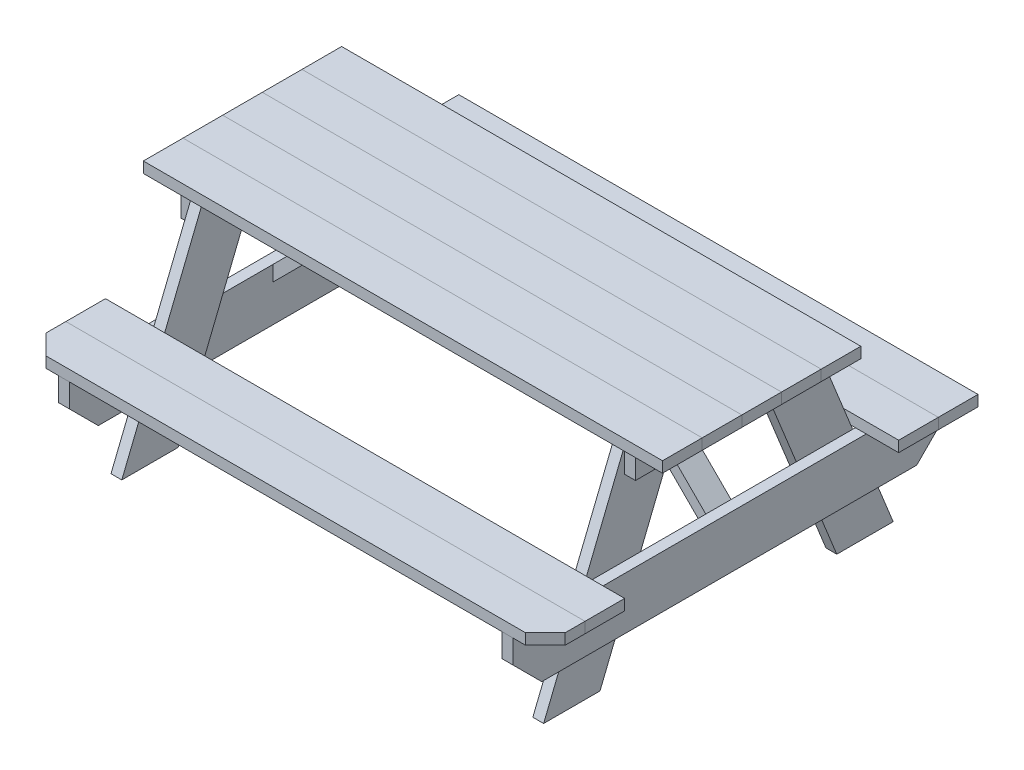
ISO-10303-21;
HEADER;
FILE_DESCRIPTION(('STEP AP214'),'2;1');
FILE_NAME('part.step','',(''),(''),'','','');
FILE_SCHEMA(('AUTOMOTIVE_DESIGN { 1 0 10303 214 1 1 1 1 }'));
ENDSEC;
DATA;
#1=APPLICATION_CONTEXT('core data for automotive mechanical design processes');
#2=APPLICATION_PROTOCOL_DEFINITION('international standard','automotive_design',2000,#1);
#3=PRODUCT_CONTEXT('',#1,'mechanical');
#4=PRODUCT('Part','Part','',(#3));
#5=PRODUCT_RELATED_PRODUCT_CATEGORY('part','',(#4));
#6=PRODUCT_DEFINITION_FORMATION('','',#4);
#7=PRODUCT_DEFINITION_CONTEXT('part definition',#1,'design');
#8=PRODUCT_DEFINITION('design','',#6,#7);
#9=PRODUCT_DEFINITION_SHAPE('','',#8);
#10=(LENGTH_UNIT() NAMED_UNIT(*) SI_UNIT(.MILLI.,.METRE.));
#11=(NAMED_UNIT(*) PLANE_ANGLE_UNIT() SI_UNIT($,.RADIAN.));
#12=(NAMED_UNIT(*) SI_UNIT($,.STERADIAN.) SOLID_ANGLE_UNIT());
#13=UNCERTAINTY_MEASURE_WITH_UNIT(LENGTH_MEASURE(1.E-05),#10,'distance_accuracy_value','');
#14=(GEOMETRIC_REPRESENTATION_CONTEXT(3) GLOBAL_UNCERTAINTY_ASSIGNED_CONTEXT((#13)) GLOBAL_UNIT_ASSIGNED_CONTEXT((#10,
#11,#12)) REPRESENTATION_CONTEXT('',''));
#15=CARTESIAN_POINT('',(0.,0.,0.));
#16=DIRECTION('',(0.,0.,1.));
#17=DIRECTION('',(1.,0.,0.));
#18=AXIS2_PLACEMENT_3D('',#15,#16,#17);
#19=CARTESIAN_POINT('',(914.400000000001,391.357048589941,-622.3));
#20=DIRECTION('',(0.,-1.,0.));
#21=DIRECTION('',(0.,0.,-1.));
#22=AXIS2_PLACEMENT_3D('',#19,#20,#21);
#23=PLANE('',#22);
#24=DIRECTION('',(0.,0.,1.));
#25=VECTOR('',#24,1.);
#26=CARTESIAN_POINT('',(-914.399999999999,391.357048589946,-622.3));
#27=LINE('',#26,#25);
#28=CARTESIAN_POINT('',(-914.399999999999,391.357048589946,-622.3));
#29=VERTEX_POINT('',#28);
#30=CARTESIAN_POINT('',(-914.399999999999,391.357048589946,-482.6));
#31=VERTEX_POINT('',#30);
#32=EDGE_CURVE('E177',#29,#31,#27,.T.);
#33=ORIENTED_EDGE('',*,*,#32,.T.);
#34=DIRECTION('',(-1.,0.,0.));
#35=VECTOR('',#34,1.);
#36=CARTESIAN_POINT('',(914.400000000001,391.357048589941,-482.6));
#37=LINE('',#36,#35);
#38=CARTESIAN_POINT('',(914.400000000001,391.357048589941,-482.6));
#39=VERTEX_POINT('',#38);
#40=EDGE_CURVE('E14',#39,#31,#37,.T.);
#41=ORIENTED_EDGE('',*,*,#40,.F.);
#42=DIRECTION('',(0.,0.,1.));
#43=VECTOR('',#42,1.);
#44=CARTESIAN_POINT('',(914.400000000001,391.357048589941,-622.3));
#45=LINE('',#44,#43);
#46=CARTESIAN_POINT('',(914.400000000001,391.357048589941,-622.3));
#47=VERTEX_POINT('',#46);
#48=EDGE_CURVE('E164',#47,#39,#45,.T.);
#49=ORIENTED_EDGE('',*,*,#48,.F.);
#50=DIRECTION('',(-1.,0.,0.));
#51=VECTOR('',#50,1.);
#52=CARTESIAN_POINT('',(914.400000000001,391.357048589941,-622.3));
#53=LINE('',#52,#51);
#54=EDGE_CURVE('E169',#47,#29,#53,.T.);
#55=ORIENTED_EDGE('',*,*,#54,.T.);
#56=EDGE_LOOP('',(#33,#41,#49,#55));
#57=FACE_BOUND('',#56,.T.);
#58=ADVANCED_FACE('F109',(#57),#23,.F.);
#59=CARTESIAN_POINT('',(914.400000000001,353.257048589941,-482.6));
#60=DIRECTION('',(0.,0.,-1.));
#61=DIRECTION('',(0.,1.,0.));
#62=AXIS2_PLACEMENT_3D('',#59,#60,#61);
#63=PLANE('',#62);
#64=DIRECTION('',(0.,-1.,0.));
#65=VECTOR('',#64,1.);
#66=CARTESIAN_POINT('',(-914.399999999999,353.257048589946,-482.6));
#67=LINE('',#66,#65);
#68=CARTESIAN_POINT('',(-914.399999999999,353.257048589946,-482.6));
#69=VERTEX_POINT('',#68);
#70=EDGE_CURVE('E168',#31,#69,#67,.T.);
#71=ORIENTED_EDGE('',*,*,#70,.T.);
#72=DIRECTION('',(-1.,0.,0.));
#73=VECTOR('',#72,1.);
#74=CARTESIAN_POINT('',(914.400000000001,353.257048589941,-482.6));
#75=LINE('',#74,#73);
#76=CARTESIAN_POINT('',(914.400000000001,353.257048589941,-482.6));
#77=VERTEX_POINT('',#76);
#78=EDGE_CURVE('E117',#77,#69,#75,.T.);
#79=ORIENTED_EDGE('',*,*,#78,.F.);
#80=DIRECTION('',(0.,-1.,0.));
#81=VECTOR('',#80,1.);
#82=CARTESIAN_POINT('',(914.400000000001,353.257048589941,-482.6));
#83=LINE('',#82,#81);
#84=EDGE_CURVE('E151',#39,#77,#83,.T.);
#85=ORIENTED_EDGE('',*,*,#84,.F.);
#86=ORIENTED_EDGE('',*,*,#40,.T.);
#87=EDGE_LOOP('',(#71,#79,#85,#86));
#88=FACE_BOUND('',#87,.T.);
#89=ADVANCED_FACE('F167',(#88),#63,.F.);
#90=CARTESIAN_POINT('',(914.400000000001,353.257048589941,-622.3));
#91=DIRECTION('',(0.,1.,0.));
#92=DIRECTION('',(0.,0.,1.));
#93=AXIS2_PLACEMENT_3D('',#90,#91,#92);
#94=PLANE('',#93);
#95=DIRECTION('',(0.,0.,-1.));
#96=VECTOR('',#95,1.);
#97=CARTESIAN_POINT('',(-914.399999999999,353.257048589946,-622.3));
#98=LINE('',#97,#96);
#99=CARTESIAN_POINT('',(-914.399999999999,353.257048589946,-622.3));
#100=VERTEX_POINT('',#99);
#101=EDGE_CURVE('E174',#69,#100,#98,.T.);
#102=ORIENTED_EDGE('',*,*,#101,.T.);
#103=DIRECTION('',(-1.,0.,0.));
#104=VECTOR('',#103,1.);
#105=CARTESIAN_POINT('',(914.400000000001,353.257048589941,-622.3));
#106=LINE('',#105,#104);
#107=CARTESIAN_POINT('',(914.400000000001,353.257048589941,-622.3));
#108=VERTEX_POINT('',#107);
#109=EDGE_CURVE('E160',#108,#100,#106,.T.);
#110=ORIENTED_EDGE('',*,*,#109,.F.);
#111=DIRECTION('',(0.,0.,-1.));
#112=VECTOR('',#111,1.);
#113=CARTESIAN_POINT('',(914.400000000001,353.257048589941,-622.3));
#114=LINE('',#113,#112);
#115=EDGE_CURVE('E156',#77,#108,#114,.T.);
#116=ORIENTED_EDGE('',*,*,#115,.F.);
#117=ORIENTED_EDGE('',*,*,#78,.T.);
#118=EDGE_LOOP('',(#102,#110,#116,#117));
#119=FACE_BOUND('',#118,.T.);
#120=ADVANCED_FACE('F158',(#119),#94,.F.);
#121=CARTESIAN_POINT('',(914.400000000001,353.257048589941,-622.3));
#122=DIRECTION('',(0.,0.,1.));
#123=DIRECTION('',(0.,-1.,0.));
#124=AXIS2_PLACEMENT_3D('',#121,#122,#123);
#125=PLANE('',#124);
#126=DIRECTION('',(0.,1.,0.));
#127=VECTOR('',#126,1.);
#128=CARTESIAN_POINT('',(-914.399999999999,353.257048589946,-622.3));
#129=LINE('',#128,#127);
#130=EDGE_CURVE('E141',#100,#29,#129,.T.);
#131=ORIENTED_EDGE('',*,*,#130,.T.);
#132=ORIENTED_EDGE('',*,*,#54,.F.);
#133=DIRECTION('',(0.,1.,0.));
#134=VECTOR('',#133,1.);
#135=CARTESIAN_POINT('',(914.400000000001,353.257048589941,-622.3));
#136=LINE('',#135,#134);
#137=EDGE_CURVE('E125',#108,#47,#136,.T.);
#138=ORIENTED_EDGE('',*,*,#137,.F.);
#139=ORIENTED_EDGE('',*,*,#109,.T.);
#140=EDGE_LOOP('',(#131,#132,#138,#139));
#141=FACE_BOUND('',#140,.T.);
#142=ADVANCED_FACE('F188',(#141),#125,.F.);
#143=CARTESIAN_POINT('',(914.4,19.0499999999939,-1314.45));
#144=DIRECTION('',(-1.,0.,0.));
#145=DIRECTION('',(0.,-1.,0.));
#146=AXIS2_PLACEMENT_3D('',#143,#144,#145);
#147=PLANE('',#146);
#148=ORIENTED_EDGE('',*,*,#48,.T.);
#149=ORIENTED_EDGE('',*,*,#84,.T.);
#150=ORIENTED_EDGE('',*,*,#115,.T.);
#151=ORIENTED_EDGE('',*,*,#137,.T.);
#152=EDGE_LOOP('',(#148,#149,#150,#151));
#153=FACE_BOUND('',#152,.T.);
#154=ADVANCED_FACE('F162',(#153),#147,.F.);
#155=CARTESIAN_POINT('',(-914.4,19.0499999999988,-1314.45));
#156=DIRECTION('',(-1.,0.,0.));
#157=DIRECTION('',(0.,-1.,0.));
#158=AXIS2_PLACEMENT_3D('',#155,#156,#157);
#159=PLANE('',#158);
#160=ORIENTED_EDGE('',*,*,#32,.F.);
#161=ORIENTED_EDGE('',*,*,#130,.F.);
#162=ORIENTED_EDGE('',*,*,#101,.F.);
#163=ORIENTED_EDGE('',*,*,#70,.F.);
#164=EDGE_LOOP('',(#160,#161,#162,#163));
#165=FACE_BOUND('',#164,.T.);
#166=ADVANCED_FACE('F182',(#165),#159,.T.);
#167=CLOSED_SHELL('',(#58,#89,#120,#142,#154,#166));
#168=MANIFOLD_SOLID_BREP('B2',#167);
#169=CARTESIAN_POINT('',(914.400000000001,391.357048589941,-622.3));
#170=DIRECTION('',(0.,-1.,0.));
#171=DIRECTION('',(0.,0.,1.));
#172=AXIS2_PLACEMENT_3D('',#169,#170,#171);
#173=PLANE('',#172);
#174=DIRECTION('',(0.,0.,-1.));
#175=VECTOR('',#174,1.);
#176=CARTESIAN_POINT('',(-914.399999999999,391.357048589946,-622.3));
#177=LINE('',#176,#175);
#178=CARTESIAN_POINT('',(-914.399999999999,391.357048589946,-622.3));
#179=VERTEX_POINT('',#178);
#180=CARTESIAN_POINT('',(-914.399999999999,391.357048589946,-762.));
#181=VERTEX_POINT('',#180);
#182=EDGE_CURVE('E329',#179,#181,#177,.T.);
#183=ORIENTED_EDGE('',*,*,#182,.F.);
#184=DIRECTION('',(-1.,0.,0.));
#185=VECTOR('',#184,1.);
#186=CARTESIAN_POINT('',(914.400000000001,391.357048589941,-622.3));
#187=LINE('',#186,#185);
#188=CARTESIAN_POINT('',(914.400000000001,391.357048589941,-622.3));
#189=VERTEX_POINT('',#188);
#190=EDGE_CURVE('E328',#189,#179,#187,.T.);
#191=ORIENTED_EDGE('',*,*,#190,.F.);
#192=DIRECTION('',(0.,0.,-1.));
#193=VECTOR('',#192,1.);
#194=CARTESIAN_POINT('',(914.400000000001,391.357048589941,-622.3));
#195=LINE('',#194,#193);
#196=CARTESIAN_POINT('',(914.400000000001,391.357048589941,-762.));
#197=VERTEX_POINT('',#196);
#198=EDGE_CURVE('E323',#189,#197,#195,.T.);
#199=ORIENTED_EDGE('',*,*,#198,.T.);
#200=DIRECTION('',(-1.,0.,0.));
#201=VECTOR('',#200,1.);
#202=CARTESIAN_POINT('',(914.400000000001,391.357048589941,-762.));
#203=LINE('',#202,#201);
#204=EDGE_CURVE('E107',#197,#181,#203,.T.);
#205=ORIENTED_EDGE('',*,*,#204,.T.);
#206=EDGE_LOOP('',(#183,#191,#199,#205));
#207=FACE_BOUND('',#206,.T.);
#208=ADVANCED_FACE('F266',(#207),#173,.F.);
#209=CARTESIAN_POINT('',(914.400000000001,353.257048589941,-762.));
#210=DIRECTION('',(0.,0.,1.));
#211=DIRECTION('',(0.,1.,0.));
#212=AXIS2_PLACEMENT_3D('',#209,#210,#211);
#213=PLANE('',#212);
#214=DIRECTION('',(0.,-1.,0.));
#215=VECTOR('',#214,1.);
#216=CARTESIAN_POINT('',(-914.399999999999,353.257048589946,-762.));
#217=LINE('',#216,#215);
#218=CARTESIAN_POINT('',(-914.399999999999,353.257048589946,-762.));
#219=VERTEX_POINT('',#218);
#220=EDGE_CURVE('E331',#181,#219,#217,.T.);
#221=ORIENTED_EDGE('',*,*,#220,.F.);
#222=ORIENTED_EDGE('',*,*,#204,.F.);
#223=DIRECTION('',(0.,-1.,0.));
#224=VECTOR('',#223,1.);
#225=CARTESIAN_POINT('',(914.400000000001,353.257048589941,-762.));
#226=LINE('',#225,#224);
#227=CARTESIAN_POINT('',(914.400000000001,353.257048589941,-762.));
#228=VERTEX_POINT('',#227);
#229=EDGE_CURVE('E307',#197,#228,#226,.T.);
#230=ORIENTED_EDGE('',*,*,#229,.T.);
#231=DIRECTION('',(-1.,0.,0.));
#232=VECTOR('',#231,1.);
#233=CARTESIAN_POINT('',(914.400000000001,353.257048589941,-762.));
#234=LINE('',#233,#232);
#235=EDGE_CURVE('E274',#228,#219,#234,.T.);
#236=ORIENTED_EDGE('',*,*,#235,.T.);
#237=EDGE_LOOP('',(#221,#222,#230,#236));
#238=FACE_BOUND('',#237,.T.);
#239=ADVANCED_FACE('F321',(#238),#213,.F.);
#240=CARTESIAN_POINT('',(914.400000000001,353.257048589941,-622.3));
#241=DIRECTION('',(0.,1.,0.));
#242=DIRECTION('',(0.,0.,-1.));
#243=AXIS2_PLACEMENT_3D('',#240,#241,#242);
#244=PLANE('',#243);
#245=DIRECTION('',(0.,0.,1.));
#246=VECTOR('',#245,1.);
#247=CARTESIAN_POINT('',(-914.399999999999,353.257048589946,-622.3));
#248=LINE('',#247,#246);
#249=CARTESIAN_POINT('',(-914.399999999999,353.257048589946,-622.3));
#250=VERTEX_POINT('',#249);
#251=EDGE_CURVE('E317',#219,#250,#248,.T.);
#252=ORIENTED_EDGE('',*,*,#251,.F.);
#253=ORIENTED_EDGE('',*,*,#235,.F.);
#254=DIRECTION('',(0.,0.,1.));
#255=VECTOR('',#254,1.);
#256=CARTESIAN_POINT('',(914.400000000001,353.257048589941,-622.3));
#257=LINE('',#256,#255);
#258=CARTESIAN_POINT('',(914.400000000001,353.257048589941,-622.3));
#259=VERTEX_POINT('',#258);
#260=EDGE_CURVE('E310',#228,#259,#257,.T.);
#261=ORIENTED_EDGE('',*,*,#260,.T.);
#262=DIRECTION('',(-1.,0.,0.));
#263=VECTOR('',#262,1.);
#264=CARTESIAN_POINT('',(914.400000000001,353.257048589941,-622.3));
#265=LINE('',#264,#263);
#266=EDGE_CURVE('E320',#259,#250,#265,.T.);
#267=ORIENTED_EDGE('',*,*,#266,.T.);
#268=EDGE_LOOP('',(#252,#253,#261,#267));
#269=FACE_BOUND('',#268,.T.);
#270=ADVANCED_FACE('F316',(#269),#244,.F.);
#271=CARTESIAN_POINT('',(914.400000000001,353.257048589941,-622.3));
#272=DIRECTION('',(0.,0.,-1.));
#273=DIRECTION('',(0.,-1.,0.));
#274=AXIS2_PLACEMENT_3D('',#271,#272,#273);
#275=PLANE('',#274);
#276=DIRECTION('',(0.,1.,0.));
#277=VECTOR('',#276,1.);
#278=CARTESIAN_POINT('',(-914.399999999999,353.257048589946,-622.3));
#279=LINE('',#278,#277);
#280=EDGE_CURVE('E296',#250,#179,#279,.T.);
#281=ORIENTED_EDGE('',*,*,#280,.F.);
#282=ORIENTED_EDGE('',*,*,#266,.F.);
#283=DIRECTION('',(0.,1.,0.));
#284=VECTOR('',#283,1.);
#285=CARTESIAN_POINT('',(914.400000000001,353.257048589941,-622.3));
#286=LINE('',#285,#284);
#287=EDGE_CURVE('E282',#259,#189,#286,.T.);
#288=ORIENTED_EDGE('',*,*,#287,.T.);
#289=ORIENTED_EDGE('',*,*,#190,.T.);
#290=EDGE_LOOP('',(#281,#282,#288,#289));
#291=FACE_BOUND('',#290,.T.);
#292=ADVANCED_FACE('F340',(#291),#275,.F.);
#293=CARTESIAN_POINT('',(914.399999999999,19.0499999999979,69.8499999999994));
#294=DIRECTION('',(-1.,0.,0.));
#295=DIRECTION('',(0.,-1.,0.));
#296=AXIS2_PLACEMENT_3D('',#293,#294,#295);
#297=PLANE('',#296);
#298=ORIENTED_EDGE('',*,*,#198,.F.);
#299=ORIENTED_EDGE('',*,*,#287,.F.);
#300=ORIENTED_EDGE('',*,*,#260,.F.);
#301=ORIENTED_EDGE('',*,*,#229,.F.);
#302=EDGE_LOOP('',(#298,#299,#300,#301));
#303=FACE_BOUND('',#302,.T.);
#304=ADVANCED_FACE('F312',(#303),#297,.F.);
#305=CARTESIAN_POINT('',(-914.400000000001,19.0500000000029,69.8499999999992));
#306=DIRECTION('',(-1.,0.,0.));
#307=DIRECTION('',(0.,-1.,0.));
#308=AXIS2_PLACEMENT_3D('',#305,#306,#307);
#309=PLANE('',#308);
#310=ORIENTED_EDGE('',*,*,#182,.T.);
#311=ORIENTED_EDGE('',*,*,#220,.T.);
#312=ORIENTED_EDGE('',*,*,#251,.T.);
#313=ORIENTED_EDGE('',*,*,#280,.T.);
#314=EDGE_LOOP('',(#310,#311,#312,#313));
#315=FACE_BOUND('',#314,.T.);
#316=ADVANCED_FACE('F336',(#315),#309,.T.);
#317=CLOSED_SHELL('',(#208,#239,#270,#292,#304,#316));
#318=MANIFOLD_SOLID_BREP('B8',#317);
#319=CARTESIAN_POINT('',(914.400000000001,391.357048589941,622.3));
#320=DIRECTION('',(0.,-1.,0.));
#321=DIRECTION('',(0.,0.,1.));
#322=AXIS2_PLACEMENT_3D('',#319,#320,#321);
#323=PLANE('',#322);
#324=DIRECTION('',(0.,0.,-1.));
#325=VECTOR('',#324,1.);
#326=CARTESIAN_POINT('',(-914.399999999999,391.357048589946,622.3));
#327=LINE('',#326,#325);
#328=CARTESIAN_POINT('',(-914.399999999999,391.357048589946,622.3));
#329=VERTEX_POINT('',#328);
#330=CARTESIAN_POINT('',(-914.399999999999,391.357048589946,482.6));
#331=VERTEX_POINT('',#330);
#332=EDGE_CURVE('E486',#329,#331,#327,.T.);
#333=ORIENTED_EDGE('',*,*,#332,.F.);
#334=DIRECTION('',(-1.,0.,0.));
#335=VECTOR('',#334,1.);
#336=CARTESIAN_POINT('',(914.400000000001,391.357048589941,622.3));
#337=LINE('',#336,#335);
#338=CARTESIAN_POINT('',(914.400000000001,391.357048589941,622.3));
#339=VERTEX_POINT('',#338);
#340=EDGE_CURVE('E485',#339,#329,#337,.T.);
#341=ORIENTED_EDGE('',*,*,#340,.F.);
#342=DIRECTION('',(0.,0.,-1.));
#343=VECTOR('',#342,1.);
#344=CARTESIAN_POINT('',(914.400000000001,391.357048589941,622.3));
#345=LINE('',#344,#343);
#346=CARTESIAN_POINT('',(914.400000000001,391.357048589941,482.6));
#347=VERTEX_POINT('',#346);
#348=EDGE_CURVE('E480',#339,#347,#345,.T.);
#349=ORIENTED_EDGE('',*,*,#348,.T.);
#350=DIRECTION('',(-1.,0.,0.));
#351=VECTOR('',#350,1.);
#352=CARTESIAN_POINT('',(914.400000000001,391.357048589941,482.6));
#353=LINE('',#352,#351);
#354=EDGE_CURVE('E264',#347,#331,#353,.T.);
#355=ORIENTED_EDGE('',*,*,#354,.T.);
#356=EDGE_LOOP('',(#333,#341,#349,#355));
#357=FACE_BOUND('',#356,.T.);
#358=ADVANCED_FACE('F423',(#357),#323,.F.);
#359=CARTESIAN_POINT('',(914.400000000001,353.257048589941,482.6));
#360=DIRECTION('',(0.,0.,1.));
#361=DIRECTION('',(0.,1.,0.));
#362=AXIS2_PLACEMENT_3D('',#359,#360,#361);
#363=PLANE('',#362);
#364=DIRECTION('',(0.,-1.,0.));
#365=VECTOR('',#364,1.);
#366=CARTESIAN_POINT('',(-914.399999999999,353.257048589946,482.6));
#367=LINE('',#366,#365);
#368=CARTESIAN_POINT('',(-914.399999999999,353.257048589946,482.6));
#369=VERTEX_POINT('',#368);
#370=EDGE_CURVE('E488',#331,#369,#367,.T.);
#371=ORIENTED_EDGE('',*,*,#370,.F.);
#372=ORIENTED_EDGE('',*,*,#354,.F.);
#373=DIRECTION('',(0.,-1.,0.));
#374=VECTOR('',#373,1.);
#375=CARTESIAN_POINT('',(914.400000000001,353.257048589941,482.6));
#376=LINE('',#375,#374);
#377=CARTESIAN_POINT('',(914.400000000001,353.257048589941,482.6));
#378=VERTEX_POINT('',#377);
#379=EDGE_CURVE('E464',#347,#378,#376,.T.);
#380=ORIENTED_EDGE('',*,*,#379,.T.);
#381=DIRECTION('',(-1.,0.,0.));
#382=VECTOR('',#381,1.);
#383=CARTESIAN_POINT('',(914.400000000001,353.257048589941,482.6));
#384=LINE('',#383,#382);
#385=EDGE_CURVE('E431',#378,#369,#384,.T.);
#386=ORIENTED_EDGE('',*,*,#385,.T.);
#387=EDGE_LOOP('',(#371,#372,#380,#386));
#388=FACE_BOUND('',#387,.T.);
#389=ADVANCED_FACE('F478',(#388),#363,.F.);
#390=CARTESIAN_POINT('',(914.400000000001,353.257048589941,622.3));
#391=DIRECTION('',(0.,1.,0.));
#392=DIRECTION('',(0.,0.,-1.));
#393=AXIS2_PLACEMENT_3D('',#390,#391,#392);
#394=PLANE('',#393);
#395=DIRECTION('',(0.,0.,1.));
#396=VECTOR('',#395,1.);
#397=CARTESIAN_POINT('',(-914.399999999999,353.257048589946,622.3));
#398=LINE('',#397,#396);
#399=CARTESIAN_POINT('',(-914.399999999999,353.257048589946,622.3));
#400=VERTEX_POINT('',#399);
#401=EDGE_CURVE('E474',#369,#400,#398,.T.);
#402=ORIENTED_EDGE('',*,*,#401,.F.);
#403=ORIENTED_EDGE('',*,*,#385,.F.);
#404=DIRECTION('',(0.,0.,1.));
#405=VECTOR('',#404,1.);
#406=CARTESIAN_POINT('',(914.400000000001,353.257048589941,622.3));
#407=LINE('',#406,#405);
#408=CARTESIAN_POINT('',(914.400000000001,353.257048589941,622.3));
#409=VERTEX_POINT('',#408);
#410=EDGE_CURVE('E467',#378,#409,#407,.T.);
#411=ORIENTED_EDGE('',*,*,#410,.T.);
#412=DIRECTION('',(-1.,0.,0.));
#413=VECTOR('',#412,1.);
#414=CARTESIAN_POINT('',(914.400000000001,353.257048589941,622.3));
#415=LINE('',#414,#413);
#416=EDGE_CURVE('E477',#409,#400,#415,.T.);
#417=ORIENTED_EDGE('',*,*,#416,.T.);
#418=EDGE_LOOP('',(#402,#403,#411,#417));
#419=FACE_BOUND('',#418,.T.);
#420=ADVANCED_FACE('F473',(#419),#394,.F.);
#421=CARTESIAN_POINT('',(914.400000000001,353.257048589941,622.3));
#422=DIRECTION('',(0.,0.,-1.));
#423=DIRECTION('',(0.,-1.,0.));
#424=AXIS2_PLACEMENT_3D('',#421,#422,#423);
#425=PLANE('',#424);
#426=DIRECTION('',(0.,1.,0.));
#427=VECTOR('',#426,1.);
#428=CARTESIAN_POINT('',(-914.399999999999,353.257048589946,622.3));
#429=LINE('',#428,#427);
#430=EDGE_CURVE('E453',#400,#329,#429,.T.);
#431=ORIENTED_EDGE('',*,*,#430,.F.);
#432=ORIENTED_EDGE('',*,*,#416,.F.);
#433=DIRECTION('',(0.,1.,0.));
#434=VECTOR('',#433,1.);
#435=CARTESIAN_POINT('',(914.400000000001,353.257048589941,622.3));
#436=LINE('',#435,#434);
#437=EDGE_CURVE('E439',#409,#339,#436,.T.);
#438=ORIENTED_EDGE('',*,*,#437,.T.);
#439=ORIENTED_EDGE('',*,*,#340,.T.);
#440=EDGE_LOOP('',(#431,#432,#438,#439));
#441=FACE_BOUND('',#440,.T.);
#442=ADVANCED_FACE('F497',(#441),#425,.F.);
#443=CARTESIAN_POINT('',(914.4,19.0499999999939,1314.45));
#444=DIRECTION('',(-1.,0.,0.));
#445=DIRECTION('',(0.,-1.,0.));
#446=AXIS2_PLACEMENT_3D('',#443,#444,#445);
#447=PLANE('',#446);
#448=ORIENTED_EDGE('',*,*,#348,.F.);
#449=ORIENTED_EDGE('',*,*,#437,.F.);
#450=ORIENTED_EDGE('',*,*,#410,.F.);
#451=ORIENTED_EDGE('',*,*,#379,.F.);
#452=EDGE_LOOP('',(#448,#449,#450,#451));
#453=FACE_BOUND('',#452,.T.);
#454=ADVANCED_FACE('F469',(#453),#447,.F.);
#455=CARTESIAN_POINT('',(-914.4,19.0499999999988,1314.45));
#456=DIRECTION('',(-1.,0.,0.));
#457=DIRECTION('',(0.,-1.,0.));
#458=AXIS2_PLACEMENT_3D('',#455,#456,#457);
#459=PLANE('',#458);
#460=ORIENTED_EDGE('',*,*,#332,.T.);
#461=ORIENTED_EDGE('',*,*,#370,.T.);
#462=ORIENTED_EDGE('',*,*,#401,.T.);
#463=ORIENTED_EDGE('',*,*,#430,.T.);
#464=EDGE_LOOP('',(#460,#461,#462,#463));
#465=FACE_BOUND('',#464,.T.);
#466=ADVANCED_FACE('F493',(#465),#459,.T.);
#467=CLOSED_SHELL('',(#358,#389,#420,#442,#454,#466));
#468=MANIFOLD_SOLID_BREP('B101',#467);
#469=CARTESIAN_POINT('',(914.400000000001,391.357048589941,622.3));
#470=DIRECTION('',(0.,-1.,0.));
#471=DIRECTION('',(0.,0.,-1.));
#472=AXIS2_PLACEMENT_3D('',#469,#470,#471);
#473=PLANE('',#472);
#474=DIRECTION('',(0.,0.,1.));
#475=VECTOR('',#474,1.);
#476=CARTESIAN_POINT('',(-914.399999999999,391.357048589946,622.3));
#477=LINE('',#476,#475);
#478=CARTESIAN_POINT('',(-914.399999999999,391.357048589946,622.3));
#479=VERTEX_POINT('',#478);
#480=CARTESIAN_POINT('',(-914.399999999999,391.357048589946,692.15));
#481=VERTEX_POINT('',#480);
#482=EDGE_CURVE('E663',#479,#481,#477,.T.);
#483=ORIENTED_EDGE('',*,*,#482,.T.);
#484=DIRECTION('',(0.707106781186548,0.,0.707106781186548));
#485=VECTOR('',#484,1.);
#486=CARTESIAN_POINT('',(-844.549999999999,391.357048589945,762.));
#487=LINE('',#486,#485);
#488=CARTESIAN_POINT('',(-844.549999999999,391.357048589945,762.));
#489=VERTEX_POINT('',#488);
#490=EDGE_CURVE('E589',#481,#489,#487,.T.);
#491=ORIENTED_EDGE('',*,*,#490,.T.);
#492=DIRECTION('',(-1.,0.,0.));
#493=VECTOR('',#492,1.);
#494=CARTESIAN_POINT('',(914.400000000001,391.357048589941,762.));
#495=LINE('',#494,#493);
#496=CARTESIAN_POINT('',(844.550000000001,391.357048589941,762.));
#497=VERTEX_POINT('',#496);
#498=EDGE_CURVE('E669',#497,#489,#495,.T.);
#499=ORIENTED_EDGE('',*,*,#498,.F.);
#500=DIRECTION('',(-0.707106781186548,0.,0.707106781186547));
#501=VECTOR('',#500,1.);
#502=CARTESIAN_POINT('',(914.400000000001,391.357048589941,692.15));
#503=LINE('',#502,#501);
#504=CARTESIAN_POINT('',(914.400000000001,391.357048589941,692.15));
#505=VERTEX_POINT('',#504);
#506=EDGE_CURVE('E596',#497,#505,#503,.F.);
#507=ORIENTED_EDGE('',*,*,#506,.T.);
#508=DIRECTION('',(0.,0.,1.));
#509=VECTOR('',#508,1.);
#510=CARTESIAN_POINT('',(914.400000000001,391.357048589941,622.3));
#511=LINE('',#510,#509);
#512=CARTESIAN_POINT('',(914.400000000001,391.357048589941,622.3));
#513=VERTEX_POINT('',#512);
#514=EDGE_CURVE('E645',#513,#505,#511,.T.);
#515=ORIENTED_EDGE('',*,*,#514,.F.);
#516=DIRECTION('',(-1.,0.,0.));
#517=VECTOR('',#516,1.);
#518=CARTESIAN_POINT('',(914.400000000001,391.357048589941,622.3));
#519=LINE('',#518,#517);
#520=EDGE_CURVE('E655',#513,#479,#519,.T.);
#521=ORIENTED_EDGE('',*,*,#520,.T.);
#522=EDGE_LOOP('',(#483,#491,#499,#507,#515,#521));
#523=FACE_BOUND('',#522,.T.);
#524=ADVANCED_FACE('F580',(#523),#473,.F.);
#525=CARTESIAN_POINT('',(914.400000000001,353.257048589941,762.));
#526=DIRECTION('',(0.,0.,-1.));
#527=DIRECTION('',(0.,1.,0.));
#528=AXIS2_PLACEMENT_3D('',#525,#526,#527);
#529=PLANE('',#528);
#530=ORIENTED_EDGE('',*,*,#498,.T.);
#531=DIRECTION('',(0.,-1.,0.));
#532=VECTOR('',#531,1.);
#533=CARTESIAN_POINT('',(-844.549999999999,353.257048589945,762.));
#534=LINE('',#533,#532);
#535=CARTESIAN_POINT('',(-844.549999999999,353.257048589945,762.));
#536=VERTEX_POINT('',#535);
#537=EDGE_CURVE('E674',#489,#536,#534,.T.);
#538=ORIENTED_EDGE('',*,*,#537,.T.);
#539=DIRECTION('',(-1.,0.,0.));
#540=VECTOR('',#539,1.);
#541=CARTESIAN_POINT('',(914.400000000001,353.257048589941,762.));
#542=LINE('',#541,#540);
#543=CARTESIAN_POINT('',(844.550000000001,353.257048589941,762.));
#544=VERTEX_POINT('',#543);
#545=EDGE_CURVE('E654',#544,#536,#542,.T.);
#546=ORIENTED_EDGE('',*,*,#545,.F.);
#547=DIRECTION('',(0.,1.,0.));
#548=VECTOR('',#547,1.);
#549=CARTESIAN_POINT('',(844.550000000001,353.257048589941,762.));
#550=LINE('',#549,#548);
#551=EDGE_CURVE('E672',#544,#497,#550,.T.);
#552=ORIENTED_EDGE('',*,*,#551,.T.);
#553=EDGE_LOOP('',(#530,#538,#546,#552));
#554=FACE_BOUND('',#553,.T.);
#555=ADVANCED_FACE('F686',(#554),#529,.F.);
#556=CARTESIAN_POINT('',(914.400000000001,353.257048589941,622.3));
#557=DIRECTION('',(0.,1.,0.));
#558=DIRECTION('',(0.,0.,1.));
#559=AXIS2_PLACEMENT_3D('',#556,#557,#558);
#560=PLANE('',#559);
#561=ORIENTED_EDGE('',*,*,#545,.T.);
#562=DIRECTION('',(-0.707106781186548,0.,-0.707106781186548));
#563=VECTOR('',#562,1.);
#564=CARTESIAN_POINT('',(-844.549999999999,353.257048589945,762.));
#565=LINE('',#564,#563);
#566=CARTESIAN_POINT('',(-914.399999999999,353.257048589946,692.15));
#567=VERTEX_POINT('',#566);
#568=EDGE_CURVE('E679',#536,#567,#565,.T.);
#569=ORIENTED_EDGE('',*,*,#568,.T.);
#570=DIRECTION('',(0.,0.,-1.));
#571=VECTOR('',#570,1.);
#572=CARTESIAN_POINT('',(-914.399999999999,353.257048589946,622.3));
#573=LINE('',#572,#571);
#574=CARTESIAN_POINT('',(-914.399999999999,353.257048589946,622.3));
#575=VERTEX_POINT('',#574);
#576=EDGE_CURVE('E651',#567,#575,#573,.T.);
#577=ORIENTED_EDGE('',*,*,#576,.T.);
#578=DIRECTION('',(-1.,0.,0.));
#579=VECTOR('',#578,1.);
#580=CARTESIAN_POINT('',(914.400000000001,353.257048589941,622.3));
#581=LINE('',#580,#579);
#582=CARTESIAN_POINT('',(914.400000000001,353.257048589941,622.3));
#583=VERTEX_POINT('',#582);
#584=EDGE_CURVE('E648',#583,#575,#581,.T.);
#585=ORIENTED_EDGE('',*,*,#584,.F.);
#586=DIRECTION('',(0.,0.,-1.));
#587=VECTOR('',#586,1.);
#588=CARTESIAN_POINT('',(914.400000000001,353.257048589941,622.3));
#589=LINE('',#588,#587);
#590=CARTESIAN_POINT('',(914.400000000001,353.257048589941,692.15));
#591=VERTEX_POINT('',#590);
#592=EDGE_CURVE('E637',#591,#583,#589,.T.);
#593=ORIENTED_EDGE('',*,*,#592,.F.);
#594=DIRECTION('',(0.707106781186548,0.,-0.707106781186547));
#595=VECTOR('',#594,1.);
#596=CARTESIAN_POINT('',(914.400000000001,353.257048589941,692.15));
#597=LINE('',#596,#595);
#598=EDGE_CURVE('E677',#591,#544,#597,.F.);
#599=ORIENTED_EDGE('',*,*,#598,.T.);
#600=EDGE_LOOP('',(#561,#569,#577,#585,#593,#599));
#601=FACE_BOUND('',#600,.T.);
#602=ADVANCED_FACE('F650',(#601),#560,.F.);
#603=CARTESIAN_POINT('',(914.400000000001,353.257048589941,622.3));
#604=DIRECTION('',(0.,0.,1.));
#605=DIRECTION('',(0.,-1.,0.));
#606=AXIS2_PLACEMENT_3D('',#603,#604,#605);
#607=PLANE('',#606);
#608=DIRECTION('',(0.,1.,0.));
#609=VECTOR('',#608,1.);
#610=CARTESIAN_POINT('',(-914.399999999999,353.257048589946,622.3));
#611=LINE('',#610,#609);
#612=EDGE_CURVE('E666',#575,#479,#611,.T.);
#613=ORIENTED_EDGE('',*,*,#612,.T.);
#614=ORIENTED_EDGE('',*,*,#520,.F.);
#615=DIRECTION('',(0.,1.,0.));
#616=VECTOR('',#615,1.);
#617=CARTESIAN_POINT('',(914.400000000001,353.257048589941,622.3));
#618=LINE('',#617,#616);
#619=EDGE_CURVE('E641',#583,#513,#618,.T.);
#620=ORIENTED_EDGE('',*,*,#619,.F.);
#621=ORIENTED_EDGE('',*,*,#584,.T.);
#622=EDGE_LOOP('',(#613,#614,#620,#621));
#623=FACE_BOUND('',#622,.T.);
#624=ADVANCED_FACE('F657',(#623),#607,.F.);
#625=CARTESIAN_POINT('',(914.399999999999,19.0499999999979,-69.8499999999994));
#626=DIRECTION('',(-1.,0.,0.));
#627=DIRECTION('',(0.,-1.,0.));
#628=AXIS2_PLACEMENT_3D('',#625,#626,#627);
#629=PLANE('',#628);
#630=ORIENTED_EDGE('',*,*,#514,.T.);
#631=DIRECTION('',(0.,-1.,0.));
#632=VECTOR('',#631,1.);
#633=CARTESIAN_POINT('',(914.4,19.0499999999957,692.149999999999));
#634=LINE('',#633,#632);
#635=EDGE_CURVE('E421',#505,#591,#634,.T.);
#636=ORIENTED_EDGE('',*,*,#635,.T.);
#637=ORIENTED_EDGE('',*,*,#592,.T.);
#638=ORIENTED_EDGE('',*,*,#619,.T.);
#639=EDGE_LOOP('',(#630,#636,#637,#638));
#640=FACE_BOUND('',#639,.T.);
#641=ADVANCED_FACE('F639',(#640),#629,.F.);
#642=CARTESIAN_POINT('',(-914.400000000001,19.0500000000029,-69.8499999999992));
#643=DIRECTION('',(-1.,0.,0.));
#644=DIRECTION('',(0.,-1.,0.));
#645=AXIS2_PLACEMENT_3D('',#642,#643,#644);
#646=PLANE('',#645);
#647=ORIENTED_EDGE('',*,*,#576,.F.);
#648=DIRECTION('',(0.,1.,0.));
#649=VECTOR('',#648,1.);
#650=CARTESIAN_POINT('',(-914.399999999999,391.357048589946,692.15));
#651=LINE('',#650,#649);
#652=EDGE_CURVE('E604',#567,#481,#651,.T.);
#653=ORIENTED_EDGE('',*,*,#652,.T.);
#654=ORIENTED_EDGE('',*,*,#482,.F.);
#655=ORIENTED_EDGE('',*,*,#612,.F.);
#656=EDGE_LOOP('',(#647,#653,#654,#655));
#657=FACE_BOUND('',#656,.T.);
#658=ADVANCED_FACE('F690',(#657),#646,.T.);
#659=CARTESIAN_POINT('',(-844.549999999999,353.257048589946,762.));
#660=DIRECTION('',(-0.707106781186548,0.,0.707106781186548));
#661=DIRECTION('',(0.,1.,0.));
#662=AXIS2_PLACEMENT_3D('',#659,#660,#661);
#663=PLANE('',#662);
#664=ORIENTED_EDGE('',*,*,#490,.F.);
#665=ORIENTED_EDGE('',*,*,#652,.F.);
#666=ORIENTED_EDGE('',*,*,#568,.F.);
#667=ORIENTED_EDGE('',*,*,#537,.F.);
#668=EDGE_LOOP('',(#664,#665,#666,#667));
#669=FACE_BOUND('',#668,.T.);
#670=ADVANCED_FACE('F689',(#669),#663,.T.);
#671=CARTESIAN_POINT('',(914.4,19.0499999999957,692.149999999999));
#672=DIRECTION('',(-0.707106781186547,0.,-0.707106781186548));
#673=DIRECTION('',(0.,-1.,0.));
#674=AXIS2_PLACEMENT_3D('',#671,#672,#673);
#675=PLANE('',#674);
#676=ORIENTED_EDGE('',*,*,#506,.F.);
#677=ORIENTED_EDGE('',*,*,#551,.F.);
#678=ORIENTED_EDGE('',*,*,#598,.F.);
#679=ORIENTED_EDGE('',*,*,#635,.F.);
#680=EDGE_LOOP('',(#676,#677,#678,#679));
#681=FACE_BOUND('',#680,.T.);
#682=ADVANCED_FACE('F583',(#681),#675,.F.);
#683=CLOSED_SHELL('',(#524,#555,#602,#624,#641,#658,#670,#682));
#684=MANIFOLD_SOLID_BREP('B258',#683);
#685=CARTESIAN_POINT('',(914.4,744.614097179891,209.55));
#686=DIRECTION('',(0.,-1.,0.));
#687=DIRECTION('',(0.,0.,-1.));
#688=AXIS2_PLACEMENT_3D('',#685,#686,#687);
#689=PLANE('',#688);
#690=DIRECTION('',(0.,0.,1.));
#691=VECTOR('',#690,1.);
#692=CARTESIAN_POINT('',(-914.4,744.614097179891,209.55));
#693=LINE('',#692,#691);
#694=CARTESIAN_POINT('',(-914.4,744.614097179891,209.55));
#695=VERTEX_POINT('',#694);
#696=CARTESIAN_POINT('',(-914.4,744.614097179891,349.25));
#697=VERTEX_POINT('',#696);
#698=EDGE_CURVE('E862',#695,#697,#693,.T.);
#699=ORIENTED_EDGE('',*,*,#698,.T.);
#700=DIRECTION('',(-1.,0.,0.));
#701=VECTOR('',#700,1.);
#702=CARTESIAN_POINT('',(914.4,744.614097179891,349.25));
#703=LINE('',#702,#701);
#704=CARTESIAN_POINT('',(914.4,744.614097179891,349.25));
#705=VERTEX_POINT('',#704);
#706=EDGE_CURVE('E578',#705,#697,#703,.T.);
#707=ORIENTED_EDGE('',*,*,#706,.F.);
#708=DIRECTION('',(0.,0.,1.));
#709=VECTOR('',#708,1.);
#710=CARTESIAN_POINT('',(914.4,744.614097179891,209.55));
#711=LINE('',#710,#709);
#712=CARTESIAN_POINT('',(914.4,744.614097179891,209.55));
#713=VERTEX_POINT('',#712);
#714=EDGE_CURVE('E850',#713,#705,#711,.T.);
#715=ORIENTED_EDGE('',*,*,#714,.F.);
#716=DIRECTION('',(-1.,0.,0.));
#717=VECTOR('',#716,1.);
#718=CARTESIAN_POINT('',(914.4,744.614097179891,209.55));
#719=LINE('',#718,#717);
#720=EDGE_CURVE('E858',#713,#695,#719,.T.);
#721=ORIENTED_EDGE('',*,*,#720,.T.);
#722=EDGE_LOOP('',(#699,#707,#715,#721));
#723=FACE_BOUND('',#722,.T.);
#724=ADVANCED_FACE('F799',(#723),#689,.F.);
#725=CARTESIAN_POINT('',(914.4,706.514097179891,349.25));
#726=DIRECTION('',(0.,0.,-1.));
#727=DIRECTION('',(-1.,0.,0.));
#728=AXIS2_PLACEMENT_3D('',#725,#726,#727);
#729=PLANE('',#728);
#730=DIRECTION('',(0.,-1.,0.));
#731=VECTOR('',#730,1.);
#732=CARTESIAN_POINT('',(-914.4,706.514097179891,349.25));
#733=LINE('',#732,#731);
#734=CARTESIAN_POINT('',(-914.4,706.514097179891,349.25));
#735=VERTEX_POINT('',#734);
#736=EDGE_CURVE('E854',#697,#735,#733,.T.);
#737=ORIENTED_EDGE('',*,*,#736,.T.);
#738=DIRECTION('',(-1.,0.,0.));
#739=VECTOR('',#738,1.);
#740=CARTESIAN_POINT('',(914.4,706.514097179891,349.25));
#741=LINE('',#740,#739);
#742=CARTESIAN_POINT('',(914.4,706.514097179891,349.25));
#743=VERTEX_POINT('',#742);
#744=EDGE_CURVE('E807',#743,#735,#741,.T.);
#745=ORIENTED_EDGE('',*,*,#744,.F.);
#746=DIRECTION('',(0.,-1.,0.));
#747=VECTOR('',#746,1.);
#748=CARTESIAN_POINT('',(914.4,706.514097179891,349.25));
#749=LINE('',#748,#747);
#750=EDGE_CURVE('E845',#705,#743,#749,.T.);
#751=ORIENTED_EDGE('',*,*,#750,.F.);
#752=ORIENTED_EDGE('',*,*,#706,.T.);
#753=EDGE_LOOP('',(#737,#745,#751,#752));
#754=FACE_BOUND('',#753,.T.);
#755=ADVANCED_FACE('F853',(#754),#729,.F.);
#756=CARTESIAN_POINT('',(914.4,706.514097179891,209.55));
#757=DIRECTION('',(0.,1.,0.));
#758=DIRECTION('',(0.,0.,1.));
#759=AXIS2_PLACEMENT_3D('',#756,#757,#758);
#760=PLANE('',#759);
#761=DIRECTION('',(0.,0.,-1.));
#762=VECTOR('',#761,1.);
#763=CARTESIAN_POINT('',(-914.4,706.514097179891,209.55));
#764=LINE('',#763,#762);
#765=CARTESIAN_POINT('',(-914.4,706.514097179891,209.55));
#766=VERTEX_POINT('',#765);
#767=EDGE_CURVE('E832',#735,#766,#764,.T.);
#768=ORIENTED_EDGE('',*,*,#767,.T.);
#769=DIRECTION('',(-1.,0.,0.));
#770=VECTOR('',#769,1.);
#771=CARTESIAN_POINT('',(914.4,706.514097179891,209.55));
#772=LINE('',#771,#770);
#773=CARTESIAN_POINT('',(914.4,706.514097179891,209.55));
#774=VERTEX_POINT('',#773);
#775=EDGE_CURVE('E855',#774,#766,#772,.T.);
#776=ORIENTED_EDGE('',*,*,#775,.F.);
#777=DIRECTION('',(0.,0.,-1.));
#778=VECTOR('',#777,1.);
#779=CARTESIAN_POINT('',(914.4,706.514097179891,209.55));
#780=LINE('',#779,#778);
#781=EDGE_CURVE('E848',#743,#774,#780,.T.);
#782=ORIENTED_EDGE('',*,*,#781,.F.);
#783=ORIENTED_EDGE('',*,*,#744,.T.);
#784=EDGE_LOOP('',(#768,#776,#782,#783));
#785=FACE_BOUND('',#784,.T.);
#786=ADVANCED_FACE('F856',(#785),#760,.F.);
#787=CARTESIAN_POINT('',(914.4,706.514097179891,209.55));
#788=DIRECTION('',(0.,0.,1.));
#789=DIRECTION('',(1.,0.,0.));
#790=AXIS2_PLACEMENT_3D('',#787,#788,#789);
#791=PLANE('',#790);
#792=DIRECTION('',(0.,1.,0.));
#793=VECTOR('',#792,1.);
#794=CARTESIAN_POINT('',(-914.4,706.514097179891,209.55));
#795=LINE('',#794,#793);
#796=EDGE_CURVE('E838',#766,#695,#795,.T.);
#797=ORIENTED_EDGE('',*,*,#796,.T.);
#798=ORIENTED_EDGE('',*,*,#720,.F.);
#799=DIRECTION('',(0.,1.,0.));
#800=VECTOR('',#799,1.);
#801=CARTESIAN_POINT('',(914.4,706.514097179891,209.55));
#802=LINE('',#801,#800);
#803=EDGE_CURVE('E815',#774,#713,#802,.T.);
#804=ORIENTED_EDGE('',*,*,#803,.F.);
#805=ORIENTED_EDGE('',*,*,#775,.T.);
#806=EDGE_LOOP('',(#797,#798,#804,#805));
#807=FACE_BOUND('',#806,.T.);
#808=ADVANCED_FACE('F869',(#807),#791,.F.);
#809=CARTESIAN_POINT('',(914.4,19.05,279.4));
#810=DIRECTION('',(-1.,0.,0.));
#811=DIRECTION('',(0.,0.,1.));
#812=AXIS2_PLACEMENT_3D('',#809,#810,#811);
#813=PLANE('',#812);
#814=ORIENTED_EDGE('',*,*,#714,.T.);
#815=ORIENTED_EDGE('',*,*,#750,.T.);
#816=ORIENTED_EDGE('',*,*,#781,.T.);
#817=ORIENTED_EDGE('',*,*,#803,.T.);
#818=EDGE_LOOP('',(#814,#815,#816,#817));
#819=FACE_BOUND('',#818,.T.);
#820=ADVANCED_FACE('F846',(#819),#813,.F.);
#821=CARTESIAN_POINT('',(-914.4,19.05,279.4));
#822=DIRECTION('',(-1.,0.,0.));
#823=DIRECTION('',(0.,0.,1.));
#824=AXIS2_PLACEMENT_3D('',#821,#822,#823);
#825=PLANE('',#824);
#826=ORIENTED_EDGE('',*,*,#698,.F.);
#827=ORIENTED_EDGE('',*,*,#796,.F.);
#828=ORIENTED_EDGE('',*,*,#767,.F.);
#829=ORIENTED_EDGE('',*,*,#736,.F.);
#830=EDGE_LOOP('',(#826,#827,#828,#829));
#831=FACE_BOUND('',#830,.T.);
#832=ADVANCED_FACE('F872',(#831),#825,.T.);
#833=CLOSED_SHELL('',(#724,#755,#786,#808,#820,#832));
#834=MANIFOLD_SOLID_BREP('B415',#833);
#835=CARTESIAN_POINT('',(914.4,744.614097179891,69.85));
#836=DIRECTION('',(0.,-1.,0.));
#837=DIRECTION('',(0.,0.,-1.));
#838=AXIS2_PLACEMENT_3D('',#835,#836,#837);
#839=PLANE('',#838);
#840=DIRECTION('',(0.,0.,1.));
#841=VECTOR('',#840,1.);
#842=CARTESIAN_POINT('',(-914.4,744.614097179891,69.85));
#843=LINE('',#842,#841);
#844=CARTESIAN_POINT('',(-914.4,744.614097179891,69.85));
#845=VERTEX_POINT('',#844);
#846=CARTESIAN_POINT('',(-914.4,744.614097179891,209.55));
#847=VERTEX_POINT('',#846);
#848=EDGE_CURVE('E1019',#845,#847,#843,.T.);
#849=ORIENTED_EDGE('',*,*,#848,.T.);
#850=DIRECTION('',(-1.,0.,0.));
#851=VECTOR('',#850,1.);
#852=CARTESIAN_POINT('',(914.4,744.614097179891,209.55));
#853=LINE('',#852,#851);
#854=CARTESIAN_POINT('',(914.4,744.614097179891,209.55));
#855=VERTEX_POINT('',#854);
#856=EDGE_CURVE('E797',#855,#847,#853,.T.);
#857=ORIENTED_EDGE('',*,*,#856,.F.);
#858=DIRECTION('',(0.,0.,1.));
#859=VECTOR('',#858,1.);
#860=CARTESIAN_POINT('',(914.4,744.614097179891,69.85));
#861=LINE('',#860,#859);
#862=CARTESIAN_POINT('',(914.4,744.614097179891,69.85));
#863=VERTEX_POINT('',#862);
#864=EDGE_CURVE('E1007',#863,#855,#861,.T.);
#865=ORIENTED_EDGE('',*,*,#864,.F.);
#866=DIRECTION('',(-1.,0.,0.));
#867=VECTOR('',#866,1.);
#868=CARTESIAN_POINT('',(914.4,744.614097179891,69.85));
#869=LINE('',#868,#867);
#870=EDGE_CURVE('E1015',#863,#845,#869,.T.);
#871=ORIENTED_EDGE('',*,*,#870,.T.);
#872=EDGE_LOOP('',(#849,#857,#865,#871));
#873=FACE_BOUND('',#872,.T.);
#874=ADVANCED_FACE('F956',(#873),#839,.F.);
#875=CARTESIAN_POINT('',(914.4,706.514097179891,209.55));
#876=DIRECTION('',(0.,0.,-1.));
#877=DIRECTION('',(-1.,0.,0.));
#878=AXIS2_PLACEMENT_3D('',#875,#876,#877);
#879=PLANE('',#878);
#880=DIRECTION('',(0.,-1.,0.));
#881=VECTOR('',#880,1.);
#882=CARTESIAN_POINT('',(-914.4,706.514097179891,209.55));
#883=LINE('',#882,#881);
#884=CARTESIAN_POINT('',(-914.4,706.514097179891,209.55));
#885=VERTEX_POINT('',#884);
#886=EDGE_CURVE('E1011',#847,#885,#883,.T.);
#887=ORIENTED_EDGE('',*,*,#886,.T.);
#888=DIRECTION('',(-1.,0.,0.));
#889=VECTOR('',#888,1.);
#890=CARTESIAN_POINT('',(914.4,706.514097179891,209.55));
#891=LINE('',#890,#889);
#892=CARTESIAN_POINT('',(914.4,706.514097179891,209.55));
#893=VERTEX_POINT('',#892);
#894=EDGE_CURVE('E964',#893,#885,#891,.T.);
#895=ORIENTED_EDGE('',*,*,#894,.F.);
#896=DIRECTION('',(0.,-1.,0.));
#897=VECTOR('',#896,1.);
#898=CARTESIAN_POINT('',(914.4,706.514097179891,209.55));
#899=LINE('',#898,#897);
#900=EDGE_CURVE('E1002',#855,#893,#899,.T.);
#901=ORIENTED_EDGE('',*,*,#900,.F.);
#902=ORIENTED_EDGE('',*,*,#856,.T.);
#903=EDGE_LOOP('',(#887,#895,#901,#902));
#904=FACE_BOUND('',#903,.T.);
#905=ADVANCED_FACE('F1010',(#904),#879,.F.);
#906=CARTESIAN_POINT('',(914.4,706.514097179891,69.85));
#907=DIRECTION('',(0.,1.,0.));
#908=DIRECTION('',(0.,0.,1.));
#909=AXIS2_PLACEMENT_3D('',#906,#907,#908);
#910=PLANE('',#909);
#911=DIRECTION('',(0.,0.,-1.));
#912=VECTOR('',#911,1.);
#913=CARTESIAN_POINT('',(-914.4,706.514097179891,69.85));
#914=LINE('',#913,#912);
#915=CARTESIAN_POINT('',(-914.4,706.514097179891,69.85));
#916=VERTEX_POINT('',#915);
#917=EDGE_CURVE('E989',#885,#916,#914,.T.);
#918=ORIENTED_EDGE('',*,*,#917,.T.);
#919=DIRECTION('',(-1.,0.,0.));
#920=VECTOR('',#919,1.);
#921=CARTESIAN_POINT('',(914.4,706.514097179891,69.85));
#922=LINE('',#921,#920);
#923=CARTESIAN_POINT('',(914.4,706.514097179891,69.85));
#924=VERTEX_POINT('',#923);
#925=EDGE_CURVE('E1012',#924,#916,#922,.T.);
#926=ORIENTED_EDGE('',*,*,#925,.F.);
#927=DIRECTION('',(0.,0.,-1.));
#928=VECTOR('',#927,1.);
#929=CARTESIAN_POINT('',(914.4,706.514097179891,69.85));
#930=LINE('',#929,#928);
#931=EDGE_CURVE('E1005',#893,#924,#930,.T.);
#932=ORIENTED_EDGE('',*,*,#931,.F.);
#933=ORIENTED_EDGE('',*,*,#894,.T.);
#934=EDGE_LOOP('',(#918,#926,#932,#933));
#935=FACE_BOUND('',#934,.T.);
#936=ADVANCED_FACE('F1013',(#935),#910,.F.);
#937=CARTESIAN_POINT('',(914.4,706.514097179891,69.85));
#938=DIRECTION('',(0.,0.,1.));
#939=DIRECTION('',(1.,0.,0.));
#940=AXIS2_PLACEMENT_3D('',#937,#938,#939);
#941=PLANE('',#940);
#942=DIRECTION('',(0.,1.,0.));
#943=VECTOR('',#942,1.);
#944=CARTESIAN_POINT('',(-914.4,706.514097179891,69.85));
#945=LINE('',#944,#943);
#946=EDGE_CURVE('E995',#916,#845,#945,.T.);
#947=ORIENTED_EDGE('',*,*,#946,.T.);
#948=ORIENTED_EDGE('',*,*,#870,.F.);
#949=DIRECTION('',(0.,1.,0.));
#950=VECTOR('',#949,1.);
#951=CARTESIAN_POINT('',(914.4,706.514097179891,69.85));
#952=LINE('',#951,#950);
#953=EDGE_CURVE('E972',#924,#863,#952,.T.);
#954=ORIENTED_EDGE('',*,*,#953,.F.);
#955=ORIENTED_EDGE('',*,*,#925,.T.);
#956=EDGE_LOOP('',(#947,#948,#954,#955));
#957=FACE_BOUND('',#956,.T.);
#958=ADVANCED_FACE('F1026',(#957),#941,.F.);
#959=CARTESIAN_POINT('',(914.4,19.05,139.7));
#960=DIRECTION('',(-1.,0.,0.));
#961=DIRECTION('',(0.,0.,1.));
#962=AXIS2_PLACEMENT_3D('',#959,#960,#961);
#963=PLANE('',#962);
#964=ORIENTED_EDGE('',*,*,#864,.T.);
#965=ORIENTED_EDGE('',*,*,#900,.T.);
#966=ORIENTED_EDGE('',*,*,#931,.T.);
#967=ORIENTED_EDGE('',*,*,#953,.T.);
#968=EDGE_LOOP('',(#964,#965,#966,#967));
#969=FACE_BOUND('',#968,.T.);
#970=ADVANCED_FACE('F1003',(#969),#963,.F.);
#971=CARTESIAN_POINT('',(-914.4,19.05,139.7));
#972=DIRECTION('',(-1.,0.,0.));
#973=DIRECTION('',(0.,0.,1.));
#974=AXIS2_PLACEMENT_3D('',#971,#972,#973);
#975=PLANE('',#974);
#976=ORIENTED_EDGE('',*,*,#848,.F.);
#977=ORIENTED_EDGE('',*,*,#946,.F.);
#978=ORIENTED_EDGE('',*,*,#917,.F.);
#979=ORIENTED_EDGE('',*,*,#886,.F.);
#980=EDGE_LOOP('',(#976,#977,#978,#979));
#981=FACE_BOUND('',#980,.T.);
#982=ADVANCED_FACE('F1029',(#981),#975,.T.);
#983=CLOSED_SHELL('',(#874,#905,#936,#958,#970,#982));
#984=MANIFOLD_SOLID_BREP('B572',#983);
#985=CARTESIAN_POINT('',(914.4,744.614097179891,-349.25));
#986=DIRECTION('',(0.,-1.,0.));
#987=DIRECTION('',(0.,0.,-1.));
#988=AXIS2_PLACEMENT_3D('',#985,#986,#987);
#989=PLANE('',#988);
#990=DIRECTION('',(0.,0.,1.));
#991=VECTOR('',#990,1.);
#992=CARTESIAN_POINT('',(-914.4,744.614097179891,-349.25));
#993=LINE('',#992,#991);
#994=CARTESIAN_POINT('',(-914.4,744.614097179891,-349.25));
#995=VERTEX_POINT('',#994);
#996=CARTESIAN_POINT('',(-914.4,744.614097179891,-209.55));
#997=VERTEX_POINT('',#996);
#998=EDGE_CURVE('E1176',#995,#997,#993,.T.);
#999=ORIENTED_EDGE('',*,*,#998,.T.);
#1000=DIRECTION('',(-1.,0.,0.));
#1001=VECTOR('',#1000,1.);
#1002=CARTESIAN_POINT('',(914.4,744.614097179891,-209.55));
#1003=LINE('',#1002,#1001);
#1004=CARTESIAN_POINT('',(914.4,744.614097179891,-209.55));
#1005=VERTEX_POINT('',#1004);
#1006=EDGE_CURVE('E954',#1005,#997,#1003,.T.);
#1007=ORIENTED_EDGE('',*,*,#1006,.F.);
#1008=DIRECTION('',(0.,0.,1.));
#1009=VECTOR('',#1008,1.);
#1010=CARTESIAN_POINT('',(914.4,744.614097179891,-349.25));
#1011=LINE('',#1010,#1009);
#1012=CARTESIAN_POINT('',(914.4,744.614097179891,-349.25));
#1013=VERTEX_POINT('',#1012);
#1014=EDGE_CURVE('E1164',#1013,#1005,#1011,.T.);
#1015=ORIENTED_EDGE('',*,*,#1014,.F.);
#1016=DIRECTION('',(-1.,0.,0.));
#1017=VECTOR('',#1016,1.);
#1018=CARTESIAN_POINT('',(914.4,744.614097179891,-349.25));
#1019=LINE('',#1018,#1017);
#1020=EDGE_CURVE('E1172',#1013,#995,#1019,.T.);
#1021=ORIENTED_EDGE('',*,*,#1020,.T.);
#1022=EDGE_LOOP('',(#999,#1007,#1015,#1021));
#1023=FACE_BOUND('',#1022,.T.);
#1024=ADVANCED_FACE('F1113',(#1023),#989,.F.);
#1025=CARTESIAN_POINT('',(914.4,706.514097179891,-209.55));
#1026=DIRECTION('',(0.,0.,-1.));
#1027=DIRECTION('',(-1.,0.,0.));
#1028=AXIS2_PLACEMENT_3D('',#1025,#1026,#1027);
#1029=PLANE('',#1028);
#1030=DIRECTION('',(0.,-1.,0.));
#1031=VECTOR('',#1030,1.);
#1032=CARTESIAN_POINT('',(-914.4,706.514097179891,-209.55));
#1033=LINE('',#1032,#1031);
#1034=CARTESIAN_POINT('',(-914.4,706.514097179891,-209.55));
#1035=VERTEX_POINT('',#1034);
#1036=EDGE_CURVE('E1168',#997,#1035,#1033,.T.);
#1037=ORIENTED_EDGE('',*,*,#1036,.T.);
#1038=DIRECTION('',(-1.,0.,0.));
#1039=VECTOR('',#1038,1.);
#1040=CARTESIAN_POINT('',(914.4,706.514097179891,-209.55));
#1041=LINE('',#1040,#1039);
#1042=CARTESIAN_POINT('',(914.4,706.514097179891,-209.55));
#1043=VERTEX_POINT('',#1042);
#1044=EDGE_CURVE('E1121',#1043,#1035,#1041,.T.);
#1045=ORIENTED_EDGE('',*,*,#1044,.F.);
#1046=DIRECTION('',(0.,-1.,0.));
#1047=VECTOR('',#1046,1.);
#1048=CARTESIAN_POINT('',(914.4,706.514097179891,-209.55));
#1049=LINE('',#1048,#1047);
#1050=EDGE_CURVE('E1159',#1005,#1043,#1049,.T.);
#1051=ORIENTED_EDGE('',*,*,#1050,.F.);
#1052=ORIENTED_EDGE('',*,*,#1006,.T.);
#1053=EDGE_LOOP('',(#1037,#1045,#1051,#1052));
#1054=FACE_BOUND('',#1053,.T.);
#1055=ADVANCED_FACE('F1167',(#1054),#1029,.F.);
#1056=CARTESIAN_POINT('',(914.4,706.514097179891,-349.25));
#1057=DIRECTION('',(0.,1.,0.));
#1058=DIRECTION('',(0.,0.,1.));
#1059=AXIS2_PLACEMENT_3D('',#1056,#1057,#1058);
#1060=PLANE('',#1059);
#1061=DIRECTION('',(0.,0.,-1.));
#1062=VECTOR('',#1061,1.);
#1063=CARTESIAN_POINT('',(-914.4,706.514097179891,-349.25));
#1064=LINE('',#1063,#1062);
#1065=CARTESIAN_POINT('',(-914.4,706.514097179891,-349.25));
#1066=VERTEX_POINT('',#1065);
#1067=EDGE_CURVE('E1146',#1035,#1066,#1064,.T.);
#1068=ORIENTED_EDGE('',*,*,#1067,.T.);
#1069=DIRECTION('',(-1.,0.,0.));
#1070=VECTOR('',#1069,1.);
#1071=CARTESIAN_POINT('',(914.4,706.514097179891,-349.25));
#1072=LINE('',#1071,#1070);
#1073=CARTESIAN_POINT('',(914.4,706.514097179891,-349.25));
#1074=VERTEX_POINT('',#1073);
#1075=EDGE_CURVE('E1169',#1074,#1066,#1072,.T.);
#1076=ORIENTED_EDGE('',*,*,#1075,.F.);
#1077=DIRECTION('',(0.,0.,-1.));
#1078=VECTOR('',#1077,1.);
#1079=CARTESIAN_POINT('',(914.4,706.514097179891,-349.25));
#1080=LINE('',#1079,#1078);
#1081=EDGE_CURVE('E1162',#1043,#1074,#1080,.T.);
#1082=ORIENTED_EDGE('',*,*,#1081,.F.);
#1083=ORIENTED_EDGE('',*,*,#1044,.T.);
#1084=EDGE_LOOP('',(#1068,#1076,#1082,#1083));
#1085=FACE_BOUND('',#1084,.T.);
#1086=ADVANCED_FACE('F1170',(#1085),#1060,.F.);
#1087=CARTESIAN_POINT('',(914.4,706.514097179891,-349.25));
#1088=DIRECTION('',(0.,0.,1.));
#1089=DIRECTION('',(1.,0.,0.));
#1090=AXIS2_PLACEMENT_3D('',#1087,#1088,#1089);
#1091=PLANE('',#1090);
#1092=DIRECTION('',(0.,1.,0.));
#1093=VECTOR('',#1092,1.);
#1094=CARTESIAN_POINT('',(-914.4,706.514097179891,-349.25));
#1095=LINE('',#1094,#1093);
#1096=EDGE_CURVE('E1152',#1066,#995,#1095,.T.);
#1097=ORIENTED_EDGE('',*,*,#1096,.T.);
#1098=ORIENTED_EDGE('',*,*,#1020,.F.);
#1099=DIRECTION('',(0.,1.,0.));
#1100=VECTOR('',#1099,1.);
#1101=CARTESIAN_POINT('',(914.4,706.514097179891,-349.25));
#1102=LINE('',#1101,#1100);
#1103=EDGE_CURVE('E1129',#1074,#1013,#1102,.T.);
#1104=ORIENTED_EDGE('',*,*,#1103,.F.);
#1105=ORIENTED_EDGE('',*,*,#1075,.T.);
#1106=EDGE_LOOP('',(#1097,#1098,#1104,#1105));
#1107=FACE_BOUND('',#1106,.T.);
#1108=ADVANCED_FACE('F1183',(#1107),#1091,.F.);
#1109=CARTESIAN_POINT('',(914.4,19.05,-279.4));
#1110=DIRECTION('',(-1.,0.,0.));
#1111=DIRECTION('',(0.,0.,1.));
#1112=AXIS2_PLACEMENT_3D('',#1109,#1110,#1111);
#1113=PLANE('',#1112);
#1114=ORIENTED_EDGE('',*,*,#1014,.T.);
#1115=ORIENTED_EDGE('',*,*,#1050,.T.);
#1116=ORIENTED_EDGE('',*,*,#1081,.T.);
#1117=ORIENTED_EDGE('',*,*,#1103,.T.);
#1118=EDGE_LOOP('',(#1114,#1115,#1116,#1117));
#1119=FACE_BOUND('',#1118,.T.);
#1120=ADVANCED_FACE('F1160',(#1119),#1113,.F.);
#1121=CARTESIAN_POINT('',(-914.4,19.05,-279.4));
#1122=DIRECTION('',(-1.,0.,0.));
#1123=DIRECTION('',(0.,0.,1.));
#1124=AXIS2_PLACEMENT_3D('',#1121,#1122,#1123);
#1125=PLANE('',#1124);
#1126=ORIENTED_EDGE('',*,*,#998,.F.);
#1127=ORIENTED_EDGE('',*,*,#1096,.F.);
#1128=ORIENTED_EDGE('',*,*,#1067,.F.);
#1129=ORIENTED_EDGE('',*,*,#1036,.F.);
#1130=EDGE_LOOP('',(#1126,#1127,#1128,#1129));
#1131=FACE_BOUND('',#1130,.T.);
#1132=ADVANCED_FACE('F1186',(#1131),#1125,.T.);
#1133=CLOSED_SHELL('',(#1024,#1055,#1086,#1108,#1120,#1132));
#1134=MANIFOLD_SOLID_BREP('B791',#1133);
#1135=CARTESIAN_POINT('',(914.4,744.614097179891,-209.55));
#1136=DIRECTION('',(0.,-1.,0.));
#1137=DIRECTION('',(0.,0.,-1.));
#1138=AXIS2_PLACEMENT_3D('',#1135,#1136,#1137);
#1139=PLANE('',#1138);
#1140=DIRECTION('',(0.,0.,1.));
#1141=VECTOR('',#1140,1.);
#1142=CARTESIAN_POINT('',(-914.4,744.614097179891,-209.55));
#1143=LINE('',#1142,#1141);
#1144=CARTESIAN_POINT('',(-914.4,744.614097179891,-209.55));
#1145=VERTEX_POINT('',#1144);
#1146=CARTESIAN_POINT('',(-914.4,744.614097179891,-69.85));
#1147=VERTEX_POINT('',#1146);
#1148=EDGE_CURVE('E1333',#1145,#1147,#1143,.T.);
#1149=ORIENTED_EDGE('',*,*,#1148,.T.);
#1150=DIRECTION('',(-1.,0.,0.));
#1151=VECTOR('',#1150,1.);
#1152=CARTESIAN_POINT('',(914.4,744.614097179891,-69.85));
#1153=LINE('',#1152,#1151);
#1154=CARTESIAN_POINT('',(914.4,744.614097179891,-69.85));
#1155=VERTEX_POINT('',#1154);
#1156=EDGE_CURVE('E1111',#1155,#1147,#1153,.T.);
#1157=ORIENTED_EDGE('',*,*,#1156,.F.);
#1158=DIRECTION('',(0.,0.,1.));
#1159=VECTOR('',#1158,1.);
#1160=CARTESIAN_POINT('',(914.4,744.614097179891,-209.55));
#1161=LINE('',#1160,#1159);
#1162=CARTESIAN_POINT('',(914.4,744.614097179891,-209.55));
#1163=VERTEX_POINT('',#1162);
#1164=EDGE_CURVE('E1321',#1163,#1155,#1161,.T.);
#1165=ORIENTED_EDGE('',*,*,#1164,.F.);
#1166=DIRECTION('',(-1.,0.,0.));
#1167=VECTOR('',#1166,1.);
#1168=CARTESIAN_POINT('',(914.4,744.614097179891,-209.55));
#1169=LINE('',#1168,#1167);
#1170=EDGE_CURVE('E1329',#1163,#1145,#1169,.T.);
#1171=ORIENTED_EDGE('',*,*,#1170,.T.);
#1172=EDGE_LOOP('',(#1149,#1157,#1165,#1171));
#1173=FACE_BOUND('',#1172,.T.);
#1174=ADVANCED_FACE('F1270',(#1173),#1139,.F.);
#1175=CARTESIAN_POINT('',(914.4,706.514097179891,-69.85));
#1176=DIRECTION('',(0.,0.,-1.));
#1177=DIRECTION('',(-1.,0.,0.));
#1178=AXIS2_PLACEMENT_3D('',#1175,#1176,#1177);
#1179=PLANE('',#1178);
#1180=DIRECTION('',(0.,-1.,0.));
#1181=VECTOR('',#1180,1.);
#1182=CARTESIAN_POINT('',(-914.4,706.514097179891,-69.85));
#1183=LINE('',#1182,#1181);
#1184=CARTESIAN_POINT('',(-914.4,706.514097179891,-69.85));
#1185=VERTEX_POINT('',#1184);
#1186=EDGE_CURVE('E1325',#1147,#1185,#1183,.T.);
#1187=ORIENTED_EDGE('',*,*,#1186,.T.);
#1188=DIRECTION('',(-1.,0.,0.));
#1189=VECTOR('',#1188,1.);
#1190=CARTESIAN_POINT('',(914.4,706.514097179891,-69.85));
#1191=LINE('',#1190,#1189);
#1192=CARTESIAN_POINT('',(914.4,706.514097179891,-69.85));
#1193=VERTEX_POINT('',#1192);
#1194=EDGE_CURVE('E1278',#1193,#1185,#1191,.T.);
#1195=ORIENTED_EDGE('',*,*,#1194,.F.);
#1196=DIRECTION('',(0.,-1.,0.));
#1197=VECTOR('',#1196,1.);
#1198=CARTESIAN_POINT('',(914.4,706.514097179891,-69.85));
#1199=LINE('',#1198,#1197);
#1200=EDGE_CURVE('E1316',#1155,#1193,#1199,.T.);
#1201=ORIENTED_EDGE('',*,*,#1200,.F.);
#1202=ORIENTED_EDGE('',*,*,#1156,.T.);
#1203=EDGE_LOOP('',(#1187,#1195,#1201,#1202));
#1204=FACE_BOUND('',#1203,.T.);
#1205=ADVANCED_FACE('F1324',(#1204),#1179,.F.);
#1206=CARTESIAN_POINT('',(914.4,706.514097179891,-209.55));
#1207=DIRECTION('',(0.,1.,0.));
#1208=DIRECTION('',(0.,0.,1.));
#1209=AXIS2_PLACEMENT_3D('',#1206,#1207,#1208);
#1210=PLANE('',#1209);
#1211=DIRECTION('',(0.,0.,-1.));
#1212=VECTOR('',#1211,1.);
#1213=CARTESIAN_POINT('',(-914.4,706.514097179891,-209.55));
#1214=LINE('',#1213,#1212);
#1215=CARTESIAN_POINT('',(-914.4,706.514097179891,-209.55));
#1216=VERTEX_POINT('',#1215);
#1217=EDGE_CURVE('E1303',#1185,#1216,#1214,.T.);
#1218=ORIENTED_EDGE('',*,*,#1217,.T.);
#1219=DIRECTION('',(-1.,0.,0.));
#1220=VECTOR('',#1219,1.);
#1221=CARTESIAN_POINT('',(914.4,706.514097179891,-209.55));
#1222=LINE('',#1221,#1220);
#1223=CARTESIAN_POINT('',(914.4,706.514097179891,-209.55));
#1224=VERTEX_POINT('',#1223);
#1225=EDGE_CURVE('E1326',#1224,#1216,#1222,.T.);
#1226=ORIENTED_EDGE('',*,*,#1225,.F.);
#1227=DIRECTION('',(0.,0.,-1.));
#1228=VECTOR('',#1227,1.);
#1229=CARTESIAN_POINT('',(914.4,706.514097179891,-209.55));
#1230=LINE('',#1229,#1228);
#1231=EDGE_CURVE('E1319',#1193,#1224,#1230,.T.);
#1232=ORIENTED_EDGE('',*,*,#1231,.F.);
#1233=ORIENTED_EDGE('',*,*,#1194,.T.);
#1234=EDGE_LOOP('',(#1218,#1226,#1232,#1233));
#1235=FACE_BOUND('',#1234,.T.);
#1236=ADVANCED_FACE('F1327',(#1235),#1210,.F.);
#1237=CARTESIAN_POINT('',(914.4,706.514097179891,-209.55));
#1238=DIRECTION('',(0.,0.,1.));
#1239=DIRECTION('',(1.,0.,0.));
#1240=AXIS2_PLACEMENT_3D('',#1237,#1238,#1239);
#1241=PLANE('',#1240);
#1242=DIRECTION('',(0.,1.,0.));
#1243=VECTOR('',#1242,1.);
#1244=CARTESIAN_POINT('',(-914.4,706.514097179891,-209.55));
#1245=LINE('',#1244,#1243);
#1246=EDGE_CURVE('E1309',#1216,#1145,#1245,.T.);
#1247=ORIENTED_EDGE('',*,*,#1246,.T.);
#1248=ORIENTED_EDGE('',*,*,#1170,.F.);
#1249=DIRECTION('',(0.,1.,0.));
#1250=VECTOR('',#1249,1.);
#1251=CARTESIAN_POINT('',(914.4,706.514097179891,-209.55));
#1252=LINE('',#1251,#1250);
#1253=EDGE_CURVE('E1286',#1224,#1163,#1252,.T.);
#1254=ORIENTED_EDGE('',*,*,#1253,.F.);
#1255=ORIENTED_EDGE('',*,*,#1225,.T.);
#1256=EDGE_LOOP('',(#1247,#1248,#1254,#1255));
#1257=FACE_BOUND('',#1256,.T.);
#1258=ADVANCED_FACE('F1340',(#1257),#1241,.F.);
#1259=CARTESIAN_POINT('',(914.4,19.05,-139.7));
#1260=DIRECTION('',(-1.,0.,0.));
#1261=DIRECTION('',(0.,0.,1.));
#1262=AXIS2_PLACEMENT_3D('',#1259,#1260,#1261);
#1263=PLANE('',#1262);
#1264=ORIENTED_EDGE('',*,*,#1164,.T.);
#1265=ORIENTED_EDGE('',*,*,#1200,.T.);
#1266=ORIENTED_EDGE('',*,*,#1231,.T.);
#1267=ORIENTED_EDGE('',*,*,#1253,.T.);
#1268=EDGE_LOOP('',(#1264,#1265,#1266,#1267));
#1269=FACE_BOUND('',#1268,.T.);
#1270=ADVANCED_FACE('F1317',(#1269),#1263,.F.);
#1271=CARTESIAN_POINT('',(-914.4,19.05,-139.7));
#1272=DIRECTION('',(-1.,0.,0.));
#1273=DIRECTION('',(0.,0.,1.));
#1274=AXIS2_PLACEMENT_3D('',#1271,#1272,#1273);
#1275=PLANE('',#1274);
#1276=ORIENTED_EDGE('',*,*,#1148,.F.);
#1277=ORIENTED_EDGE('',*,*,#1246,.F.);
#1278=ORIENTED_EDGE('',*,*,#1217,.F.);
#1279=ORIENTED_EDGE('',*,*,#1186,.F.);
#1280=EDGE_LOOP('',(#1276,#1277,#1278,#1279));
#1281=FACE_BOUND('',#1280,.T.);
#1282=ADVANCED_FACE('F1343',(#1281),#1275,.T.);
#1283=CLOSED_SHELL('',(#1174,#1205,#1236,#1258,#1270,#1282));
#1284=MANIFOLD_SOLID_BREP('B948',#1283);
#1285=CARTESIAN_POINT('',(381.802183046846,679.573328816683,-44.45));
#1286=DIRECTION('',(0.,0.,1.));
#1287=DIRECTION('',(-1.,0.,0.));
#1288=AXIS2_PLACEMENT_3D('',#1285,#1286,#1287);
#1289=PLANE('',#1288);
#1290=DIRECTION('',(0.,1.,0.));
#1291=VECTOR('',#1290,1.);
#1292=CARTESIAN_POINT('',(761.999999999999,679.573328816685,-44.45));
#1293=LINE('',#1292,#1291);
#1294=CARTESIAN_POINT('',(762.,299.37551186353,-44.45));
#1295=VERTEX_POINT('',#1294);
#1296=CARTESIAN_POINT('',(762.,353.257048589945,-44.45));
#1297=VERTEX_POINT('',#1296);
#1298=EDGE_CURVE('E1268',#1295,#1297,#1293,.T.);
#1299=ORIENTED_EDGE('',*,*,#1298,.F.);
#1300=DIRECTION('',(0.707106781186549,-0.707106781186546,0.));
#1301=VECTOR('',#1300,1.);
#1302=CARTESIAN_POINT('',(381.802183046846,679.573328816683,-44.45));
#1303=LINE('',#1302,#1301);
#1304=CARTESIAN_POINT('',(354.861414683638,706.514097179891,-44.45));
#1305=VERTEX_POINT('',#1304);
#1306=EDGE_CURVE('E1431',#1305,#1295,#1303,.T.);
#1307=ORIENTED_EDGE('',*,*,#1306,.F.);
#1308=DIRECTION('',(-1.,0.,0.));
#1309=VECTOR('',#1308,1.);
#1310=CARTESIAN_POINT('',(381.802183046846,706.514097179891,-44.45));
#1311=LINE('',#1310,#1309);
#1312=CARTESIAN_POINT('',(408.742951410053,706.514097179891,-44.45));
#1313=VERTEX_POINT('',#1312);
#1314=EDGE_CURVE('E1475',#1313,#1305,#1311,.T.);
#1315=ORIENTED_EDGE('',*,*,#1314,.F.);
#1316=DIRECTION('',(0.707106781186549,-0.707106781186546,0.));
#1317=VECTOR('',#1316,1.);
#1318=CARTESIAN_POINT('',(408.742951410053,706.514097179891,-44.45));
#1319=LINE('',#1318,#1317);
#1320=EDGE_CURVE('E1471',#1313,#1297,#1319,.T.);
#1321=ORIENTED_EDGE('',*,*,#1320,.T.);
#1322=EDGE_LOOP('',(#1299,#1307,#1315,#1321));
#1323=FACE_BOUND('',#1322,.T.);
#1324=ADVANCED_FACE('F1427',(#1323),#1289,.F.);
#1325=CARTESIAN_POINT('',(381.802183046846,679.573328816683,-44.45));
#1326=DIRECTION('',(0.707106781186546,0.707106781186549,0.));
#1327=DIRECTION('',(0.707106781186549,-0.707106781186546,0.));
#1328=AXIS2_PLACEMENT_3D('',#1325,#1326,#1327);
#1329=PLANE('',#1328);
#1330=ORIENTED_EDGE('',*,*,#1306,.T.);
#1331=DIRECTION('',(0.,0.,-1.));
#1332=VECTOR('',#1331,1.);
#1333=CARTESIAN_POINT('',(762.,299.37551186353,-44.45));
#1334=LINE('',#1333,#1332);
#1335=CARTESIAN_POINT('',(762.,299.37551186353,44.45));
#1336=VERTEX_POINT('',#1335);
#1337=EDGE_CURVE('E1442',#1336,#1295,#1334,.T.);
#1338=ORIENTED_EDGE('',*,*,#1337,.F.);
#1339=DIRECTION('',(0.707106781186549,-0.707106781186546,0.));
#1340=VECTOR('',#1339,1.);
#1341=CARTESIAN_POINT('',(381.802183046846,679.573328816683,44.45));
#1342=LINE('',#1341,#1340);
#1343=CARTESIAN_POINT('',(354.861414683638,706.514097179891,44.45));
#1344=VERTEX_POINT('',#1343);
#1345=EDGE_CURVE('E1506',#1344,#1336,#1342,.T.);
#1346=ORIENTED_EDGE('',*,*,#1345,.F.);
#1347=DIRECTION('',(0.,0.,1.));
#1348=VECTOR('',#1347,1.);
#1349=CARTESIAN_POINT('',(354.861414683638,706.514097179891,-44.45));
#1350=LINE('',#1349,#1348);
#1351=EDGE_CURVE('E1505',#1305,#1344,#1350,.T.);
#1352=ORIENTED_EDGE('',*,*,#1351,.F.);
#1353=EDGE_LOOP('',(#1330,#1338,#1346,#1352));
#1354=FACE_BOUND('',#1353,.T.);
#1355=ADVANCED_FACE('F1493',(#1354),#1329,.F.);
#1356=CARTESIAN_POINT('',(381.802183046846,679.573328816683,44.45));
#1357=DIRECTION('',(0.,0.,-1.));
#1358=DIRECTION('',(1.,0.,0.));
#1359=AXIS2_PLACEMENT_3D('',#1356,#1357,#1358);
#1360=PLANE('',#1359);
#1361=ORIENTED_EDGE('',*,*,#1345,.T.);
#1362=DIRECTION('',(0.,-1.,0.));
#1363=VECTOR('',#1362,1.);
#1364=CARTESIAN_POINT('',(761.999999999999,679.573328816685,44.45));
#1365=LINE('',#1364,#1363);
#1366=CARTESIAN_POINT('',(762.,353.257048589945,44.45));
#1367=VERTEX_POINT('',#1366);
#1368=EDGE_CURVE('E1447',#1367,#1336,#1365,.T.);
#1369=ORIENTED_EDGE('',*,*,#1368,.F.);
#1370=DIRECTION('',(0.707106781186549,-0.707106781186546,0.));
#1371=VECTOR('',#1370,1.);
#1372=CARTESIAN_POINT('',(408.742951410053,706.514097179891,44.45));
#1373=LINE('',#1372,#1371);
#1374=CARTESIAN_POINT('',(408.742951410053,706.514097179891,44.45));
#1375=VERTEX_POINT('',#1374);
#1376=EDGE_CURVE('E1474',#1375,#1367,#1373,.T.);
#1377=ORIENTED_EDGE('',*,*,#1376,.F.);
#1378=DIRECTION('',(1.,0.,0.));
#1379=VECTOR('',#1378,1.);
#1380=CARTESIAN_POINT('',(381.802183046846,706.514097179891,44.45));
#1381=LINE('',#1380,#1379);
#1382=EDGE_CURVE('E1509',#1344,#1375,#1381,.T.);
#1383=ORIENTED_EDGE('',*,*,#1382,.F.);
#1384=EDGE_LOOP('',(#1361,#1369,#1377,#1383));
#1385=FACE_BOUND('',#1384,.T.);
#1386=ADVANCED_FACE('F1429',(#1385),#1360,.F.);
#1387=CARTESIAN_POINT('',(762.,261.182048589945,2.22044604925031E-13));
#1388=DIRECTION('',(-1.,0.,0.));
#1389=DIRECTION('',(0.,1.,0.));
#1390=AXIS2_PLACEMENT_3D('',#1387,#1388,#1389);
#1391=PLANE('',#1390);
#1392=DIRECTION('',(0.,0.,1.));
#1393=VECTOR('',#1392,1.);
#1394=CARTESIAN_POINT('',(762.,353.257048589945,-44.45));
#1395=LINE('',#1394,#1393);
#1396=EDGE_CURVE('E1468',#1297,#1367,#1395,.T.);
#1397=ORIENTED_EDGE('',*,*,#1396,.T.);
#1398=ORIENTED_EDGE('',*,*,#1368,.T.);
#1399=ORIENTED_EDGE('',*,*,#1337,.T.);
#1400=ORIENTED_EDGE('',*,*,#1298,.T.);
#1401=EDGE_LOOP('',(#1397,#1398,#1399,#1400));
#1402=FACE_BOUND('',#1401,.T.);
#1403=ADVANCED_FACE('F1483',(#1402),#1391,.F.);
#1404=CARTESIAN_POINT('',(0.,706.514097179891,0.));
#1405=DIRECTION('',(0.,-1.,0.));
#1406=DIRECTION('',(0.,0.,-1.));
#1407=AXIS2_PLACEMENT_3D('',#1404,#1405,#1406);
#1408=PLANE('',#1407);
#1409=DIRECTION('',(0.,0.,-1.));
#1410=VECTOR('',#1409,1.);
#1411=CARTESIAN_POINT('',(408.742951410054,706.514097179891,-44.45));
#1412=LINE('',#1411,#1410);
#1413=EDGE_CURVE('E1481',#1375,#1313,#1412,.T.);
#1414=ORIENTED_EDGE('',*,*,#1413,.T.);
#1415=ORIENTED_EDGE('',*,*,#1314,.T.);
#1416=ORIENTED_EDGE('',*,*,#1351,.T.);
#1417=ORIENTED_EDGE('',*,*,#1382,.T.);
#1418=EDGE_LOOP('',(#1414,#1415,#1416,#1417));
#1419=FACE_BOUND('',#1418,.T.);
#1420=ADVANCED_FACE('F1485',(#1419),#1408,.F.);
#1421=CARTESIAN_POINT('',(408.742951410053,706.514097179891,-44.45));
#1422=DIRECTION('',(-0.707106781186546,-0.707106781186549,0.));
#1423=DIRECTION('',(-0.707106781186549,0.707106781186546,0.));
#1424=AXIS2_PLACEMENT_3D('',#1421,#1422,#1423);
#1425=PLANE('',#1424);
#1426=ORIENTED_EDGE('',*,*,#1376,.T.);
#1427=ORIENTED_EDGE('',*,*,#1396,.F.);
#1428=ORIENTED_EDGE('',*,*,#1320,.F.);
#1429=ORIENTED_EDGE('',*,*,#1413,.F.);
#1430=EDGE_LOOP('',(#1426,#1427,#1428,#1429));
#1431=FACE_BOUND('',#1430,.T.);
#1432=ADVANCED_FACE('F1470',(#1431),#1425,.F.);
#1433=CLOSED_SHELL('',(#1324,#1355,#1386,#1403,#1420,#1432));
#1434=MANIFOLD_SOLID_BREP('B1105',#1433);
#1435=CARTESIAN_POINT('',(762.,353.257048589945,-762.));
#1436=DIRECTION('',(1.,0.,0.));
#1437=DIRECTION('',(0.,-1.,0.));
#1438=AXIS2_PLACEMENT_3D('',#1435,#1436,#1437);
#1439=PLANE('',#1438);
#1440=DIRECTION('',(0.,-1.,0.));
#1441=VECTOR('',#1440,1.);
#1442=CARTESIAN_POINT('',(762.,353.257048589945,-762.));
#1443=LINE('',#1442,#1441);
#1444=CARTESIAN_POINT('',(762.,353.257048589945,-762.));
#1445=VERTEX_POINT('',#1444);
#1446=CARTESIAN_POINT('',(762.,270.707048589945,-762.));
#1447=VERTEX_POINT('',#1446);
#1448=EDGE_CURVE('E1650',#1445,#1447,#1443,.T.);
#1449=ORIENTED_EDGE('',*,*,#1448,.T.);
#1450=DIRECTION('',(0.,0.707106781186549,-0.707106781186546));
#1451=VECTOR('',#1450,1.);
#1452=CARTESIAN_POINT('',(762.000000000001,169.107048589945,-660.4));
#1453=LINE('',#1452,#1451);
#1454=CARTESIAN_POINT('',(762.000000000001,169.107048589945,-660.4));
#1455=VERTEX_POINT('',#1454);
#1456=EDGE_CURVE('E1593',#1447,#1455,#1453,.F.);
#1457=ORIENTED_EDGE('',*,*,#1456,.T.);
#1458=DIRECTION('',(0.,0.,1.));
#1459=VECTOR('',#1458,1.);
#1460=CARTESIAN_POINT('',(762.000000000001,169.107048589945,-762.));
#1461=LINE('',#1460,#1459);
#1462=CARTESIAN_POINT('',(762.000000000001,169.107048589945,660.4));
#1463=VERTEX_POINT('',#1462);
#1464=EDGE_CURVE('E1664',#1455,#1463,#1461,.T.);
#1465=ORIENTED_EDGE('',*,*,#1464,.T.);
#1466=DIRECTION('',(0.,0.707106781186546,0.707106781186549));
#1467=VECTOR('',#1466,1.);
#1468=CARTESIAN_POINT('',(762.,270.707048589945,762.));
#1469=LINE('',#1468,#1467);
#1470=CARTESIAN_POINT('',(762.,270.707048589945,762.));
#1471=VERTEX_POINT('',#1470);
#1472=EDGE_CURVE('E1600',#1463,#1471,#1469,.T.);
#1473=ORIENTED_EDGE('',*,*,#1472,.T.);
#1474=DIRECTION('',(0.,-1.,0.));
#1475=VECTOR('',#1474,1.);
#1476=CARTESIAN_POINT('',(762.,353.257048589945,762.));
#1477=LINE('',#1476,#1475);
#1478=CARTESIAN_POINT('',(762.,353.257048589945,762.));
#1479=VERTEX_POINT('',#1478);
#1480=EDGE_CURVE('E1785',#1479,#1471,#1477,.T.);
#1481=ORIENTED_EDGE('',*,*,#1480,.F.);
#1482=DIRECTION('',(0.,0.,1.));
#1483=VECTOR('',#1482,1.);
#1484=CARTESIAN_POINT('',(762.,353.257048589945,-762.));
#1485=LINE('',#1484,#1483);
#1486=EDGE_CURVE('E1656',#1445,#1479,#1485,.T.);
#1487=ORIENTED_EDGE('',*,*,#1486,.F.);
#1488=EDGE_LOOP('',(#1449,#1457,#1465,#1473,#1481,#1487));
#1489=FACE_BOUND('',#1488,.T.);
#1490=ADVANCED_FACE('F1584',(#1489),#1439,.F.);
#1491=CARTESIAN_POINT('',(800.100000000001,169.107048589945,-762.));
#1492=DIRECTION('',(0.,1.,0.));
#1493=DIRECTION('',(1.,0.,0.));
#1494=AXIS2_PLACEMENT_3D('',#1491,#1492,#1493);
#1495=PLANE('',#1494);
#1496=ORIENTED_EDGE('',*,*,#1464,.F.);
#1497=DIRECTION('',(1.,0.,0.));
#1498=VECTOR('',#1497,1.);
#1499=CARTESIAN_POINT('',(800.100000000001,169.107048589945,-660.4));
#1500=LINE('',#1499,#1498);
#1501=CARTESIAN_POINT('',(800.100000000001,169.107048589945,-660.4));
#1502=VERTEX_POINT('',#1501);
#1503=EDGE_CURVE('E1672',#1455,#1502,#1500,.T.);
#1504=ORIENTED_EDGE('',*,*,#1503,.T.);
#1505=DIRECTION('',(0.,0.,1.));
#1506=VECTOR('',#1505,1.);
#1507=CARTESIAN_POINT('',(800.100000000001,169.107048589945,-762.));
#1508=LINE('',#1507,#1506);
#1509=CARTESIAN_POINT('',(800.100000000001,169.107048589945,660.4));
#1510=VERTEX_POINT('',#1509);
#1511=EDGE_CURVE('E1661',#1502,#1510,#1508,.T.);
#1512=ORIENTED_EDGE('',*,*,#1511,.T.);
#1513=DIRECTION('',(-1.,0.,0.));
#1514=VECTOR('',#1513,1.);
#1515=CARTESIAN_POINT('',(762.000000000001,169.107048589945,660.4));
#1516=LINE('',#1515,#1514);
#1517=EDGE_CURVE('E1670',#1510,#1463,#1516,.T.);
#1518=ORIENTED_EDGE('',*,*,#1517,.T.);
#1519=EDGE_LOOP('',(#1496,#1504,#1512,#1518));
#1520=FACE_BOUND('',#1519,.T.);
#1521=ADVANCED_FACE('F1684',(#1520),#1495,.F.);
#1522=CARTESIAN_POINT('',(800.1,353.257048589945,-762.));
#1523=DIRECTION('',(-1.,0.,0.));
#1524=DIRECTION('',(0.,1.,0.));
#1525=AXIS2_PLACEMENT_3D('',#1522,#1523,#1524);
#1526=PLANE('',#1525);
#1527=ORIENTED_EDGE('',*,*,#1511,.F.);
#1528=DIRECTION('',(0.,-0.707106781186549,0.707106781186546));
#1529=VECTOR('',#1528,1.);
#1530=CARTESIAN_POINT('',(800.100000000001,169.107048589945,-660.4));
#1531=LINE('',#1530,#1529);
#1532=CARTESIAN_POINT('',(800.1,270.707048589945,-762.));
#1533=VERTEX_POINT('',#1532);
#1534=EDGE_CURVE('E1648',#1502,#1533,#1531,.F.);
#1535=ORIENTED_EDGE('',*,*,#1534,.T.);
#1536=DIRECTION('',(0.,1.,0.));
#1537=VECTOR('',#1536,1.);
#1538=CARTESIAN_POINT('',(800.1,353.257048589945,-762.));
#1539=LINE('',#1538,#1537);
#1540=CARTESIAN_POINT('',(800.1,353.257048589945,-762.));
#1541=VERTEX_POINT('',#1540);
#1542=EDGE_CURVE('E1641',#1533,#1541,#1539,.T.);
#1543=ORIENTED_EDGE('',*,*,#1542,.T.);
#1544=DIRECTION('',(0.,0.,1.));
#1545=VECTOR('',#1544,1.);
#1546=CARTESIAN_POINT('',(800.1,353.257048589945,-762.));
#1547=LINE('',#1546,#1545);
#1548=CARTESIAN_POINT('',(800.1,353.257048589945,762.));
#1549=VERTEX_POINT('',#1548);
#1550=EDGE_CURVE('E1647',#1541,#1549,#1547,.T.);
#1551=ORIENTED_EDGE('',*,*,#1550,.T.);
#1552=DIRECTION('',(0.,1.,0.));
#1553=VECTOR('',#1552,1.);
#1554=CARTESIAN_POINT('',(800.1,353.257048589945,762.));
#1555=LINE('',#1554,#1553);
#1556=CARTESIAN_POINT('',(800.1,270.707048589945,762.));
#1557=VERTEX_POINT('',#1556);
#1558=EDGE_CURVE('E1787',#1557,#1549,#1555,.T.);
#1559=ORIENTED_EDGE('',*,*,#1558,.F.);
#1560=DIRECTION('',(0.,-0.707106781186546,-0.707106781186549));
#1561=VECTOR('',#1560,1.);
#1562=CARTESIAN_POINT('',(800.1,270.707048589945,762.));
#1563=LINE('',#1562,#1561);
#1564=EDGE_CURVE('E1675',#1557,#1510,#1563,.T.);
#1565=ORIENTED_EDGE('',*,*,#1564,.T.);
#1566=EDGE_LOOP('',(#1527,#1535,#1543,#1551,#1559,#1565));
#1567=FACE_BOUND('',#1566,.T.);
#1568=ADVANCED_FACE('F1644',(#1567),#1526,.F.);
#1569=CARTESIAN_POINT('',(800.1,353.257048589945,-762.));
#1570=DIRECTION('',(0.,-1.,0.));
#1571=DIRECTION('',(-1.,0.,0.));
#1572=AXIS2_PLACEMENT_3D('',#1569,#1570,#1571);
#1573=PLANE('',#1572);
#1574=DIRECTION('',(-1.,0.,0.));
#1575=VECTOR('',#1574,1.);
#1576=CARTESIAN_POINT('',(800.1,353.257048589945,762.));
#1577=LINE('',#1576,#1575);
#1578=EDGE_CURVE('E1660',#1549,#1479,#1577,.T.);
#1579=ORIENTED_EDGE('',*,*,#1578,.F.);
#1580=ORIENTED_EDGE('',*,*,#1550,.F.);
#1581=DIRECTION('',(-1.,0.,0.));
#1582=VECTOR('',#1581,1.);
#1583=CARTESIAN_POINT('',(800.1,353.257048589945,-762.));
#1584=LINE('',#1583,#1582);
#1585=EDGE_CURVE('E1649',#1541,#1445,#1584,.T.);
#1586=ORIENTED_EDGE('',*,*,#1585,.T.);
#1587=ORIENTED_EDGE('',*,*,#1486,.T.);
#1588=EDGE_LOOP('',(#1579,#1580,#1586,#1587));
#1589=FACE_BOUND('',#1588,.T.);
#1590=ADVANCED_FACE('F1659',(#1589),#1573,.F.);
#1591=CARTESIAN_POINT('',(19.0499999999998,832.002996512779,-762.000000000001));
#1592=DIRECTION('',(0.,0.,1.));
#1593=DIRECTION('',(0.,-1.,0.));
#1594=AXIS2_PLACEMENT_3D('',#1591,#1592,#1593);
#1595=PLANE('',#1594);
#1596=ORIENTED_EDGE('',*,*,#1542,.F.);
#1597=DIRECTION('',(-1.,0.,0.));
#1598=VECTOR('',#1597,1.);
#1599=CARTESIAN_POINT('',(19.0500000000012,270.707048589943,-762.000000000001));
#1600=LINE('',#1599,#1598);
#1601=EDGE_CURVE('E1608',#1533,#1447,#1600,.T.);
#1602=ORIENTED_EDGE('',*,*,#1601,.T.);
#1603=ORIENTED_EDGE('',*,*,#1448,.F.);
#1604=ORIENTED_EDGE('',*,*,#1585,.F.);
#1605=EDGE_LOOP('',(#1596,#1602,#1603,#1604));
#1606=FACE_BOUND('',#1605,.T.);
#1607=ADVANCED_FACE('F1652',(#1606),#1595,.F.);
#1608=CARTESIAN_POINT('',(19.0499999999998,832.002996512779,761.999999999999));
#1609=DIRECTION('',(0.,0.,1.));
#1610=DIRECTION('',(0.,-1.,0.));
#1611=AXIS2_PLACEMENT_3D('',#1608,#1609,#1610);
#1612=PLANE('',#1611);
#1613=ORIENTED_EDGE('',*,*,#1480,.T.);
#1614=DIRECTION('',(1.,0.,0.));
#1615=VECTOR('',#1614,1.);
#1616=CARTESIAN_POINT('',(800.1,270.707048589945,762.));
#1617=LINE('',#1616,#1615);
#1618=EDGE_CURVE('E1425',#1471,#1557,#1617,.T.);
#1619=ORIENTED_EDGE('',*,*,#1618,.T.);
#1620=ORIENTED_EDGE('',*,*,#1558,.T.);
#1621=ORIENTED_EDGE('',*,*,#1578,.T.);
#1622=EDGE_LOOP('',(#1613,#1619,#1620,#1621));
#1623=FACE_BOUND('',#1622,.T.);
#1624=ADVANCED_FACE('F1688',(#1623),#1612,.T.);
#1625=CARTESIAN_POINT('',(800.100000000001,169.107048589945,-660.4));
#1626=DIRECTION('',(0.,0.707106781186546,0.707106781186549));
#1627=DIRECTION('',(1.,0.,0.));
#1628=AXIS2_PLACEMENT_3D('',#1625,#1626,#1627);
#1629=PLANE('',#1628);
#1630=ORIENTED_EDGE('',*,*,#1456,.F.);
#1631=ORIENTED_EDGE('',*,*,#1601,.F.);
#1632=ORIENTED_EDGE('',*,*,#1534,.F.);
#1633=ORIENTED_EDGE('',*,*,#1503,.F.);
#1634=EDGE_LOOP('',(#1630,#1631,#1632,#1633));
#1635=FACE_BOUND('',#1634,.T.);
#1636=ADVANCED_FACE('F1686',(#1635),#1629,.F.);
#1637=CARTESIAN_POINT('',(19.0500000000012,270.707048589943,761.999999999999));
#1638=DIRECTION('',(0.,-0.707106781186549,0.707106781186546));
#1639=DIRECTION('',(-1.,0.,0.));
#1640=AXIS2_PLACEMENT_3D('',#1637,#1638,#1639);
#1641=PLANE('',#1640);
#1642=ORIENTED_EDGE('',*,*,#1472,.F.);
#1643=ORIENTED_EDGE('',*,*,#1517,.F.);
#1644=ORIENTED_EDGE('',*,*,#1564,.F.);
#1645=ORIENTED_EDGE('',*,*,#1618,.F.);
#1646=EDGE_LOOP('',(#1642,#1643,#1644,#1645));
#1647=FACE_BOUND('',#1646,.T.);
#1648=ADVANCED_FACE('F1587',(#1647),#1641,.T.);
#1649=CLOSED_SHELL('',(#1490,#1521,#1568,#1590,#1607,#1624,#1636,#1648));
#1650=MANIFOLD_SOLID_BREP('B1262',#1649);
#1651=CARTESIAN_POINT('',(781.049999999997,706.514097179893,0.));
#1652=DIRECTION('',(0.,1.,0.));
#1653=DIRECTION('',(0.,0.,1.));
#1654=AXIS2_PLACEMENT_3D('',#1651,#1652,#1653);
#1655=PLANE('',#1654);
#1656=DIRECTION('',(-1.,0.,0.));
#1657=VECTOR('',#1656,1.);
#1658=CARTESIAN_POINT('',(781.049999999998,706.514097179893,-330.200000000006));
#1659=LINE('',#1658,#1657);
#1660=CARTESIAN_POINT('',(762.,706.514097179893,-330.199999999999));
#1661=VERTEX_POINT('',#1660);
#1662=CARTESIAN_POINT('',(723.9,706.514097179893,-330.200000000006));
#1663=VERTEX_POINT('',#1662);
#1664=EDGE_CURVE('E1851',#1661,#1663,#1659,.T.);
#1665=ORIENTED_EDGE('',*,*,#1664,.T.);
#1666=DIRECTION('',(0.,0.,-1.));
#1667=VECTOR('',#1666,1.);
#1668=CARTESIAN_POINT('',(723.899999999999,706.514097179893,-615.650224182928));
#1669=LINE('',#1668,#1667);
#1670=CARTESIAN_POINT('',(723.900000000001,706.514097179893,-131.587827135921));
#1671=VERTEX_POINT('',#1670);
#1672=EDGE_CURVE('E1582',#1671,#1663,#1669,.T.);
#1673=ORIENTED_EDGE('',*,*,#1672,.F.);
#1674=DIRECTION('',(-1.,0.,0.));
#1675=VECTOR('',#1674,1.);
#1676=CARTESIAN_POINT('',(762.000000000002,706.514097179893,-131.587827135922));
#1677=LINE('',#1676,#1675);
#1678=CARTESIAN_POINT('',(762.000000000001,706.514097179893,-131.587827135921));
#1679=VERTEX_POINT('',#1678);
#1680=EDGE_CURVE('E1811',#1679,#1671,#1677,.T.);
#1681=ORIENTED_EDGE('',*,*,#1680,.F.);
#1682=DIRECTION('',(0.,0.,1.));
#1683=VECTOR('',#1682,1.);
#1684=CARTESIAN_POINT('',(761.999999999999,706.514097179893,-615.650224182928));
#1685=LINE('',#1684,#1683);
#1686=EDGE_CURVE('E1860',#1661,#1679,#1685,.T.);
#1687=ORIENTED_EDGE('',*,*,#1686,.F.);
#1688=EDGE_LOOP('',(#1665,#1673,#1681,#1687));
#1689=FACE_BOUND('',#1688,.T.);
#1690=ADVANCED_FACE('F1803',(#1689),#1655,.T.);
#1691=CARTESIAN_POINT('',(723.9,-1.11022302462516E-13,-615.650224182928));
#1692=DIRECTION('',(1.,0.,0.));
#1693=DIRECTION('',(0.,0.,1.));
#1694=AXIS2_PLACEMENT_3D('',#1691,#1692,#1693);
#1695=PLANE('',#1694);
#1696=DIRECTION('',(0.,0.927183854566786,0.374606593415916));
#1697=VECTOR('',#1696,1.);
#1698=CARTESIAN_POINT('',(723.900000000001,-68.9838041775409,-444.909317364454));
#1699=LINE('',#1698,#1697);
#1700=CARTESIAN_POINT('',(723.900000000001,0.,-417.038051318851));
#1701=VERTEX_POINT('',#1700);
#1702=EDGE_CURVE('E1827',#1701,#1671,#1699,.T.);
#1703=ORIENTED_EDGE('',*,*,#1702,.T.);
#1704=ORIENTED_EDGE('',*,*,#1672,.T.);
#1705=DIRECTION('',(0.,0.927183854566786,0.374606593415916));
#1706=VECTOR('',#1705,1.);
#1707=CARTESIAN_POINT('',(723.9,-1.11022302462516E-13,-615.650224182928));
#1708=LINE('',#1707,#1706);
#1709=CARTESIAN_POINT('',(723.9,0.,-615.650224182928));
#1710=VERTEX_POINT('',#1709);
#1711=EDGE_CURVE('E1848',#1710,#1663,#1708,.T.);
#1712=ORIENTED_EDGE('',*,*,#1711,.F.);
#1713=DIRECTION('',(0.,0.,-1.));
#1714=VECTOR('',#1713,1.);
#1715=CARTESIAN_POINT('',(723.9,0.,-615.650224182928));
#1716=LINE('',#1715,#1714);
#1717=EDGE_CURVE('E1854',#1701,#1710,#1716,.T.);
#1718=ORIENTED_EDGE('',*,*,#1717,.F.);
#1719=EDGE_LOOP('',(#1703,#1704,#1712,#1718));
#1720=FACE_BOUND('',#1719,.T.);
#1721=ADVANCED_FACE('F1857',(#1720),#1695,.F.);
#1722=CARTESIAN_POINT('',(762.000000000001,-68.9838041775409,-444.909317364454));
#1723=DIRECTION('',(0.,0.374606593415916,-0.927183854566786));
#1724=DIRECTION('',(0.,0.927183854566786,0.374606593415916));
#1725=AXIS2_PLACEMENT_3D('',#1722,#1723,#1724);
#1726=PLANE('',#1725);
#1727=DIRECTION('',(0.,0.927183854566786,0.374606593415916));
#1728=VECTOR('',#1727,1.);
#1729=CARTESIAN_POINT('',(762.000000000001,-68.9838041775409,-444.909317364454));
#1730=LINE('',#1729,#1728);
#1731=CARTESIAN_POINT('',(762.000000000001,0.,-417.038051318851));
#1732=VERTEX_POINT('',#1731);
#1733=EDGE_CURVE('E1806',#1732,#1679,#1730,.T.);
#1734=ORIENTED_EDGE('',*,*,#1733,.T.);
#1735=ORIENTED_EDGE('',*,*,#1680,.T.);
#1736=ORIENTED_EDGE('',*,*,#1702,.F.);
#1737=DIRECTION('',(-1.,0.,0.));
#1738=VECTOR('',#1737,1.);
#1739=CARTESIAN_POINT('',(762.000000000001,0.,-417.038051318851));
#1740=LINE('',#1739,#1738);
#1741=EDGE_CURVE('E1873',#1732,#1701,#1740,.T.);
#1742=ORIENTED_EDGE('',*,*,#1741,.F.);
#1743=EDGE_LOOP('',(#1734,#1735,#1736,#1742));
#1744=FACE_BOUND('',#1743,.T.);
#1745=ADVANCED_FACE('F1876',(#1744),#1726,.F.);
#1746=CARTESIAN_POINT('',(762.,1.11022302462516E-13,-615.650224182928));
#1747=DIRECTION('',(-1.,0.,0.));
#1748=DIRECTION('',(0.,0.,-1.));
#1749=AXIS2_PLACEMENT_3D('',#1746,#1747,#1748);
#1750=PLANE('',#1749);
#1751=ORIENTED_EDGE('',*,*,#1686,.T.);
#1752=ORIENTED_EDGE('',*,*,#1733,.F.);
#1753=DIRECTION('',(0.,0.,1.));
#1754=VECTOR('',#1753,1.);
#1755=CARTESIAN_POINT('',(762.,0.,-615.650224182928));
#1756=LINE('',#1755,#1754);
#1757=CARTESIAN_POINT('',(762.,0.,-615.650224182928));
#1758=VERTEX_POINT('',#1757);
#1759=EDGE_CURVE('E1871',#1758,#1732,#1756,.T.);
#1760=ORIENTED_EDGE('',*,*,#1759,.F.);
#1761=DIRECTION('',(0.,0.927183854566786,0.374606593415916));
#1762=VECTOR('',#1761,1.);
#1763=CARTESIAN_POINT('',(762.,1.11022302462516E-13,-615.650224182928));
#1764=LINE('',#1763,#1762);
#1765=EDGE_CURVE('E1819',#1758,#1661,#1764,.T.);
#1766=ORIENTED_EDGE('',*,*,#1765,.T.);
#1767=EDGE_LOOP('',(#1751,#1752,#1760,#1766));
#1768=FACE_BOUND('',#1767,.T.);
#1769=ADVANCED_FACE('F1877',(#1768),#1750,.F.);
#1770=CARTESIAN_POINT('',(762.,1.11022302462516E-13,-615.650224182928));
#1771=DIRECTION('',(0.,-0.374606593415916,0.927183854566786));
#1772=DIRECTION('',(0.,-0.927183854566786,-0.374606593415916));
#1773=AXIS2_PLACEMENT_3D('',#1770,#1771,#1772);
#1774=PLANE('',#1773);
#1775=ORIENTED_EDGE('',*,*,#1664,.F.);
#1776=ORIENTED_EDGE('',*,*,#1765,.F.);
#1777=DIRECTION('',(1.,0.,0.));
#1778=VECTOR('',#1777,1.);
#1779=CARTESIAN_POINT('',(762.,0.,-615.650224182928));
#1780=LINE('',#1779,#1778);
#1781=EDGE_CURVE('E1852',#1710,#1758,#1780,.T.);
#1782=ORIENTED_EDGE('',*,*,#1781,.F.);
#1783=ORIENTED_EDGE('',*,*,#1711,.T.);
#1784=EDGE_LOOP('',(#1775,#1776,#1782,#1783));
#1785=FACE_BOUND('',#1784,.T.);
#1786=ADVANCED_FACE('F1849',(#1785),#1774,.F.);
#1787=CARTESIAN_POINT('',(0.,0.,0.));
#1788=DIRECTION('',(0.,1.,0.));
#1789=DIRECTION('',(0.,0.,1.));
#1790=AXIS2_PLACEMENT_3D('',#1787,#1788,#1789);
#1791=PLANE('',#1790);
#1792=ORIENTED_EDGE('',*,*,#1741,.T.);
#1793=ORIENTED_EDGE('',*,*,#1717,.T.);
#1794=ORIENTED_EDGE('',*,*,#1781,.T.);
#1795=ORIENTED_EDGE('',*,*,#1759,.T.);
#1796=EDGE_LOOP('',(#1792,#1793,#1794,#1795));
#1797=FACE_BOUND('',#1796,.T.);
#1798=ADVANCED_FACE('F1875',(#1797),#1791,.F.);
#1799=CLOSED_SHELL('',(#1690,#1721,#1745,#1769,#1786,#1798));
#1800=MANIFOLD_SOLID_BREP('B1419',#1799);
#1801=CARTESIAN_POINT('',(781.049999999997,706.514097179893,0.));
#1802=DIRECTION('',(0.,1.,0.));
#1803=DIRECTION('',(0.,0.,1.));
#1804=AXIS2_PLACEMENT_3D('',#1801,#1802,#1803);
#1805=PLANE('',#1804);
#1806=DIRECTION('',(1.,0.,0.));
#1807=VECTOR('',#1806,1.);
#1808=CARTESIAN_POINT('',(761.999999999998,706.514097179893,131.587827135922));
#1809=LINE('',#1808,#1807);
#1810=CARTESIAN_POINT('',(723.899999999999,706.514097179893,131.587827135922));
#1811=VERTEX_POINT('',#1810);
#1812=CARTESIAN_POINT('',(761.999999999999,706.514097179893,131.587827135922));
#1813=VERTEX_POINT('',#1812);
#1814=EDGE_CURVE('E2035',#1811,#1813,#1809,.T.);
#1815=ORIENTED_EDGE('',*,*,#1814,.F.);
#1816=DIRECTION('',(0.,0.,-1.));
#1817=VECTOR('',#1816,1.);
#1818=CARTESIAN_POINT('',(723.9,706.514097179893,444.909317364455));
#1819=LINE('',#1818,#1817);
#1820=CARTESIAN_POINT('',(723.9,706.514097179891,330.2));
#1821=VERTEX_POINT('',#1820);
#1822=EDGE_CURVE('E1801',#1821,#1811,#1819,.T.);
#1823=ORIENTED_EDGE('',*,*,#1822,.F.);
#1824=DIRECTION('',(1.,0.,0.));
#1825=VECTOR('',#1824,1.);
#1826=CARTESIAN_POINT('',(781.049999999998,706.514097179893,330.200000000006));
#1827=LINE('',#1826,#1825);
#1828=CARTESIAN_POINT('',(762.,706.514097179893,330.199999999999));
#1829=VERTEX_POINT('',#1828);
#1830=EDGE_CURVE('E2025',#1821,#1829,#1827,.T.);
#1831=ORIENTED_EDGE('',*,*,#1830,.T.);
#1832=DIRECTION('',(0.,0.,1.));
#1833=VECTOR('',#1832,1.);
#1834=CARTESIAN_POINT('',(762.,706.514097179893,444.909317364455));
#1835=LINE('',#1834,#1833);
#1836=EDGE_CURVE('E1986',#1813,#1829,#1835,.T.);
#1837=ORIENTED_EDGE('',*,*,#1836,.F.);
#1838=EDGE_LOOP('',(#1815,#1823,#1831,#1837));
#1839=FACE_BOUND('',#1838,.T.);
#1840=ADVANCED_FACE('F1978',(#1839),#1805,.T.);
#1841=CARTESIAN_POINT('',(723.899999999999,-68.9838041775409,444.909317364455));
#1842=DIRECTION('',(1.,0.,0.));
#1843=DIRECTION('',(0.,0.,1.));
#1844=AXIS2_PLACEMENT_3D('',#1841,#1842,#1843);
#1845=PLANE('',#1844);
#1846=ORIENTED_EDGE('',*,*,#1822,.T.);
#1847=DIRECTION('',(0.,0.927183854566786,-0.374606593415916));
#1848=VECTOR('',#1847,1.);
#1849=CARTESIAN_POINT('',(723.899999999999,-68.9838041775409,444.909317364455));
#1850=LINE('',#1849,#1848);
#1851=CARTESIAN_POINT('',(723.899999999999,0.,417.038051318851));
#1852=VERTEX_POINT('',#1851);
#1853=EDGE_CURVE('E1981',#1852,#1811,#1850,.T.);
#1854=ORIENTED_EDGE('',*,*,#1853,.F.);
#1855=DIRECTION('',(0.,0.,-1.));
#1856=VECTOR('',#1855,1.);
#1857=CARTESIAN_POINT('',(723.899999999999,0.,444.909317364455));
#1858=LINE('',#1857,#1856);
#1859=CARTESIAN_POINT('',(723.899999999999,0.,615.650224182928));
#1860=VERTEX_POINT('',#1859);
#1861=EDGE_CURVE('E2029',#1860,#1852,#1858,.T.);
#1862=ORIENTED_EDGE('',*,*,#1861,.F.);
#1863=DIRECTION('',(0.,0.927183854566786,-0.374606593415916));
#1864=VECTOR('',#1863,1.);
#1865=CARTESIAN_POINT('',(723.9,1.11022302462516E-13,615.650224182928));
#1866=LINE('',#1865,#1864);
#1867=EDGE_CURVE('E2038',#1860,#1821,#1866,.T.);
#1868=ORIENTED_EDGE('',*,*,#1867,.T.);
#1869=EDGE_LOOP('',(#1846,#1854,#1862,#1868));
#1870=FACE_BOUND('',#1869,.T.);
#1871=ADVANCED_FACE('F2058',(#1870),#1845,.F.);
#1872=CARTESIAN_POINT('',(761.999999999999,-68.9838041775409,444.909317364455));
#1873=DIRECTION('',(-1.,0.,0.));
#1874=DIRECTION('',(0.,0.,-1.));
#1875=AXIS2_PLACEMENT_3D('',#1872,#1873,#1874);
#1876=PLANE('',#1875);
#1877=DIRECTION('',(0.,0.927183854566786,-0.374606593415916));
#1878=VECTOR('',#1877,1.);
#1879=CARTESIAN_POINT('',(761.999999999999,-68.9838041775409,444.909317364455));
#1880=LINE('',#1879,#1878);
#1881=CARTESIAN_POINT('',(761.999999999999,0.,417.038051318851));
#1882=VERTEX_POINT('',#1881);
#1883=EDGE_CURVE('E2000',#1882,#1813,#1880,.T.);
#1884=ORIENTED_EDGE('',*,*,#1883,.T.);
#1885=ORIENTED_EDGE('',*,*,#1836,.T.);
#1886=DIRECTION('',(0.,0.927183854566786,-0.374606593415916));
#1887=VECTOR('',#1886,1.);
#1888=CARTESIAN_POINT('',(762.,1.11022302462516E-13,615.650224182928));
#1889=LINE('',#1888,#1887);
#1890=CARTESIAN_POINT('',(762.,0.,615.650224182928));
#1891=VERTEX_POINT('',#1890);
#1892=EDGE_CURVE('E2021',#1891,#1829,#1889,.T.);
#1893=ORIENTED_EDGE('',*,*,#1892,.F.);
#1894=DIRECTION('',(0.,0.,1.));
#1895=VECTOR('',#1894,1.);
#1896=CARTESIAN_POINT('',(761.999999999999,0.,444.909317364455));
#1897=LINE('',#1896,#1895);
#1898=EDGE_CURVE('E2030',#1882,#1891,#1897,.T.);
#1899=ORIENTED_EDGE('',*,*,#1898,.F.);
#1900=EDGE_LOOP('',(#1884,#1885,#1893,#1899));
#1901=FACE_BOUND('',#1900,.T.);
#1902=ADVANCED_FACE('F2032',(#1901),#1876,.F.);
#1903=CARTESIAN_POINT('',(761.999999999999,-68.9838041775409,444.909317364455));
#1904=DIRECTION('',(0.,0.374606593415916,0.927183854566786));
#1905=DIRECTION('',(0.,-0.927183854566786,0.374606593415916));
#1906=AXIS2_PLACEMENT_3D('',#1903,#1904,#1905);
#1907=PLANE('',#1906);
#1908=ORIENTED_EDGE('',*,*,#1853,.T.);
#1909=ORIENTED_EDGE('',*,*,#1814,.T.);
#1910=ORIENTED_EDGE('',*,*,#1883,.F.);
#1911=DIRECTION('',(1.,0.,0.));
#1912=VECTOR('',#1911,1.);
#1913=CARTESIAN_POINT('',(761.999999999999,0.,417.038051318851));
#1914=LINE('',#1913,#1912);
#1915=EDGE_CURVE('E2048',#1852,#1882,#1914,.T.);
#1916=ORIENTED_EDGE('',*,*,#1915,.F.);
#1917=EDGE_LOOP('',(#1908,#1909,#1910,#1916));
#1918=FACE_BOUND('',#1917,.T.);
#1919=ADVANCED_FACE('F2051',(#1918),#1907,.F.);
#1920=CARTESIAN_POINT('',(762.,1.11022302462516E-13,615.650224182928));
#1921=DIRECTION('',(0.,-0.374606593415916,-0.927183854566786));
#1922=DIRECTION('',(0.,0.927183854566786,-0.374606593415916));
#1923=AXIS2_PLACEMENT_3D('',#1920,#1921,#1922);
#1924=PLANE('',#1923);
#1925=ORIENTED_EDGE('',*,*,#1830,.F.);
#1926=ORIENTED_EDGE('',*,*,#1867,.F.);
#1927=DIRECTION('',(-1.,0.,0.));
#1928=VECTOR('',#1927,1.);
#1929=CARTESIAN_POINT('',(762.,0.,615.650224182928));
#1930=LINE('',#1929,#1928);
#1931=EDGE_CURVE('E2027',#1891,#1860,#1930,.T.);
#1932=ORIENTED_EDGE('',*,*,#1931,.F.);
#1933=ORIENTED_EDGE('',*,*,#1892,.T.);
#1934=EDGE_LOOP('',(#1925,#1926,#1932,#1933));
#1935=FACE_BOUND('',#1934,.T.);
#1936=ADVANCED_FACE('F2022',(#1935),#1924,.F.);
#1937=CARTESIAN_POINT('',(0.,0.,0.));
#1938=DIRECTION('',(0.,1.,0.));
#1939=DIRECTION('',(0.,0.,1.));
#1940=AXIS2_PLACEMENT_3D('',#1937,#1938,#1939);
#1941=PLANE('',#1940);
#1942=ORIENTED_EDGE('',*,*,#1931,.T.);
#1943=ORIENTED_EDGE('',*,*,#1861,.T.);
#1944=ORIENTED_EDGE('',*,*,#1915,.T.);
#1945=ORIENTED_EDGE('',*,*,#1898,.T.);
#1946=EDGE_LOOP('',(#1942,#1943,#1944,#1945));
#1947=FACE_BOUND('',#1946,.T.);
#1948=ADVANCED_FACE('F2050',(#1947),#1941,.F.);
#1949=CLOSED_SHELL('',(#1840,#1871,#1902,#1919,#1936,#1948));
#1950=MANIFOLD_SOLID_BREP('B1576',#1949);
#1951=CARTESIAN_POINT('',(761.999999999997,617.614097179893,330.2));
#1952=DIRECTION('',(1.,0.,0.));
#1953=DIRECTION('',(0.,0.,1.));
#1954=AXIS2_PLACEMENT_3D('',#1951,#1952,#1953);
#1955=PLANE('',#1954);
#1956=DIRECTION('',(0.,1.,0.));
#1957=VECTOR('',#1956,1.);
#1958=CARTESIAN_POINT('',(761.999999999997,617.614097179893,-330.2));
#1959=LINE('',#1958,#1957);
#1960=CARTESIAN_POINT('',(761.999999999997,617.614097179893,-330.2));
#1961=VERTEX_POINT('',#1960);
#1962=CARTESIAN_POINT('',(761.999999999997,706.514097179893,-330.2));
#1963=VERTEX_POINT('',#1962);
#1964=EDGE_CURVE('E2216',#1961,#1963,#1959,.T.);
#1965=ORIENTED_EDGE('',*,*,#1964,.F.);
#1966=DIRECTION('',(0.,0.,-1.));
#1967=VECTOR('',#1966,1.);
#1968=CARTESIAN_POINT('',(761.999999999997,617.614097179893,330.2));
#1969=LINE('',#1968,#1967);
#1970=CARTESIAN_POINT('',(761.999999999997,617.614097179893,330.2));
#1971=VERTEX_POINT('',#1970);
#1972=EDGE_CURVE('E2215',#1971,#1961,#1969,.T.);
#1973=ORIENTED_EDGE('',*,*,#1972,.F.);
#1974=DIRECTION('',(0.,1.,0.));
#1975=VECTOR('',#1974,1.);
#1976=CARTESIAN_POINT('',(761.999999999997,617.614097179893,330.2));
#1977=LINE('',#1976,#1975);
#1978=CARTESIAN_POINT('',(761.999999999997,706.514097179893,330.2));
#1979=VERTEX_POINT('',#1978);
#1980=EDGE_CURVE('E2210',#1971,#1979,#1977,.T.);
#1981=ORIENTED_EDGE('',*,*,#1980,.T.);
#1982=DIRECTION('',(0.,0.,-1.));
#1983=VECTOR('',#1982,1.);
#1984=CARTESIAN_POINT('',(761.999999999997,706.514097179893,330.2));
#1985=LINE('',#1984,#1983);
#1986=EDGE_CURVE('E1976',#1979,#1963,#1985,.T.);
#1987=ORIENTED_EDGE('',*,*,#1986,.T.);
#1988=EDGE_LOOP('',(#1965,#1973,#1981,#1987));
#1989=FACE_BOUND('',#1988,.T.);
#1990=ADVANCED_FACE('F2153',(#1989),#1955,.F.);
#1991=CARTESIAN_POINT('',(800.099999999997,706.514097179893,330.2));
#1992=DIRECTION('',(0.,-1.,0.));
#1993=DIRECTION('',(0.,0.,-1.));
#1994=AXIS2_PLACEMENT_3D('',#1991,#1992,#1993);
#1995=PLANE('',#1994);
#1996=DIRECTION('',(1.,0.,0.));
#1997=VECTOR('',#1996,1.);
#1998=CARTESIAN_POINT('',(800.099999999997,706.514097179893,-330.2));
#1999=LINE('',#1998,#1997);
#2000=CARTESIAN_POINT('',(800.099999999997,706.514097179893,-330.2));
#2001=VERTEX_POINT('',#2000);
#2002=EDGE_CURVE('E2218',#1963,#2001,#1999,.T.);
#2003=ORIENTED_EDGE('',*,*,#2002,.F.);
#2004=ORIENTED_EDGE('',*,*,#1986,.F.);
#2005=DIRECTION('',(1.,0.,0.));
#2006=VECTOR('',#2005,1.);
#2007=CARTESIAN_POINT('',(800.099999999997,706.514097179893,330.2));
#2008=LINE('',#2007,#2006);
#2009=CARTESIAN_POINT('',(800.099999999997,706.514097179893,330.2));
#2010=VERTEX_POINT('',#2009);
#2011=EDGE_CURVE('E2194',#1979,#2010,#2008,.T.);
#2012=ORIENTED_EDGE('',*,*,#2011,.T.);
#2013=DIRECTION('',(0.,0.,-1.));
#2014=VECTOR('',#2013,1.);
#2015=CARTESIAN_POINT('',(800.099999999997,706.514097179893,330.2));
#2016=LINE('',#2015,#2014);
#2017=EDGE_CURVE('E2161',#2010,#2001,#2016,.T.);
#2018=ORIENTED_EDGE('',*,*,#2017,.T.);
#2019=EDGE_LOOP('',(#2003,#2004,#2012,#2018));
#2020=FACE_BOUND('',#2019,.T.);
#2021=ADVANCED_FACE('F2208',(#2020),#1995,.F.);
#2022=CARTESIAN_POINT('',(800.099999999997,617.614097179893,330.2));
#2023=DIRECTION('',(-1.,0.,0.));
#2024=DIRECTION('',(0.,0.,-1.));
#2025=AXIS2_PLACEMENT_3D('',#2022,#2023,#2024);
#2026=PLANE('',#2025);
#2027=DIRECTION('',(0.,-1.,0.));
#2028=VECTOR('',#2027,1.);
#2029=CARTESIAN_POINT('',(800.099999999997,617.614097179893,-330.2));
#2030=LINE('',#2029,#2028);
#2031=CARTESIAN_POINT('',(800.099999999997,617.614097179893,-330.2));
#2032=VERTEX_POINT('',#2031);
#2033=EDGE_CURVE('E2204',#2001,#2032,#2030,.T.);
#2034=ORIENTED_EDGE('',*,*,#2033,.F.);
#2035=ORIENTED_EDGE('',*,*,#2017,.F.);
#2036=DIRECTION('',(0.,-1.,0.));
#2037=VECTOR('',#2036,1.);
#2038=CARTESIAN_POINT('',(800.099999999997,617.614097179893,330.2));
#2039=LINE('',#2038,#2037);
#2040=CARTESIAN_POINT('',(800.099999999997,617.614097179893,330.2));
#2041=VERTEX_POINT('',#2040);
#2042=EDGE_CURVE('E2197',#2010,#2041,#2039,.T.);
#2043=ORIENTED_EDGE('',*,*,#2042,.T.);
#2044=DIRECTION('',(0.,0.,-1.));
#2045=VECTOR('',#2044,1.);
#2046=CARTESIAN_POINT('',(800.099999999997,617.614097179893,330.2));
#2047=LINE('',#2046,#2045);
#2048=EDGE_CURVE('E2207',#2041,#2032,#2047,.T.);
#2049=ORIENTED_EDGE('',*,*,#2048,.T.);
#2050=EDGE_LOOP('',(#2034,#2035,#2043,#2049));
#2051=FACE_BOUND('',#2050,.T.);
#2052=ADVANCED_FACE('F2203',(#2051),#2026,.F.);
#2053=CARTESIAN_POINT('',(800.099999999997,617.614097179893,330.2));
#2054=DIRECTION('',(0.,1.,0.));
#2055=DIRECTION('',(0.,0.,1.));
#2056=AXIS2_PLACEMENT_3D('',#2053,#2054,#2055);
#2057=PLANE('',#2056);
#2058=DIRECTION('',(-1.,0.,0.));
#2059=VECTOR('',#2058,1.);
#2060=CARTESIAN_POINT('',(800.099999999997,617.614097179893,-330.2));
#2061=LINE('',#2060,#2059);
#2062=EDGE_CURVE('E2183',#2032,#1961,#2061,.T.);
#2063=ORIENTED_EDGE('',*,*,#2062,.F.);
#2064=ORIENTED_EDGE('',*,*,#2048,.F.);
#2065=DIRECTION('',(-1.,0.,0.));
#2066=VECTOR('',#2065,1.);
#2067=CARTESIAN_POINT('',(800.099999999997,617.614097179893,330.2));
#2068=LINE('',#2067,#2066);
#2069=EDGE_CURVE('E2169',#2041,#1971,#2068,.T.);
#2070=ORIENTED_EDGE('',*,*,#2069,.T.);
#2071=ORIENTED_EDGE('',*,*,#1972,.T.);
#2072=EDGE_LOOP('',(#2063,#2064,#2070,#2071));
#2073=FACE_BOUND('',#2072,.T.);
#2074=ADVANCED_FACE('F2227',(#2073),#2057,.F.);
#2075=CARTESIAN_POINT('',(19.0499999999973,-44.4499999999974,330.2));
#2076=DIRECTION('',(0.,0.,-1.));
#2077=DIRECTION('',(1.,0.,0.));
#2078=AXIS2_PLACEMENT_3D('',#2075,#2076,#2077);
#2079=PLANE('',#2078);
#2080=ORIENTED_EDGE('',*,*,#1980,.F.);
#2081=ORIENTED_EDGE('',*,*,#2069,.F.);
#2082=ORIENTED_EDGE('',*,*,#2042,.F.);
#2083=ORIENTED_EDGE('',*,*,#2011,.F.);
#2084=EDGE_LOOP('',(#2080,#2081,#2082,#2083));
#2085=FACE_BOUND('',#2084,.T.);
#2086=ADVANCED_FACE('F2199',(#2085),#2079,.F.);
#2087=CARTESIAN_POINT('',(19.0499999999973,-44.4499999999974,-330.2));
#2088=DIRECTION('',(0.,0.,-1.));
#2089=DIRECTION('',(1.,0.,0.));
#2090=AXIS2_PLACEMENT_3D('',#2087,#2088,#2089);
#2091=PLANE('',#2090);
#2092=ORIENTED_EDGE('',*,*,#1964,.T.);
#2093=ORIENTED_EDGE('',*,*,#2002,.T.);
#2094=ORIENTED_EDGE('',*,*,#2033,.T.);
#2095=ORIENTED_EDGE('',*,*,#2062,.T.);
#2096=EDGE_LOOP('',(#2092,#2093,#2094,#2095));
#2097=FACE_BOUND('',#2096,.T.);
#2098=ADVANCED_FACE('F2223',(#2097),#2091,.T.);
#2099=CLOSED_SHELL('',(#1990,#2021,#2052,#2074,#2086,#2098));
#2100=MANIFOLD_SOLID_BREP('B1795',#2099);
#2101=CARTESIAN_POINT('',(-381.802183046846,679.573328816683,-44.45));
#2102=DIRECTION('',(0.,0.,1.));
#2103=DIRECTION('',(1.,0.,0.));
#2104=AXIS2_PLACEMENT_3D('',#2101,#2102,#2103);
#2105=PLANE('',#2104);
#2106=DIRECTION('',(0.,1.,0.));
#2107=VECTOR('',#2106,1.);
#2108=CARTESIAN_POINT('',(-761.999999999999,679.573328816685,-44.45));
#2109=LINE('',#2108,#2107);
#2110=CARTESIAN_POINT('',(-762.,299.37551186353,-44.45));
#2111=VERTEX_POINT('',#2110);
#2112=CARTESIAN_POINT('',(-762.,353.257048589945,-44.45));
#2113=VERTEX_POINT('',#2112);
#2114=EDGE_CURVE('E2151',#2111,#2113,#2109,.T.);
#2115=ORIENTED_EDGE('',*,*,#2114,.T.);
#2116=DIRECTION('',(-0.707106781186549,-0.707106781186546,0.));
#2117=VECTOR('',#2116,1.);
#2118=CARTESIAN_POINT('',(-408.742951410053,706.514097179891,-44.45));
#2119=LINE('',#2118,#2117);
#2120=CARTESIAN_POINT('',(-408.742951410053,706.514097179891,-44.45));
#2121=VERTEX_POINT('',#2120);
#2122=EDGE_CURVE('E2353',#2121,#2113,#2119,.T.);
#2123=ORIENTED_EDGE('',*,*,#2122,.F.);
#2124=DIRECTION('',(1.,0.,0.));
#2125=VECTOR('',#2124,1.);
#2126=CARTESIAN_POINT('',(-381.802183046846,706.514097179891,-44.45));
#2127=LINE('',#2126,#2125);
#2128=CARTESIAN_POINT('',(-354.861414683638,706.514097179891,-44.45));
#2129=VERTEX_POINT('',#2128);
#2130=EDGE_CURVE('E2365',#2121,#2129,#2127,.T.);
#2131=ORIENTED_EDGE('',*,*,#2130,.T.);
#2132=DIRECTION('',(-0.707106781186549,-0.707106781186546,0.));
#2133=VECTOR('',#2132,1.);
#2134=CARTESIAN_POINT('',(-381.802183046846,679.573328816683,-44.45));
#2135=LINE('',#2134,#2133);
#2136=EDGE_CURVE('E2314',#2129,#2111,#2135,.T.);
#2137=ORIENTED_EDGE('',*,*,#2136,.T.);
#2138=EDGE_LOOP('',(#2115,#2123,#2131,#2137));
#2139=FACE_BOUND('',#2138,.T.);
#2140=ADVANCED_FACE('F2310',(#2139),#2105,.F.);
#2141=CARTESIAN_POINT('',(-381.802183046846,679.573328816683,-44.45));
#2142=DIRECTION('',(-0.707106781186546,0.707106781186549,0.));
#2143=DIRECTION('',(-0.707106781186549,-0.707106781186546,0.));
#2144=AXIS2_PLACEMENT_3D('',#2141,#2142,#2143);
#2145=PLANE('',#2144);
#2146=ORIENTED_EDGE('',*,*,#2136,.F.);
#2147=DIRECTION('',(0.,0.,1.));
#2148=VECTOR('',#2147,1.);
#2149=CARTESIAN_POINT('',(-354.861414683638,706.514097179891,-44.45));
#2150=LINE('',#2149,#2148);
#2151=CARTESIAN_POINT('',(-354.861414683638,706.514097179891,44.45));
#2152=VERTEX_POINT('',#2151);
#2153=EDGE_CURVE('E2446',#2129,#2152,#2150,.T.);
#2154=ORIENTED_EDGE('',*,*,#2153,.T.);
#2155=DIRECTION('',(-0.707106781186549,-0.707106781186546,0.));
#2156=VECTOR('',#2155,1.);
#2157=CARTESIAN_POINT('',(-381.802183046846,679.573328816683,44.45));
#2158=LINE('',#2157,#2156);
#2159=CARTESIAN_POINT('',(-762.,299.37551186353,44.45));
#2160=VERTEX_POINT('',#2159);
#2161=EDGE_CURVE('E2332',#2152,#2160,#2158,.T.);
#2162=ORIENTED_EDGE('',*,*,#2161,.T.);
#2163=DIRECTION('',(0.,0.,-1.));
#2164=VECTOR('',#2163,1.);
#2165=CARTESIAN_POINT('',(-762.,299.37551186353,-44.45));
#2166=LINE('',#2165,#2164);
#2167=EDGE_CURVE('E2444',#2160,#2111,#2166,.T.);
#2168=ORIENTED_EDGE('',*,*,#2167,.T.);
#2169=EDGE_LOOP('',(#2146,#2154,#2162,#2168));
#2170=FACE_BOUND('',#2169,.T.);
#2171=ADVANCED_FACE('F2368',(#2170),#2145,.F.);
#2172=CARTESIAN_POINT('',(-381.802183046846,679.573328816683,44.45));
#2173=DIRECTION('',(0.,0.,-1.));
#2174=DIRECTION('',(-1.,0.,0.));
#2175=AXIS2_PLACEMENT_3D('',#2172,#2173,#2174);
#2176=PLANE('',#2175);
#2177=ORIENTED_EDGE('',*,*,#2161,.F.);
#2178=DIRECTION('',(-1.,0.,0.));
#2179=VECTOR('',#2178,1.);
#2180=CARTESIAN_POINT('',(-381.802183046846,706.514097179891,44.45));
#2181=LINE('',#2180,#2179);
#2182=CARTESIAN_POINT('',(-408.742951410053,706.514097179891,44.45));
#2183=VERTEX_POINT('',#2182);
#2184=EDGE_CURVE('E2443',#2152,#2183,#2181,.T.);
#2185=ORIENTED_EDGE('',*,*,#2184,.T.);
#2186=DIRECTION('',(-0.707106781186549,-0.707106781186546,0.));
#2187=VECTOR('',#2186,1.);
#2188=CARTESIAN_POINT('',(-408.742951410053,706.514097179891,44.45));
#2189=LINE('',#2188,#2187);
#2190=CARTESIAN_POINT('',(-762.,353.257048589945,44.45));
#2191=VERTEX_POINT('',#2190);
#2192=EDGE_CURVE('E2453',#2183,#2191,#2189,.T.);
#2193=ORIENTED_EDGE('',*,*,#2192,.T.);
#2194=DIRECTION('',(0.,-1.,0.));
#2195=VECTOR('',#2194,1.);
#2196=CARTESIAN_POINT('',(-761.999999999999,679.573328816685,44.45));
#2197=LINE('',#2196,#2195);
#2198=EDGE_CURVE('E2364',#2191,#2160,#2197,.T.);
#2199=ORIENTED_EDGE('',*,*,#2198,.T.);
#2200=EDGE_LOOP('',(#2177,#2185,#2193,#2199));
#2201=FACE_BOUND('',#2200,.T.);
#2202=ADVANCED_FACE('F2312',(#2201),#2176,.F.);
#2203=CARTESIAN_POINT('',(-762.,261.182048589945,2.22044604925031E-13));
#2204=DIRECTION('',(1.,0.,0.));
#2205=DIRECTION('',(0.,1.,0.));
#2206=AXIS2_PLACEMENT_3D('',#2203,#2204,#2205);
#2207=PLANE('',#2206);
#2208=DIRECTION('',(0.,0.,1.));
#2209=VECTOR('',#2208,1.);
#2210=CARTESIAN_POINT('',(-762.,353.257048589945,-44.45));
#2211=LINE('',#2210,#2209);
#2212=EDGE_CURVE('E2357',#2113,#2191,#2211,.T.);
#2213=ORIENTED_EDGE('',*,*,#2212,.F.);
#2214=ORIENTED_EDGE('',*,*,#2114,.F.);
#2215=ORIENTED_EDGE('',*,*,#2167,.F.);
#2216=ORIENTED_EDGE('',*,*,#2198,.F.);
#2217=EDGE_LOOP('',(#2213,#2214,#2215,#2216));
#2218=FACE_BOUND('',#2217,.T.);
#2219=ADVANCED_FACE('F2362',(#2218),#2207,.F.);
#2220=CARTESIAN_POINT('',(0.,706.514097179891,0.));
#2221=DIRECTION('',(0.,-1.,0.));
#2222=DIRECTION('',(0.,0.,-1.));
#2223=AXIS2_PLACEMENT_3D('',#2220,#2221,#2222);
#2224=PLANE('',#2223);
#2225=DIRECTION('',(0.,0.,-1.));
#2226=VECTOR('',#2225,1.);
#2227=CARTESIAN_POINT('',(-408.742951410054,706.514097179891,-44.45));
#2228=LINE('',#2227,#2226);
#2229=EDGE_CURVE('E2359',#2183,#2121,#2228,.T.);
#2230=ORIENTED_EDGE('',*,*,#2229,.F.);
#2231=ORIENTED_EDGE('',*,*,#2184,.F.);
#2232=ORIENTED_EDGE('',*,*,#2153,.F.);
#2233=ORIENTED_EDGE('',*,*,#2130,.F.);
#2234=EDGE_LOOP('',(#2230,#2231,#2232,#2233));
#2235=FACE_BOUND('',#2234,.T.);
#2236=ADVANCED_FACE('F2376',(#2235),#2224,.F.);
#2237=CARTESIAN_POINT('',(-408.742951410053,706.514097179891,-44.45));
#2238=DIRECTION('',(0.707106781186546,-0.707106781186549,0.));
#2239=DIRECTION('',(0.707106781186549,0.707106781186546,0.));
#2240=AXIS2_PLACEMENT_3D('',#2237,#2238,#2239);
#2241=PLANE('',#2240);
#2242=ORIENTED_EDGE('',*,*,#2192,.F.);
#2243=ORIENTED_EDGE('',*,*,#2229,.T.);
#2244=ORIENTED_EDGE('',*,*,#2122,.T.);
#2245=ORIENTED_EDGE('',*,*,#2212,.T.);
#2246=EDGE_LOOP('',(#2242,#2243,#2244,#2245));
#2247=FACE_BOUND('',#2246,.T.);
#2248=ADVANCED_FACE('F2356',(#2247),#2241,.F.);
#2249=CLOSED_SHELL('',(#2140,#2171,#2202,#2219,#2236,#2248));
#2250=MANIFOLD_SOLID_BREP('B1970',#2249);
#2251=CARTESIAN_POINT('',(-781.049999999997,706.514097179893,0.));
#2252=DIRECTION('',(0.,1.,0.));
#2253=DIRECTION('',(0.,0.,1.));
#2254=AXIS2_PLACEMENT_3D('',#2251,#2252,#2253);
#2255=PLANE('',#2254);
#2256=DIRECTION('',(1.,0.,0.));
#2257=VECTOR('',#2256,1.);
#2258=CARTESIAN_POINT('',(-781.049999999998,706.514097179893,-330.200000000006));
#2259=LINE('',#2258,#2257);
#2260=CARTESIAN_POINT('',(-762.,706.514097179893,-330.199999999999));
#2261=VERTEX_POINT('',#2260);
#2262=CARTESIAN_POINT('',(-723.9,706.514097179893,-330.200000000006));
#2263=VERTEX_POINT('',#2262);
#2264=EDGE_CURVE('E2511',#2261,#2263,#2259,.T.);
#2265=ORIENTED_EDGE('',*,*,#2264,.F.);
#2266=DIRECTION('',(0.,0.,1.));
#2267=VECTOR('',#2266,1.);
#2268=CARTESIAN_POINT('',(-761.999999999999,706.514097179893,-615.650224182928));
#2269=LINE('',#2268,#2267);
#2270=CARTESIAN_POINT('',(-762.000000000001,706.514097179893,-131.587827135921));
#2271=VERTEX_POINT('',#2270);
#2272=EDGE_CURVE('E2483',#2261,#2271,#2269,.T.);
#2273=ORIENTED_EDGE('',*,*,#2272,.T.);
#2274=DIRECTION('',(1.,0.,0.));
#2275=VECTOR('',#2274,1.);
#2276=CARTESIAN_POINT('',(-762.000000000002,706.514097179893,-131.587827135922));
#2277=LINE('',#2276,#2275);
#2278=CARTESIAN_POINT('',(-723.900000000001,706.514097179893,-131.587827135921));
#2279=VERTEX_POINT('',#2278);
#2280=EDGE_CURVE('E2475',#2271,#2279,#2277,.T.);
#2281=ORIENTED_EDGE('',*,*,#2280,.T.);
#2282=DIRECTION('',(0.,0.,-1.));
#2283=VECTOR('',#2282,1.);
#2284=CARTESIAN_POINT('',(-723.899999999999,706.514097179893,-615.650224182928));
#2285=LINE('',#2284,#2283);
#2286=EDGE_CURVE('E2308',#2279,#2263,#2285,.T.);
#2287=ORIENTED_EDGE('',*,*,#2286,.T.);
#2288=EDGE_LOOP('',(#2265,#2273,#2281,#2287));
#2289=FACE_BOUND('',#2288,.T.);
#2290=ADVANCED_FACE('F2467',(#2289),#2255,.T.);
#2291=CARTESIAN_POINT('',(-723.9,-1.11022302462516E-13,-615.650224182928));
#2292=DIRECTION('',(-1.,0.,0.));
#2293=DIRECTION('',(0.,0.,1.));
#2294=AXIS2_PLACEMENT_3D('',#2291,#2292,#2293);
#2295=PLANE('',#2294);
#2296=DIRECTION('',(0.,0.927183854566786,0.374606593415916));
#2297=VECTOR('',#2296,1.);
#2298=CARTESIAN_POINT('',(-723.900000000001,-68.983804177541,-444.909317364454));
#2299=LINE('',#2298,#2297);
#2300=CARTESIAN_POINT('',(-723.900000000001,0.,-417.038051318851));
#2301=VERTEX_POINT('',#2300);
#2302=EDGE_CURVE('E2492',#2301,#2279,#2299,.T.);
#2303=ORIENTED_EDGE('',*,*,#2302,.F.);
#2304=DIRECTION('',(0.,0.,-1.));
#2305=VECTOR('',#2304,1.);
#2306=CARTESIAN_POINT('',(-723.9,0.,-615.650224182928));
#2307=LINE('',#2306,#2305);
#2308=CARTESIAN_POINT('',(-723.9,0.,-615.650224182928));
#2309=VERTEX_POINT('',#2308);
#2310=EDGE_CURVE('E2519',#2301,#2309,#2307,.T.);
#2311=ORIENTED_EDGE('',*,*,#2310,.T.);
#2312=DIRECTION('',(0.,0.927183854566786,0.374606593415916));
#2313=VECTOR('',#2312,1.);
#2314=CARTESIAN_POINT('',(-723.9,-1.11022302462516E-13,-615.650224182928));
#2315=LINE('',#2314,#2313);
#2316=EDGE_CURVE('E2516',#2309,#2263,#2315,.T.);
#2317=ORIENTED_EDGE('',*,*,#2316,.T.);
#2318=ORIENTED_EDGE('',*,*,#2286,.F.);
#2319=EDGE_LOOP('',(#2303,#2311,#2317,#2318));
#2320=FACE_BOUND('',#2319,.T.);
#2321=ADVANCED_FACE('F2517',(#2320),#2295,.F.);
#2322=CARTESIAN_POINT('',(-762.000000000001,-68.9838041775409,-444.909317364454));
#2323=DIRECTION('',(0.,0.374606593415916,-0.927183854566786));
#2324=DIRECTION('',(0.,0.927183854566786,0.374606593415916));
#2325=AXIS2_PLACEMENT_3D('',#2322,#2323,#2324);
#2326=PLANE('',#2325);
#2327=DIRECTION('',(0.,0.927183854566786,0.374606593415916));
#2328=VECTOR('',#2327,1.);
#2329=CARTESIAN_POINT('',(-762.000000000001,-68.9838041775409,-444.909317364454));
#2330=LINE('',#2329,#2328);
#2331=CARTESIAN_POINT('',(-762.000000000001,0.,-417.038051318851));
#2332=VERTEX_POINT('',#2331);
#2333=EDGE_CURVE('E2470',#2332,#2271,#2330,.T.);
#2334=ORIENTED_EDGE('',*,*,#2333,.F.);
#2335=DIRECTION('',(1.,0.,0.));
#2336=VECTOR('',#2335,1.);
#2337=CARTESIAN_POINT('',(-762.000000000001,0.,-417.038051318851));
#2338=LINE('',#2337,#2336);
#2339=EDGE_CURVE('E2536',#2332,#2301,#2338,.T.);
#2340=ORIENTED_EDGE('',*,*,#2339,.T.);
#2341=ORIENTED_EDGE('',*,*,#2302,.T.);
#2342=ORIENTED_EDGE('',*,*,#2280,.F.);
#2343=EDGE_LOOP('',(#2334,#2340,#2341,#2342));
#2344=FACE_BOUND('',#2343,.T.);
#2345=ADVANCED_FACE('F2538',(#2344),#2326,.F.);
#2346=CARTESIAN_POINT('',(-762.,1.66533453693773E-13,-615.650224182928));
#2347=DIRECTION('',(1.,0.,0.));
#2348=DIRECTION('',(0.,0.,-1.));
#2349=AXIS2_PLACEMENT_3D('',#2346,#2347,#2348);
#2350=PLANE('',#2349);
#2351=ORIENTED_EDGE('',*,*,#2272,.F.);
#2352=DIRECTION('',(0.,0.927183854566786,0.374606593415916));
#2353=VECTOR('',#2352,1.);
#2354=CARTESIAN_POINT('',(-762.,1.66533453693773E-13,-615.650224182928));
#2355=LINE('',#2354,#2353);
#2356=CARTESIAN_POINT('',(-762.,0.,-615.650224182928));
#2357=VERTEX_POINT('',#2356);
#2358=EDGE_CURVE('E2524',#2357,#2261,#2355,.T.);
#2359=ORIENTED_EDGE('',*,*,#2358,.F.);
#2360=DIRECTION('',(0.,0.,1.));
#2361=VECTOR('',#2360,1.);
#2362=CARTESIAN_POINT('',(-762.,0.,-615.650224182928));
#2363=LINE('',#2362,#2361);
#2364=EDGE_CURVE('E2534',#2357,#2332,#2363,.T.);
#2365=ORIENTED_EDGE('',*,*,#2364,.T.);
#2366=ORIENTED_EDGE('',*,*,#2333,.T.);
#2367=EDGE_LOOP('',(#2351,#2359,#2365,#2366));
#2368=FACE_BOUND('',#2367,.T.);
#2369=ADVANCED_FACE('F2541',(#2368),#2350,.F.);
#2370=CARTESIAN_POINT('',(-762.,1.66533453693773E-13,-615.650224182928));
#2371=DIRECTION('',(0.,-0.374606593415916,0.927183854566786));
#2372=DIRECTION('',(0.,-0.927183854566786,-0.374606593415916));
#2373=AXIS2_PLACEMENT_3D('',#2370,#2371,#2372);
#2374=PLANE('',#2373);
#2375=ORIENTED_EDGE('',*,*,#2264,.T.);
#2376=ORIENTED_EDGE('',*,*,#2316,.F.);
#2377=DIRECTION('',(-1.,0.,0.));
#2378=VECTOR('',#2377,1.);
#2379=CARTESIAN_POINT('',(-762.,0.,-615.650224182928));
#2380=LINE('',#2379,#2378);
#2381=EDGE_CURVE('E2525',#2309,#2357,#2380,.T.);
#2382=ORIENTED_EDGE('',*,*,#2381,.T.);
#2383=ORIENTED_EDGE('',*,*,#2358,.T.);
#2384=EDGE_LOOP('',(#2375,#2376,#2382,#2383));
#2385=FACE_BOUND('',#2384,.T.);
#2386=ADVANCED_FACE('F2523',(#2385),#2374,.F.);
#2387=CARTESIAN_POINT('',(1.11022302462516E-13,-1.11022302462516E-13,1.66533453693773E-13));
#2388=DIRECTION('',(0.,1.,0.));
#2389=DIRECTION('',(0.,0.,1.));
#2390=AXIS2_PLACEMENT_3D('',#2387,#2388,#2389);
#2391=PLANE('',#2390);
#2392=ORIENTED_EDGE('',*,*,#2339,.F.);
#2393=ORIENTED_EDGE('',*,*,#2364,.F.);
#2394=ORIENTED_EDGE('',*,*,#2381,.F.);
#2395=ORIENTED_EDGE('',*,*,#2310,.F.);
#2396=EDGE_LOOP('',(#2392,#2393,#2394,#2395));
#2397=FACE_BOUND('',#2396,.T.);
#2398=ADVANCED_FACE('F2540',(#2397),#2391,.F.);
#2399=CLOSED_SHELL('',(#2290,#2321,#2345,#2369,#2386,#2398));
#2400=MANIFOLD_SOLID_BREP('B2145',#2399);
#2401=CARTESIAN_POINT('',(-781.049999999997,706.514097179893,0.));
#2402=DIRECTION('',(0.,1.,0.));
#2403=DIRECTION('',(0.,0.,1.));
#2404=AXIS2_PLACEMENT_3D('',#2401,#2402,#2403);
#2405=PLANE('',#2404);
#2406=DIRECTION('',(-1.,0.,0.));
#2407=VECTOR('',#2406,1.);
#2408=CARTESIAN_POINT('',(-761.999999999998,706.514097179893,131.587827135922));
#2409=LINE('',#2408,#2407);
#2410=CARTESIAN_POINT('',(-723.899999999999,706.514097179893,131.587827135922));
#2411=VERTEX_POINT('',#2410);
#2412=CARTESIAN_POINT('',(-761.999999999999,706.514097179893,131.587827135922));
#2413=VERTEX_POINT('',#2412);
#2414=EDGE_CURVE('E2703',#2411,#2413,#2409,.T.);
#2415=ORIENTED_EDGE('',*,*,#2414,.T.);
#2416=DIRECTION('',(0.,0.,1.));
#2417=VECTOR('',#2416,1.);
#2418=CARTESIAN_POINT('',(-762.,706.514097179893,444.909317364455));
#2419=LINE('',#2418,#2417);
#2420=CARTESIAN_POINT('',(-762.,706.514097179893,330.199999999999));
#2421=VERTEX_POINT('',#2420);
#2422=EDGE_CURVE('E2650',#2413,#2421,#2419,.T.);
#2423=ORIENTED_EDGE('',*,*,#2422,.T.);
#2424=DIRECTION('',(-1.,0.,0.));
#2425=VECTOR('',#2424,1.);
#2426=CARTESIAN_POINT('',(-781.049999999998,706.514097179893,330.200000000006));
#2427=LINE('',#2426,#2425);
#2428=CARTESIAN_POINT('',(-723.9,706.514097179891,330.2));
#2429=VERTEX_POINT('',#2428);
#2430=EDGE_CURVE('E2696',#2429,#2421,#2427,.T.);
#2431=ORIENTED_EDGE('',*,*,#2430,.F.);
#2432=DIRECTION('',(0.,0.,-1.));
#2433=VECTOR('',#2432,1.);
#2434=CARTESIAN_POINT('',(-723.9,706.514097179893,444.909317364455));
#2435=LINE('',#2434,#2433);
#2436=EDGE_CURVE('E2465',#2429,#2411,#2435,.T.);
#2437=ORIENTED_EDGE('',*,*,#2436,.T.);
#2438=EDGE_LOOP('',(#2415,#2423,#2431,#2437));
#2439=FACE_BOUND('',#2438,.T.);
#2440=ADVANCED_FACE('F2642',(#2439),#2405,.T.);
#2441=CARTESIAN_POINT('',(-723.899999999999,-68.983804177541,444.909317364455));
#2442=DIRECTION('',(-1.,0.,0.));
#2443=DIRECTION('',(0.,0.,1.));
#2444=AXIS2_PLACEMENT_3D('',#2441,#2442,#2443);
#2445=PLANE('',#2444);
#2446=ORIENTED_EDGE('',*,*,#2436,.F.);
#2447=DIRECTION('',(0.,0.927183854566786,-0.374606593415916));
#2448=VECTOR('',#2447,1.);
#2449=CARTESIAN_POINT('',(-723.9,0.,615.650224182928));
#2450=LINE('',#2449,#2448);
#2451=CARTESIAN_POINT('',(-723.899999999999,-1.11022302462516E-13,615.650224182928));
#2452=VERTEX_POINT('',#2451);
#2453=EDGE_CURVE('E2699',#2452,#2429,#2450,.T.);
#2454=ORIENTED_EDGE('',*,*,#2453,.F.);
#2455=DIRECTION('',(0.,0.,-1.));
#2456=VECTOR('',#2455,1.);
#2457=CARTESIAN_POINT('',(-723.899999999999,-1.11022302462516E-13,444.909317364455));
#2458=LINE('',#2457,#2456);
#2459=CARTESIAN_POINT('',(-723.899999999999,-1.11022302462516E-13,417.038051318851));
#2460=VERTEX_POINT('',#2459);
#2461=EDGE_CURVE('E2693',#2452,#2460,#2458,.T.);
#2462=ORIENTED_EDGE('',*,*,#2461,.T.);
#2463=DIRECTION('',(0.,0.927183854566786,-0.374606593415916));
#2464=VECTOR('',#2463,1.);
#2465=CARTESIAN_POINT('',(-723.899999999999,-68.983804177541,444.909317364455));
#2466=LINE('',#2465,#2464);
#2467=EDGE_CURVE('E2645',#2460,#2411,#2466,.T.);
#2468=ORIENTED_EDGE('',*,*,#2467,.T.);
#2469=EDGE_LOOP('',(#2446,#2454,#2462,#2468));
#2470=FACE_BOUND('',#2469,.T.);
#2471=ADVANCED_FACE('F2716',(#2470),#2445,.F.);
#2472=CARTESIAN_POINT('',(-761.999999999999,-68.983804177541,444.909317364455));
#2473=DIRECTION('',(1.,0.,0.));
#2474=DIRECTION('',(0.,0.,-1.));
#2475=AXIS2_PLACEMENT_3D('',#2472,#2473,#2474);
#2476=PLANE('',#2475);
#2477=DIRECTION('',(0.,0.927183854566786,-0.374606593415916));
#2478=VECTOR('',#2477,1.);
#2479=CARTESIAN_POINT('',(-761.999999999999,-68.983804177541,444.909317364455));
#2480=LINE('',#2479,#2478);
#2481=CARTESIAN_POINT('',(-761.999999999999,0.,417.038051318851));
#2482=VERTEX_POINT('',#2481);
#2483=EDGE_CURVE('E2664',#2482,#2413,#2480,.T.);
#2484=ORIENTED_EDGE('',*,*,#2483,.F.);
#2485=DIRECTION('',(0.,0.,1.));
#2486=VECTOR('',#2485,1.);
#2487=CARTESIAN_POINT('',(-761.999999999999,0.,444.909317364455));
#2488=LINE('',#2487,#2486);
#2489=CARTESIAN_POINT('',(-762.,0.,615.650224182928));
#2490=VERTEX_POINT('',#2489);
#2491=EDGE_CURVE('E2690',#2482,#2490,#2488,.T.);
#2492=ORIENTED_EDGE('',*,*,#2491,.T.);
#2493=DIRECTION('',(0.,0.927183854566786,-0.374606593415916));
#2494=VECTOR('',#2493,1.);
#2495=CARTESIAN_POINT('',(-762.,0.,615.650224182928));
#2496=LINE('',#2495,#2494);
#2497=EDGE_CURVE('E2684',#2490,#2421,#2496,.T.);
#2498=ORIENTED_EDGE('',*,*,#2497,.T.);
#2499=ORIENTED_EDGE('',*,*,#2422,.F.);
#2500=EDGE_LOOP('',(#2484,#2492,#2498,#2499));
#2501=FACE_BOUND('',#2500,.T.);
#2502=ADVANCED_FACE('F2686',(#2501),#2476,.F.);
#2503=CARTESIAN_POINT('',(-761.999999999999,-68.983804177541,444.909317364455));
#2504=DIRECTION('',(0.,0.374606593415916,0.927183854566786));
#2505=DIRECTION('',(0.,-0.927183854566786,0.374606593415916));
#2506=AXIS2_PLACEMENT_3D('',#2503,#2504,#2505);
#2507=PLANE('',#2506);
#2508=ORIENTED_EDGE('',*,*,#2467,.F.);
#2509=DIRECTION('',(-1.,0.,0.));
#2510=VECTOR('',#2509,1.);
#2511=CARTESIAN_POINT('',(-761.999999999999,0.,417.038051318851));
#2512=LINE('',#2511,#2510);
#2513=EDGE_CURVE('E2710',#2460,#2482,#2512,.T.);
#2514=ORIENTED_EDGE('',*,*,#2513,.T.);
#2515=ORIENTED_EDGE('',*,*,#2483,.T.);
#2516=ORIENTED_EDGE('',*,*,#2414,.F.);
#2517=EDGE_LOOP('',(#2508,#2514,#2515,#2516));
#2518=FACE_BOUND('',#2517,.T.);
#2519=ADVANCED_FACE('F2713',(#2518),#2507,.F.);
#2520=CARTESIAN_POINT('',(-762.,0.,615.650224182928));
#2521=DIRECTION('',(0.,-0.374606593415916,-0.927183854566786));
#2522=DIRECTION('',(0.,0.927183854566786,-0.374606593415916));
#2523=AXIS2_PLACEMENT_3D('',#2520,#2521,#2522);
#2524=PLANE('',#2523);
#2525=ORIENTED_EDGE('',*,*,#2430,.T.);
#2526=ORIENTED_EDGE('',*,*,#2497,.F.);
#2527=DIRECTION('',(1.,0.,0.));
#2528=VECTOR('',#2527,1.);
#2529=CARTESIAN_POINT('',(-762.,0.,615.650224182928));
#2530=LINE('',#2529,#2528);
#2531=EDGE_CURVE('E2701',#2490,#2452,#2530,.T.);
#2532=ORIENTED_EDGE('',*,*,#2531,.T.);
#2533=ORIENTED_EDGE('',*,*,#2453,.T.);
#2534=EDGE_LOOP('',(#2525,#2526,#2532,#2533));
#2535=FACE_BOUND('',#2534,.T.);
#2536=ADVANCED_FACE('F2697',(#2535),#2524,.F.);
#2537=CARTESIAN_POINT('',(1.11022302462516E-13,0.,-1.11022302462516E-13));
#2538=DIRECTION('',(0.,1.,0.));
#2539=DIRECTION('',(0.,0.,1.));
#2540=AXIS2_PLACEMENT_3D('',#2537,#2538,#2539);
#2541=PLANE('',#2540);
#2542=ORIENTED_EDGE('',*,*,#2531,.F.);
#2543=ORIENTED_EDGE('',*,*,#2491,.F.);
#2544=ORIENTED_EDGE('',*,*,#2513,.F.);
#2545=ORIENTED_EDGE('',*,*,#2461,.F.);
#2546=EDGE_LOOP('',(#2542,#2543,#2544,#2545));
#2547=FACE_BOUND('',#2546,.T.);
#2548=ADVANCED_FACE('F2715',(#2547),#2541,.F.);
#2549=CLOSED_SHELL('',(#2440,#2471,#2502,#2519,#2536,#2548));
#2550=MANIFOLD_SOLID_BREP('B2302',#2549);
#2551=CARTESIAN_POINT('',(914.4,744.614097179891,-69.85));
#2552=DIRECTION('',(0.,-1.,0.));
#2553=DIRECTION('',(0.,0.,-1.));
#2554=AXIS2_PLACEMENT_3D('',#2551,#2552,#2553);
#2555=PLANE('',#2554);
#2556=DIRECTION('',(0.,0.,1.));
#2557=VECTOR('',#2556,1.);
#2558=CARTESIAN_POINT('',(-914.4,744.614097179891,-69.85));
#2559=LINE('',#2558,#2557);
#2560=CARTESIAN_POINT('',(-914.4,744.614097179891,-69.85));
#2561=VERTEX_POINT('',#2560);
#2562=CARTESIAN_POINT('',(-914.4,744.614097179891,69.85));
#2563=VERTEX_POINT('',#2562);
#2564=EDGE_CURVE('E2880',#2561,#2563,#2559,.T.);
#2565=ORIENTED_EDGE('',*,*,#2564,.T.);
#2566=DIRECTION('',(-1.,0.,0.));
#2567=VECTOR('',#2566,1.);
#2568=CARTESIAN_POINT('',(914.4,744.614097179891,69.85));
#2569=LINE('',#2568,#2567);
#2570=CARTESIAN_POINT('',(914.4,744.614097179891,69.85));
#2571=VERTEX_POINT('',#2570);
#2572=EDGE_CURVE('E2640',#2571,#2563,#2569,.T.);
#2573=ORIENTED_EDGE('',*,*,#2572,.F.);
#2574=DIRECTION('',(0.,0.,1.));
#2575=VECTOR('',#2574,1.);
#2576=CARTESIAN_POINT('',(914.4,744.614097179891,-69.85));
#2577=LINE('',#2576,#2575);
#2578=CARTESIAN_POINT('',(914.4,744.614097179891,-69.85));
#2579=VERTEX_POINT('',#2578);
#2580=EDGE_CURVE('E2868',#2579,#2571,#2577,.T.);
#2581=ORIENTED_EDGE('',*,*,#2580,.F.);
#2582=DIRECTION('',(-1.,0.,0.));
#2583=VECTOR('',#2582,1.);
#2584=CARTESIAN_POINT('',(914.4,744.614097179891,-69.85));
#2585=LINE('',#2584,#2583);
#2586=EDGE_CURVE('E2876',#2579,#2561,#2585,.T.);
#2587=ORIENTED_EDGE('',*,*,#2586,.T.);
#2588=EDGE_LOOP('',(#2565,#2573,#2581,#2587));
#2589=FACE_BOUND('',#2588,.T.);
#2590=ADVANCED_FACE('F2817',(#2589),#2555,.F.);
#2591=CARTESIAN_POINT('',(914.4,706.514097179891,69.85));
#2592=DIRECTION('',(0.,0.,-1.));
#2593=DIRECTION('',(-1.,0.,0.));
#2594=AXIS2_PLACEMENT_3D('',#2591,#2592,#2593);
#2595=PLANE('',#2594);
#2596=DIRECTION('',(0.,-1.,0.));
#2597=VECTOR('',#2596,1.);
#2598=CARTESIAN_POINT('',(-914.4,706.514097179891,69.85));
#2599=LINE('',#2598,#2597);
#2600=CARTESIAN_POINT('',(-914.4,706.514097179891,69.85));
#2601=VERTEX_POINT('',#2600);
#2602=EDGE_CURVE('E2872',#2563,#2601,#2599,.T.);
#2603=ORIENTED_EDGE('',*,*,#2602,.T.);
#2604=DIRECTION('',(-1.,0.,0.));
#2605=VECTOR('',#2604,1.);
#2606=CARTESIAN_POINT('',(914.4,706.514097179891,69.85));
#2607=LINE('',#2606,#2605);
#2608=CARTESIAN_POINT('',(914.4,706.514097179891,69.85));
#2609=VERTEX_POINT('',#2608);
#2610=EDGE_CURVE('E2825',#2609,#2601,#2607,.T.);
#2611=ORIENTED_EDGE('',*,*,#2610,.F.);
#2612=DIRECTION('',(0.,-1.,0.));
#2613=VECTOR('',#2612,1.);
#2614=CARTESIAN_POINT('',(914.4,706.514097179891,69.85));
#2615=LINE('',#2614,#2613);
#2616=EDGE_CURVE('E2863',#2571,#2609,#2615,.T.);
#2617=ORIENTED_EDGE('',*,*,#2616,.F.);
#2618=ORIENTED_EDGE('',*,*,#2572,.T.);
#2619=EDGE_LOOP('',(#2603,#2611,#2617,#2618));
#2620=FACE_BOUND('',#2619,.T.);
#2621=ADVANCED_FACE('F2871',(#2620),#2595,.F.);
#2622=CARTESIAN_POINT('',(914.4,706.514097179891,-69.85));
#2623=DIRECTION('',(0.,1.,0.));
#2624=DIRECTION('',(0.,0.,1.));
#2625=AXIS2_PLACEMENT_3D('',#2622,#2623,#2624);
#2626=PLANE('',#2625);
#2627=DIRECTION('',(0.,0.,-1.));
#2628=VECTOR('',#2627,1.);
#2629=CARTESIAN_POINT('',(-914.4,706.514097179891,-69.85));
#2630=LINE('',#2629,#2628);
#2631=CARTESIAN_POINT('',(-914.4,706.514097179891,-69.85));
#2632=VERTEX_POINT('',#2631);
#2633=EDGE_CURVE('E2850',#2601,#2632,#2630,.T.);
#2634=ORIENTED_EDGE('',*,*,#2633,.T.);
#2635=DIRECTION('',(-1.,0.,0.));
#2636=VECTOR('',#2635,1.);
#2637=CARTESIAN_POINT('',(914.4,706.514097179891,-69.85));
#2638=LINE('',#2637,#2636);
#2639=CARTESIAN_POINT('',(914.4,706.514097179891,-69.85));
#2640=VERTEX_POINT('',#2639);
#2641=EDGE_CURVE('E2873',#2640,#2632,#2638,.T.);
#2642=ORIENTED_EDGE('',*,*,#2641,.F.);
#2643=DIRECTION('',(0.,0.,-1.));
#2644=VECTOR('',#2643,1.);
#2645=CARTESIAN_POINT('',(914.4,706.514097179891,-69.85));
#2646=LINE('',#2645,#2644);
#2647=EDGE_CURVE('E2866',#2609,#2640,#2646,.T.);
#2648=ORIENTED_EDGE('',*,*,#2647,.F.);
#2649=ORIENTED_EDGE('',*,*,#2610,.T.);
#2650=EDGE_LOOP('',(#2634,#2642,#2648,#2649));
#2651=FACE_BOUND('',#2650,.T.);
#2652=ADVANCED_FACE('F2874',(#2651),#2626,.F.);
#2653=CARTESIAN_POINT('',(914.4,706.514097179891,-69.85));
#2654=DIRECTION('',(0.,0.,1.));
#2655=DIRECTION('',(1.,0.,0.));
#2656=AXIS2_PLACEMENT_3D('',#2653,#2654,#2655);
#2657=PLANE('',#2656);
#2658=DIRECTION('',(0.,1.,0.));
#2659=VECTOR('',#2658,1.);
#2660=CARTESIAN_POINT('',(-914.4,706.514097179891,-69.85));
#2661=LINE('',#2660,#2659);
#2662=EDGE_CURVE('E2856',#2632,#2561,#2661,.T.);
#2663=ORIENTED_EDGE('',*,*,#2662,.T.);
#2664=ORIENTED_EDGE('',*,*,#2586,.F.);
#2665=DIRECTION('',(0.,1.,0.));
#2666=VECTOR('',#2665,1.);
#2667=CARTESIAN_POINT('',(914.4,706.514097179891,-69.85));
#2668=LINE('',#2667,#2666);
#2669=EDGE_CURVE('E2833',#2640,#2579,#2668,.T.);
#2670=ORIENTED_EDGE('',*,*,#2669,.F.);
#2671=ORIENTED_EDGE('',*,*,#2641,.T.);
#2672=EDGE_LOOP('',(#2663,#2664,#2670,#2671));
#2673=FACE_BOUND('',#2672,.T.);
#2674=ADVANCED_FACE('F2887',(#2673),#2657,.F.);
#2675=CARTESIAN_POINT('',(914.4,19.05,0.));
#2676=DIRECTION('',(-1.,0.,0.));
#2677=DIRECTION('',(0.,0.,1.));
#2678=AXIS2_PLACEMENT_3D('',#2675,#2676,#2677);
#2679=PLANE('',#2678);
#2680=ORIENTED_EDGE('',*,*,#2580,.T.);
#2681=ORIENTED_EDGE('',*,*,#2616,.T.);
#2682=ORIENTED_EDGE('',*,*,#2647,.T.);
#2683=ORIENTED_EDGE('',*,*,#2669,.T.);
#2684=EDGE_LOOP('',(#2680,#2681,#2682,#2683));
#2685=FACE_BOUND('',#2684,.T.);
#2686=ADVANCED_FACE('F2864',(#2685),#2679,.F.);
#2687=CARTESIAN_POINT('',(-914.4,19.05,0.));
#2688=DIRECTION('',(-1.,0.,0.));
#2689=DIRECTION('',(0.,0.,1.));
#2690=AXIS2_PLACEMENT_3D('',#2687,#2688,#2689);
#2691=PLANE('',#2690);
#2692=ORIENTED_EDGE('',*,*,#2564,.F.);
#2693=ORIENTED_EDGE('',*,*,#2662,.F.);
#2694=ORIENTED_EDGE('',*,*,#2633,.F.);
#2695=ORIENTED_EDGE('',*,*,#2602,.F.);
#2696=EDGE_LOOP('',(#2692,#2693,#2694,#2695));
#2697=FACE_BOUND('',#2696,.T.);
#2698=ADVANCED_FACE('F2890',(#2697),#2691,.T.);
#2699=CLOSED_SHELL('',(#2590,#2621,#2652,#2674,#2686,#2698));
#2700=MANIFOLD_SOLID_BREP('B2459',#2699);
#2701=CARTESIAN_POINT('',(-761.999999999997,617.614097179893,330.2));
#2702=DIRECTION('',(-1.,0.,0.));
#2703=DIRECTION('',(0.,0.,1.));
#2704=AXIS2_PLACEMENT_3D('',#2701,#2702,#2703);
#2705=PLANE('',#2704);
#2706=DIRECTION('',(0.,1.,0.));
#2707=VECTOR('',#2706,1.);
#2708=CARTESIAN_POINT('',(-761.999999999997,617.614097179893,-330.2));
#2709=LINE('',#2708,#2707);
#2710=CARTESIAN_POINT('',(-761.999999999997,617.614097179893,-330.2));
#2711=VERTEX_POINT('',#2710);
#2712=CARTESIAN_POINT('',(-761.999999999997,706.514097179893,-330.2));
#2713=VERTEX_POINT('',#2712);
#2714=EDGE_CURVE('E3036',#2711,#2713,#2709,.T.);
#2715=ORIENTED_EDGE('',*,*,#2714,.T.);
#2716=DIRECTION('',(0.,0.,-1.));
#2717=VECTOR('',#2716,1.);
#2718=CARTESIAN_POINT('',(-761.999999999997,706.514097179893,330.2));
#2719=LINE('',#2718,#2717);
#2720=CARTESIAN_POINT('',(-761.999999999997,706.514097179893,330.2));
#2721=VERTEX_POINT('',#2720);
#2722=EDGE_CURVE('E2815',#2721,#2713,#2719,.T.);
#2723=ORIENTED_EDGE('',*,*,#2722,.F.);
#2724=DIRECTION('',(0.,1.,0.));
#2725=VECTOR('',#2724,1.);
#2726=CARTESIAN_POINT('',(-761.999999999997,617.614097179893,330.2));
#2727=LINE('',#2726,#2725);
#2728=CARTESIAN_POINT('',(-761.999999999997,617.614097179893,330.2));
#2729=VERTEX_POINT('',#2728);
#2730=EDGE_CURVE('E3024',#2729,#2721,#2727,.T.);
#2731=ORIENTED_EDGE('',*,*,#2730,.F.);
#2732=DIRECTION('',(0.,0.,-1.));
#2733=VECTOR('',#2732,1.);
#2734=CARTESIAN_POINT('',(-761.999999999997,617.614097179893,330.2));
#2735=LINE('',#2734,#2733);
#2736=EDGE_CURVE('E3032',#2729,#2711,#2735,.T.);
#2737=ORIENTED_EDGE('',*,*,#2736,.T.);
#2738=EDGE_LOOP('',(#2715,#2723,#2731,#2737));
#2739=FACE_BOUND('',#2738,.T.);
#2740=ADVANCED_FACE('F2973',(#2739),#2705,.F.);
#2741=CARTESIAN_POINT('',(-800.099999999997,706.514097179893,330.2));
#2742=DIRECTION('',(0.,-1.,0.));
#2743=DIRECTION('',(0.,0.,-1.));
#2744=AXIS2_PLACEMENT_3D('',#2741,#2742,#2743);
#2745=PLANE('',#2744);
#2746=DIRECTION('',(-1.,0.,0.));
#2747=VECTOR('',#2746,1.);
#2748=CARTESIAN_POINT('',(-800.099999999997,706.514097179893,-330.2));
#2749=LINE('',#2748,#2747);
#2750=CARTESIAN_POINT('',(-800.099999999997,706.514097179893,-330.2));
#2751=VERTEX_POINT('',#2750);
#2752=EDGE_CURVE('E3028',#2713,#2751,#2749,.T.);
#2753=ORIENTED_EDGE('',*,*,#2752,.T.);
#2754=DIRECTION('',(0.,0.,-1.));
#2755=VECTOR('',#2754,1.);
#2756=CARTESIAN_POINT('',(-800.099999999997,706.514097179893,330.2));
#2757=LINE('',#2756,#2755);
#2758=CARTESIAN_POINT('',(-800.099999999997,706.514097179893,330.2));
#2759=VERTEX_POINT('',#2758);
#2760=EDGE_CURVE('E2981',#2759,#2751,#2757,.T.);
#2761=ORIENTED_EDGE('',*,*,#2760,.F.);
#2762=DIRECTION('',(-1.,0.,0.));
#2763=VECTOR('',#2762,1.);
#2764=CARTESIAN_POINT('',(-800.099999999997,706.514097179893,330.2));
#2765=LINE('',#2764,#2763);
#2766=EDGE_CURVE('E3019',#2721,#2759,#2765,.T.);
#2767=ORIENTED_EDGE('',*,*,#2766,.F.);
#2768=ORIENTED_EDGE('',*,*,#2722,.T.);
#2769=EDGE_LOOP('',(#2753,#2761,#2767,#2768));
#2770=FACE_BOUND('',#2769,.T.);
#2771=ADVANCED_FACE('F3027',(#2770),#2745,.F.);
#2772=CARTESIAN_POINT('',(-800.099999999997,617.614097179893,330.2));
#2773=DIRECTION('',(1.,0.,0.));
#2774=DIRECTION('',(0.,0.,-1.));
#2775=AXIS2_PLACEMENT_3D('',#2772,#2773,#2774);
#2776=PLANE('',#2775);
#2777=DIRECTION('',(0.,-1.,0.));
#2778=VECTOR('',#2777,1.);
#2779=CARTESIAN_POINT('',(-800.099999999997,617.614097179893,-330.2));
#2780=LINE('',#2779,#2778);
#2781=CARTESIAN_POINT('',(-800.099999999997,617.614097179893,-330.2));
#2782=VERTEX_POINT('',#2781);
#2783=EDGE_CURVE('E3006',#2751,#2782,#2780,.T.);
#2784=ORIENTED_EDGE('',*,*,#2783,.T.);
#2785=DIRECTION('',(0.,0.,-1.));
#2786=VECTOR('',#2785,1.);
#2787=CARTESIAN_POINT('',(-800.099999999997,617.614097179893,330.2));
#2788=LINE('',#2787,#2786);
#2789=CARTESIAN_POINT('',(-800.099999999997,617.614097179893,330.2));
#2790=VERTEX_POINT('',#2789);
#2791=EDGE_CURVE('E3029',#2790,#2782,#2788,.T.);
#2792=ORIENTED_EDGE('',*,*,#2791,.F.);
#2793=DIRECTION('',(0.,-1.,0.));
#2794=VECTOR('',#2793,1.);
#2795=CARTESIAN_POINT('',(-800.099999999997,617.614097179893,330.2));
#2796=LINE('',#2795,#2794);
#2797=EDGE_CURVE('E3022',#2759,#2790,#2796,.T.);
#2798=ORIENTED_EDGE('',*,*,#2797,.F.);
#2799=ORIENTED_EDGE('',*,*,#2760,.T.);
#2800=EDGE_LOOP('',(#2784,#2792,#2798,#2799));
#2801=FACE_BOUND('',#2800,.T.);
#2802=ADVANCED_FACE('F3030',(#2801),#2776,.F.);
#2803=CARTESIAN_POINT('',(-800.099999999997,617.614097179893,330.2));
#2804=DIRECTION('',(0.,1.,0.));
#2805=DIRECTION('',(0.,0.,1.));
#2806=AXIS2_PLACEMENT_3D('',#2803,#2804,#2805);
#2807=PLANE('',#2806);
#2808=DIRECTION('',(1.,0.,0.));
#2809=VECTOR('',#2808,1.);
#2810=CARTESIAN_POINT('',(-800.099999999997,617.614097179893,-330.2));
#2811=LINE('',#2810,#2809);
#2812=EDGE_CURVE('E3012',#2782,#2711,#2811,.T.);
#2813=ORIENTED_EDGE('',*,*,#2812,.T.);
#2814=ORIENTED_EDGE('',*,*,#2736,.F.);
#2815=DIRECTION('',(1.,0.,0.));
#2816=VECTOR('',#2815,1.);
#2817=CARTESIAN_POINT('',(-800.099999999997,617.614097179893,330.2));
#2818=LINE('',#2817,#2816);
#2819=EDGE_CURVE('E2989',#2790,#2729,#2818,.T.);
#2820=ORIENTED_EDGE('',*,*,#2819,.F.);
#2821=ORIENTED_EDGE('',*,*,#2791,.T.);
#2822=EDGE_LOOP('',(#2813,#2814,#2820,#2821));
#2823=FACE_BOUND('',#2822,.T.);
#2824=ADVANCED_FACE('F3043',(#2823),#2807,.F.);
#2825=CARTESIAN_POINT('',(-19.0499999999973,-44.4499999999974,330.2));
#2826=DIRECTION('',(0.,0.,-1.));
#2827=DIRECTION('',(-1.,0.,0.));
#2828=AXIS2_PLACEMENT_3D('',#2825,#2826,#2827);
#2829=PLANE('',#2828);
#2830=ORIENTED_EDGE('',*,*,#2730,.T.);
#2831=ORIENTED_EDGE('',*,*,#2766,.T.);
#2832=ORIENTED_EDGE('',*,*,#2797,.T.);
#2833=ORIENTED_EDGE('',*,*,#2819,.T.);
#2834=EDGE_LOOP('',(#2830,#2831,#2832,#2833));
#2835=FACE_BOUND('',#2834,.T.);
#2836=ADVANCED_FACE('F3020',(#2835),#2829,.F.);
#2837=CARTESIAN_POINT('',(-19.0499999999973,-44.4499999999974,-330.2));
#2838=DIRECTION('',(0.,0.,-1.));
#2839=DIRECTION('',(-1.,0.,0.));
#2840=AXIS2_PLACEMENT_3D('',#2837,#2838,#2839);
#2841=PLANE('',#2840);
#2842=ORIENTED_EDGE('',*,*,#2714,.F.);
#2843=ORIENTED_EDGE('',*,*,#2812,.F.);
#2844=ORIENTED_EDGE('',*,*,#2783,.F.);
#2845=ORIENTED_EDGE('',*,*,#2752,.F.);
#2846=EDGE_LOOP('',(#2842,#2843,#2844,#2845));
#2847=FACE_BOUND('',#2846,.T.);
#2848=ADVANCED_FACE('F3046',(#2847),#2841,.T.);
#2849=CLOSED_SHELL('',(#2740,#2771,#2802,#2824,#2836,#2848));
#2850=MANIFOLD_SOLID_BREP('B2634',#2849);
#2851=CARTESIAN_POINT('',(-762.,353.257048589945,-762.));
#2852=DIRECTION('',(-1.,0.,0.));
#2853=DIRECTION('',(0.,-1.,0.));
#2854=AXIS2_PLACEMENT_3D('',#2851,#2852,#2853);
#2855=PLANE('',#2854);
#2856=DIRECTION('',(0.,0.,1.));
#2857=VECTOR('',#2856,1.);
#2858=CARTESIAN_POINT('',(-762.000000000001,169.107048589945,-762.));
#2859=LINE('',#2858,#2857);
#2860=CARTESIAN_POINT('',(-762.000000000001,169.107048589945,-660.4));
#2861=VERTEX_POINT('',#2860);
#2862=CARTESIAN_POINT('',(-762.000000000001,169.107048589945,660.4));
#2863=VERTEX_POINT('',#2862);
#2864=EDGE_CURVE('E3210',#2861,#2863,#2859,.T.);
#2865=ORIENTED_EDGE('',*,*,#2864,.F.);
#2866=DIRECTION('',(0.,-0.707106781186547,0.707106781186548));
#2867=VECTOR('',#2866,1.);
#2868=CARTESIAN_POINT('',(-762.,270.707048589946,-762.));
#2869=LINE('',#2868,#2867);
#2870=CARTESIAN_POINT('',(-762.,270.707048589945,-762.));
#2871=VERTEX_POINT('',#2870);
#2872=EDGE_CURVE('E3129',#2861,#2871,#2869,.F.);
#2873=ORIENTED_EDGE('',*,*,#2872,.T.);
#2874=DIRECTION('',(0.,-1.,0.));
#2875=VECTOR('',#2874,1.);
#2876=CARTESIAN_POINT('',(-762.,353.257048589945,-762.));
#2877=LINE('',#2876,#2875);
#2878=CARTESIAN_POINT('',(-762.,353.257048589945,-762.));
#2879=VERTEX_POINT('',#2878);
#2880=EDGE_CURVE('E3185',#2879,#2871,#2877,.T.);
#2881=ORIENTED_EDGE('',*,*,#2880,.F.);
#2882=DIRECTION('',(0.,0.,1.));
#2883=VECTOR('',#2882,1.);
#2884=CARTESIAN_POINT('',(-762.,353.257048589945,-762.));
#2885=LINE('',#2884,#2883);
#2886=CARTESIAN_POINT('',(-762.,353.257048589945,762.));
#2887=VERTEX_POINT('',#2886);
#2888=EDGE_CURVE('E3194',#2879,#2887,#2885,.T.);
#2889=ORIENTED_EDGE('',*,*,#2888,.T.);
#2890=DIRECTION('',(0.,-1.,0.));
#2891=VECTOR('',#2890,1.);
#2892=CARTESIAN_POINT('',(-762.,353.257048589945,762.));
#2893=LINE('',#2892,#2891);
#2894=CARTESIAN_POINT('',(-762.,270.707048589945,762.));
#2895=VERTEX_POINT('',#2894);
#2896=EDGE_CURVE('E3203',#2887,#2895,#2893,.T.);
#2897=ORIENTED_EDGE('',*,*,#2896,.T.);
#2898=DIRECTION('',(0.,-0.707106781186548,-0.707106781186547));
#2899=VECTOR('',#2898,1.);
#2900=CARTESIAN_POINT('',(-762.000000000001,169.107048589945,660.4));
#2901=LINE('',#2900,#2899);
#2902=EDGE_CURVE('E3141',#2895,#2863,#2901,.T.);
#2903=ORIENTED_EDGE('',*,*,#2902,.T.);
#2904=EDGE_LOOP('',(#2865,#2873,#2881,#2889,#2897,#2903));
#2905=FACE_BOUND('',#2904,.T.);
#2906=ADVANCED_FACE('F3120',(#2905),#2855,.F.);
#2907=CARTESIAN_POINT('',(-800.100000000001,169.107048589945,-762.));
#2908=DIRECTION('',(0.,1.,0.));
#2909=DIRECTION('',(-1.,0.,0.));
#2910=AXIS2_PLACEMENT_3D('',#2907,#2908,#2909);
#2911=PLANE('',#2910);
#2912=DIRECTION('',(0.,0.,1.));
#2913=VECTOR('',#2912,1.);
#2914=CARTESIAN_POINT('',(-800.100000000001,169.107048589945,-762.));
#2915=LINE('',#2914,#2913);
#2916=CARTESIAN_POINT('',(-800.100000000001,169.107048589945,-660.4));
#2917=VERTEX_POINT('',#2916);
#2918=CARTESIAN_POINT('',(-800.100000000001,169.107048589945,660.4));
#2919=VERTEX_POINT('',#2918);
#2920=EDGE_CURVE('E3193',#2917,#2919,#2915,.T.);
#2921=ORIENTED_EDGE('',*,*,#2920,.F.);
#2922=DIRECTION('',(1.,0.,0.));
#2923=VECTOR('',#2922,1.);
#2924=CARTESIAN_POINT('',(-800.100000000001,169.107048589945,-660.4));
#2925=LINE('',#2924,#2923);
#2926=EDGE_CURVE('E3220',#2917,#2861,#2925,.T.);
#2927=ORIENTED_EDGE('',*,*,#2926,.T.);
#2928=ORIENTED_EDGE('',*,*,#2864,.T.);
#2929=DIRECTION('',(-1.,0.,0.));
#2930=VECTOR('',#2929,1.);
#2931=CARTESIAN_POINT('',(-800.100000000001,169.107048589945,660.4));
#2932=LINE('',#2931,#2930);
#2933=EDGE_CURVE('E3217',#2863,#2919,#2932,.T.);
#2934=ORIENTED_EDGE('',*,*,#2933,.T.);
#2935=EDGE_LOOP('',(#2921,#2927,#2928,#2934));
#2936=FACE_BOUND('',#2935,.T.);
#2937=ADVANCED_FACE('F3228',(#2936),#2911,.F.);
#2938=CARTESIAN_POINT('',(-800.1,353.257048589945,-762.));
#2939=DIRECTION('',(1.,0.,0.));
#2940=DIRECTION('',(0.,1.,0.));
#2941=AXIS2_PLACEMENT_3D('',#2938,#2939,#2940);
#2942=PLANE('',#2941);
#2943=DIRECTION('',(0.,1.,0.));
#2944=VECTOR('',#2943,1.);
#2945=CARTESIAN_POINT('',(-800.1,353.257048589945,-762.));
#2946=LINE('',#2945,#2944);
#2947=CARTESIAN_POINT('',(-800.1,270.707048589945,-762.));
#2948=VERTEX_POINT('',#2947);
#2949=CARTESIAN_POINT('',(-800.1,353.257048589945,-762.));
#2950=VERTEX_POINT('',#2949);
#2951=EDGE_CURVE('E3175',#2948,#2950,#2946,.T.);
#2952=ORIENTED_EDGE('',*,*,#2951,.F.);
#2953=DIRECTION('',(0.,0.707106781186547,-0.707106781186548));
#2954=VECTOR('',#2953,1.);
#2955=CARTESIAN_POINT('',(-800.1,270.707048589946,-762.));
#2956=LINE('',#2955,#2954);
#2957=EDGE_CURVE('E3215',#2948,#2917,#2956,.F.);
#2958=ORIENTED_EDGE('',*,*,#2957,.T.);
#2959=ORIENTED_EDGE('',*,*,#2920,.T.);
#2960=DIRECTION('',(0.,0.707106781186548,0.707106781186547));
#2961=VECTOR('',#2960,1.);
#2962=CARTESIAN_POINT('',(-800.100000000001,169.107048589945,660.4));
#2963=LINE('',#2962,#2961);
#2964=CARTESIAN_POINT('',(-800.1,270.707048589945,762.));
#2965=VERTEX_POINT('',#2964);
#2966=EDGE_CURVE('E3213',#2919,#2965,#2963,.T.);
#2967=ORIENTED_EDGE('',*,*,#2966,.T.);
#2968=DIRECTION('',(0.,1.,0.));
#2969=VECTOR('',#2968,1.);
#2970=CARTESIAN_POINT('',(-800.1,353.257048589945,762.));
#2971=LINE('',#2970,#2969);
#2972=CARTESIAN_POINT('',(-800.1,353.257048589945,762.));
#2973=VERTEX_POINT('',#2972);
#2974=EDGE_CURVE('E3190',#2965,#2973,#2971,.T.);
#2975=ORIENTED_EDGE('',*,*,#2974,.T.);
#2976=DIRECTION('',(0.,0.,1.));
#2977=VECTOR('',#2976,1.);
#2978=CARTESIAN_POINT('',(-800.1,353.257048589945,-762.));
#2979=LINE('',#2978,#2977);
#2980=EDGE_CURVE('E3188',#2950,#2973,#2979,.T.);
#2981=ORIENTED_EDGE('',*,*,#2980,.F.);
#2982=EDGE_LOOP('',(#2952,#2958,#2959,#2967,#2975,#2981));
#2983=FACE_BOUND('',#2982,.T.);
#2984=ADVANCED_FACE('F3189',(#2983),#2942,.F.);
#2985=CARTESIAN_POINT('',(-800.1,353.257048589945,-762.));
#2986=DIRECTION('',(0.,-1.,0.));
#2987=DIRECTION('',(1.,0.,0.));
#2988=AXIS2_PLACEMENT_3D('',#2985,#2986,#2987);
#2989=PLANE('',#2988);
#2990=DIRECTION('',(1.,0.,0.));
#2991=VECTOR('',#2990,1.);
#2992=CARTESIAN_POINT('',(-800.1,353.257048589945,762.));
#2993=LINE('',#2992,#2991);
#2994=EDGE_CURVE('E3206',#2973,#2887,#2993,.T.);
#2995=ORIENTED_EDGE('',*,*,#2994,.T.);
#2996=ORIENTED_EDGE('',*,*,#2888,.F.);
#2997=DIRECTION('',(1.,0.,0.));
#2998=VECTOR('',#2997,1.);
#2999=CARTESIAN_POINT('',(-800.1,353.257048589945,-762.));
#3000=LINE('',#2999,#2998);
#3001=EDGE_CURVE('E3180',#2950,#2879,#3000,.T.);
#3002=ORIENTED_EDGE('',*,*,#3001,.F.);
#3003=ORIENTED_EDGE('',*,*,#2980,.T.);
#3004=EDGE_LOOP('',(#2995,#2996,#3002,#3003));
#3005=FACE_BOUND('',#3004,.T.);
#3006=ADVANCED_FACE('F3196',(#3005),#2989,.F.);
#3007=CARTESIAN_POINT('',(-19.0499999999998,832.002996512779,-762.000000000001));
#3008=DIRECTION('',(0.,0.,1.));
#3009=DIRECTION('',(0.,-1.,0.));
#3010=AXIS2_PLACEMENT_3D('',#3007,#3008,#3009);
#3011=PLANE('',#3010);
#3012=ORIENTED_EDGE('',*,*,#2880,.T.);
#3013=DIRECTION('',(-1.,0.,0.));
#3014=VECTOR('',#3013,1.);
#3015=CARTESIAN_POINT('',(-19.0500000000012,270.707048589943,-762.000000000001));
#3016=LINE('',#3015,#3014);
#3017=EDGE_CURVE('E3183',#2871,#2948,#3016,.T.);
#3018=ORIENTED_EDGE('',*,*,#3017,.T.);
#3019=ORIENTED_EDGE('',*,*,#2951,.T.);
#3020=ORIENTED_EDGE('',*,*,#3001,.T.);
#3021=EDGE_LOOP('',(#3012,#3018,#3019,#3020));
#3022=FACE_BOUND('',#3021,.T.);
#3023=ADVANCED_FACE('F3178',(#3022),#3011,.F.);
#3024=CARTESIAN_POINT('',(-19.0499999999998,832.002996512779,761.999999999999));
#3025=DIRECTION('',(0.,0.,1.));
#3026=DIRECTION('',(0.,-1.,0.));
#3027=AXIS2_PLACEMENT_3D('',#3024,#3025,#3026);
#3028=PLANE('',#3027);
#3029=ORIENTED_EDGE('',*,*,#2974,.F.);
#3030=DIRECTION('',(1.,0.,0.));
#3031=VECTOR('',#3030,1.);
#3032=CARTESIAN_POINT('',(-762.,270.707048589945,762.));
#3033=LINE('',#3032,#3031);
#3034=EDGE_CURVE('E2971',#2965,#2895,#3033,.T.);
#3035=ORIENTED_EDGE('',*,*,#3034,.T.);
#3036=ORIENTED_EDGE('',*,*,#2896,.F.);
#3037=ORIENTED_EDGE('',*,*,#2994,.F.);
#3038=EDGE_LOOP('',(#3029,#3035,#3036,#3037));
#3039=FACE_BOUND('',#3038,.T.);
#3040=ADVANCED_FACE('F3231',(#3039),#3028,.T.);
#3041=CARTESIAN_POINT('',(-19.0500000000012,270.707048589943,-762.000000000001));
#3042=DIRECTION('',(0.,0.707106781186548,0.707106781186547));
#3043=DIRECTION('',(-1.,0.,0.));
#3044=AXIS2_PLACEMENT_3D('',#3041,#3042,#3043);
#3045=PLANE('',#3044);
#3046=ORIENTED_EDGE('',*,*,#2872,.F.);
#3047=ORIENTED_EDGE('',*,*,#2926,.F.);
#3048=ORIENTED_EDGE('',*,*,#2957,.F.);
#3049=ORIENTED_EDGE('',*,*,#3017,.F.);
#3050=EDGE_LOOP('',(#3046,#3047,#3048,#3049));
#3051=FACE_BOUND('',#3050,.T.);
#3052=ADVANCED_FACE('F3225',(#3051),#3045,.F.);
#3053=CARTESIAN_POINT('',(-800.099999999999,169.107048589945,660.4));
#3054=DIRECTION('',(0.,-0.707106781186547,0.707106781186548));
#3055=DIRECTION('',(1.,0.,0.));
#3056=AXIS2_PLACEMENT_3D('',#3053,#3054,#3055);
#3057=PLANE('',#3056);
#3058=ORIENTED_EDGE('',*,*,#2902,.F.);
#3059=ORIENTED_EDGE('',*,*,#3034,.F.);
#3060=ORIENTED_EDGE('',*,*,#2966,.F.);
#3061=ORIENTED_EDGE('',*,*,#2933,.F.);
#3062=EDGE_LOOP('',(#3058,#3059,#3060,#3061));
#3063=FACE_BOUND('',#3062,.T.);
#3064=ADVANCED_FACE('F3123',(#3063),#3057,.T.);
#3065=CLOSED_SHELL('',(#2906,#2937,#2984,#3006,#3023,#3040,#3052,#3064));
#3066=MANIFOLD_SOLID_BREP('B2809',#3065);
#3067=ADVANCED_BREP_SHAPE_REPRESENTATION('',(#18,#168,#318,#468,#684,#834,#984,#1134,#1284,
#1434,#1650,#1800,#1950,#2100,#2250,#2400,#2550,#2700,#2850,#3066),#14);
#3068=SHAPE_DEFINITION_REPRESENTATION(#9,#3067);
ENDSEC;
END-ISO-10303-21;
